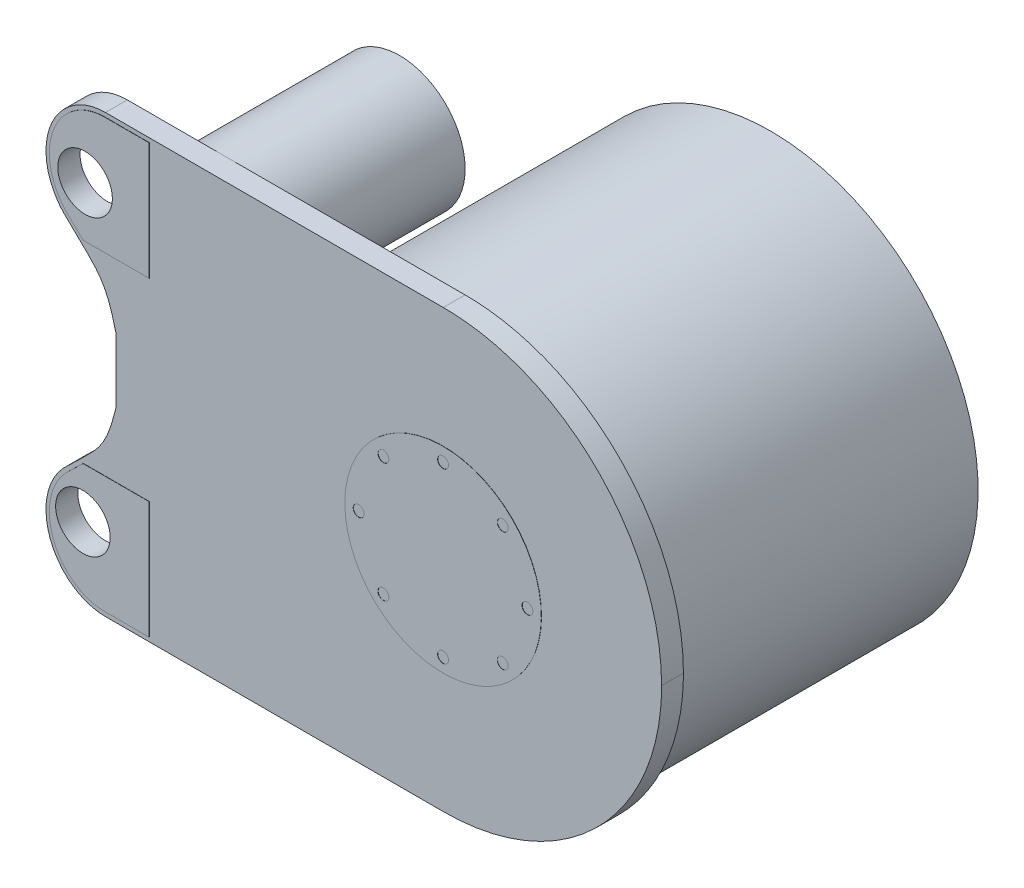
ISO-10303-21;
HEADER;
FILE_DESCRIPTION(('STEP AP214'),'2;1');
FILE_NAME('part.step','',(''),(''),'','','');
FILE_SCHEMA(('AUTOMOTIVE_DESIGN { 1 0 10303 214 1 1 1 1 }'));
ENDSEC;
DATA;
#1=APPLICATION_CONTEXT('core data for automotive mechanical design processes');
#2=APPLICATION_PROTOCOL_DEFINITION('international standard','automotive_design',2000,#1);
#3=PRODUCT_CONTEXT('',#1,'mechanical');
#4=PRODUCT('Part','Part','',(#3));
#5=PRODUCT_RELATED_PRODUCT_CATEGORY('part','',(#4));
#6=PRODUCT_DEFINITION_FORMATION('','',#4);
#7=PRODUCT_DEFINITION_CONTEXT('part definition',#1,'design');
#8=PRODUCT_DEFINITION('design','',#6,#7);
#9=PRODUCT_DEFINITION_SHAPE('','',#8);
#10=(LENGTH_UNIT() NAMED_UNIT(*) SI_UNIT(.MILLI.,.METRE.));
#11=(NAMED_UNIT(*) PLANE_ANGLE_UNIT() SI_UNIT($,.RADIAN.));
#12=(NAMED_UNIT(*) SI_UNIT($,.STERADIAN.) SOLID_ANGLE_UNIT());
#13=UNCERTAINTY_MEASURE_WITH_UNIT(LENGTH_MEASURE(1.E-05),#10,'distance_accuracy_value','');
#14=(GEOMETRIC_REPRESENTATION_CONTEXT(3) GLOBAL_UNCERTAINTY_ASSIGNED_CONTEXT((#13)) GLOBAL_UNIT_ASSIGNED_CONTEXT((#10,
#11,#12)) REPRESENTATION_CONTEXT('',''));
#15=CARTESIAN_POINT('',(0.,0.,0.));
#16=DIRECTION('',(0.,0.,1.));
#17=DIRECTION('',(1.,0.,0.));
#18=AXIS2_PLACEMENT_3D('',#15,#16,#17);
#19=CARTESIAN_POINT('',(-6.9,6.9997,-8.));
#20=DIRECTION('',(0.,0.,1.));
#21=DIRECTION('',(-1.,0.,0.));
#22=AXIS2_PLACEMENT_3D('',#19,#20,#21);
#23=ELLIPSE('',#22,2.25,2.25);
#24=DIRECTION('',(0.,0.,1.));
#25=VECTOR('',#24,1.);
#26=SURFACE_OF_LINEAR_EXTRUSION('',#23,#25);
#27=CARTESIAN_POINT('',(-9.15,6.9997,-8.));
#28=VERTEX_POINT('',#27);
#29=EDGE_CURVE('E682',#28,#28,#23,.T.);
#30=ORIENTED_EDGE('',*,*,#29,.F.);
#31=EDGE_LOOP('',(#30));
#32=FACE_BOUND('',#31,.T.);
#33=CARTESIAN_POINT('',(-6.9,6.9997,-6.5));
#34=DIRECTION('',(0.,0.,1.));
#35=DIRECTION('',(-1.,0.,0.));
#36=AXIS2_PLACEMENT_3D('',#33,#34,#35);
#37=ELLIPSE('',#36,2.25,2.25);
#38=CARTESIAN_POINT('',(-9.15,6.9997,-6.5));
#39=VERTEX_POINT('',#38);
#40=EDGE_CURVE('E1388',#39,#39,#37,.F.);
#41=ORIENTED_EDGE('',*,*,#40,.F.);
#42=EDGE_LOOP('',(#41));
#43=FACE_BOUND('',#42,.T.);
#44=ADVANCED_FACE('F48',(#32,#43),#26,.F.);
#45=CARTESIAN_POINT('',(4.1,-0.0004,-14.));
#46=DIRECTION('',(0.,0.,1.));
#47=DIRECTION('',(-1.,0.,0.));
#48=AXIS2_PLACEMENT_3D('',#45,#46,#47);
#49=ELLIPSE('',#48,8.5,8.5);
#50=DIRECTION('',(0.,0.,1.));
#51=VECTOR('',#50,1.);
#52=SURFACE_OF_LINEAR_EXTRUSION('',#49,#51);
#53=CARTESIAN_POINT('',(-4.4,-0.0004,-14.));
#54=VERTEX_POINT('',#53);
#55=EDGE_CURVE('E733',#54,#54,#49,.T.);
#56=ORIENTED_EDGE('',*,*,#55,.F.);
#57=EDGE_LOOP('',(#56));
#58=FACE_BOUND('',#57,.T.);
#59=CARTESIAN_POINT('',(4.1,-0.0004,-11.5));
#60=DIRECTION('',(0.,0.,1.));
#61=DIRECTION('',(-1.,0.,0.));
#62=AXIS2_PLACEMENT_3D('',#59,#60,#61);
#63=ELLIPSE('',#62,8.5,8.5);
#64=CARTESIAN_POINT('',(-4.4,-0.0004,-11.5));
#65=VERTEX_POINT('',#64);
#66=EDGE_CURVE('E1385',#65,#65,#63,.F.);
#67=ORIENTED_EDGE('',*,*,#66,.F.);
#68=EDGE_LOOP('',(#67));
#69=FACE_BOUND('',#68,.T.);
#70=ADVANCED_FACE('F714',(#58,#69),#52,.F.);
#71=CARTESIAN_POINT('',(11.17105,7.07077499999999,1.));
#72=DIRECTION('',(0.,0.,-1.));
#73=DIRECTION('',(-1.,0.,0.));
#74=AXIS2_PLACEMENT_3D('',#71,#72,#73);
#75=PLANE('',#74);
#76=CARTESIAN_POINT('',(-11.3935,9.8065,1.));
#77=CARTESIAN_POINT('',(-12.7975,9.8065,1.));
#78=CARTESIAN_POINT('',(-13.9358,8.601,1.));
#79=CARTESIAN_POINT('',(-13.9358,7.114,1.));
#80=B_SPLINE_CURVE_WITH_KNOTS('',3,(#76,#77,#78,#79),.UNSPECIFIED.,.F.,.F.,(4,4),(0.,0.1),.UNSPECIFIED.);
#81=CARTESIAN_POINT('',(-11.3935,9.8065,1.));
#82=VERTEX_POINT('',#81);
#83=CARTESIAN_POINT('',(-13.9358,7.114,1.));
#84=VERTEX_POINT('',#83);
#85=EDGE_CURVE('E1173',#82,#84,#80,.T.);
#86=ORIENTED_EDGE('',*,*,#85,.F.);
#87=DIRECTION('',(-1.,0.,0.));
#88=VECTOR('',#87,1.);
#89=CARTESIAN_POINT('',(-10.2039,9.8065,1.));
#90=LINE('',#89,#88);
#91=CARTESIAN_POINT('',(-9.3652,9.8065,1.));
#92=VERTEX_POINT('',#91);
#93=EDGE_CURVE('E1181',#92,#82,#90,.T.);
#94=ORIENTED_EDGE('',*,*,#93,.F.);
#95=DIRECTION('',(0.,1.,0.));
#96=VECTOR('',#95,1.);
#97=CARTESIAN_POINT('',(-9.3652,4.4299,1.));
#98=LINE('',#97,#96);
#99=CARTESIAN_POINT('',(-9.3652,4.4299,1.));
#100=VERTEX_POINT('',#99);
#101=EDGE_CURVE('E2586',#100,#92,#98,.T.);
#102=ORIENTED_EDGE('',*,*,#101,.F.);
#103=DIRECTION('',(1.,0.,0.));
#104=VECTOR('',#103,1.);
#105=CARTESIAN_POINT('',(-12.3882,4.4299,1.));
#106=LINE('',#105,#104);
#107=CARTESIAN_POINT('',(-12.3882,4.4299,1.));
#108=VERTEX_POINT('',#107);
#109=EDGE_CURVE('E2589',#108,#100,#106,.T.);
#110=ORIENTED_EDGE('',*,*,#109,.F.);
#111=CARTESIAN_POINT('',(-13.0995,5.1178,1.));
#112=CARTESIAN_POINT('',(-12.8243,4.8448,1.));
#113=CARTESIAN_POINT('',(-12.5903,4.624,1.));
#114=CARTESIAN_POINT('',(-12.3882,4.4299,1.));
#115=B_SPLINE_CURVE_WITH_KNOTS('',3,(#111,#112,#113,#114),.UNSPECIFIED.,.F.,.F.,(4,4),(0.4,0.5),.UNSPECIFIED.);
#116=CARTESIAN_POINT('',(-13.0995,5.1178,1.));
#117=VERTEX_POINT('',#116);
#118=EDGE_CURVE('E2592',#117,#108,#115,.T.);
#119=ORIENTED_EDGE('',*,*,#118,.F.);
#120=CARTESIAN_POINT('',(-13.2001,5.2199,1.));
#121=CARTESIAN_POINT('',(-13.1675,5.185,1.));
#122=CARTESIAN_POINT('',(-13.1339,5.1508,1.));
#123=CARTESIAN_POINT('',(-13.0995,5.1178,1.));
#124=B_SPLINE_CURVE_WITH_KNOTS('',3,(#120,#121,#122,#123),.UNSPECIFIED.,.F.,.F.,(4,4),(0.3,0.4),.UNSPECIFIED.);
#125=CARTESIAN_POINT('',(-13.2001,5.2199,1.));
#126=VERTEX_POINT('',#125);
#127=EDGE_CURVE('E2597',#126,#117,#124,.T.);
#128=ORIENTED_EDGE('',*,*,#127,.F.);
#129=CARTESIAN_POINT('',(-13.2112,5.2317,1.));
#130=CARTESIAN_POINT('',(-13.2077,5.2278,1.));
#131=CARTESIAN_POINT('',(-13.2038,5.2236,1.));
#132=CARTESIAN_POINT('',(-13.2001,5.2199,1.));
#133=B_SPLINE_CURVE_WITH_KNOTS('',3,(#129,#130,#131,#132),.UNSPECIFIED.,.F.,.F.,(4,4),(0.2,0.3),.UNSPECIFIED.);
#134=CARTESIAN_POINT('',(-13.2112,5.2317,1.));
#135=VERTEX_POINT('',#134);
#136=EDGE_CURVE('E2605',#135,#126,#133,.T.);
#137=ORIENTED_EDGE('',*,*,#136,.F.);
#138=CARTESIAN_POINT('',(-13.9358,7.114,1.));
#139=CARTESIAN_POINT('',(-13.9358,6.3813,1.));
#140=CARTESIAN_POINT('',(-13.6594,5.717,1.));
#141=CARTESIAN_POINT('',(-13.2112,5.2317,1.));
#142=B_SPLINE_CURVE_WITH_KNOTS('',3,(#138,#139,#140,#141),.UNSPECIFIED.,.F.,.F.,(4,4),(0.1,0.2),.UNSPECIFIED.);
#143=EDGE_CURVE('E2613',#84,#135,#142,.T.);
#144=ORIENTED_EDGE('',*,*,#143,.F.);
#145=EDGE_LOOP('',(#86,#94,#102,#110,#119,#128,#137,#144));
#146=FACE_BOUND('',#145,.T.);
#147=CARTESIAN_POINT('',(14.1,0.,1.));
#148=CARTESIAN_POINT('',(14.1,5.5226,1.));
#149=CARTESIAN_POINT('',(9.6228,9.9996,1.));
#150=CARTESIAN_POINT('',(4.1,9.9996,1.));
#151=B_SPLINE_CURVE_WITH_KNOTS('',3,(#147,#148,#149,#150),.UNSPECIFIED.,.F.,.F.,(4,4),(0.8,
0.85),.UNSPECIFIED.);
#152=CARTESIAN_POINT('',(14.1,0.,1.));
#153=VERTEX_POINT('',#152);
#154=CARTESIAN_POINT('',(4.1,9.9996,1.));
#155=VERTEX_POINT('',#154);
#156=EDGE_CURVE('E1325',#153,#155,#151,.T.);
#157=ORIENTED_EDGE('',*,*,#156,.T.);
#158=DIRECTION('',(-1.,0.,0.));
#159=VECTOR('',#158,1.);
#160=CARTESIAN_POINT('',(4.1,9.9996,1.));
#161=LINE('',#160,#159);
#162=CARTESIAN_POINT('',(-11.375,9.9996,1.));
#163=VERTEX_POINT('',#162);
#164=EDGE_CURVE('E2466',#155,#163,#161,.T.);
#165=ORIENTED_EDGE('',*,*,#164,.T.);
#166=CARTESIAN_POINT('',(-11.375,9.9996,1.));
#167=CARTESIAN_POINT('',(-12.8799,9.9996,1.));
#168=CARTESIAN_POINT('',(-14.1,8.7075,1.));
#169=CARTESIAN_POINT('',(-14.1,7.1137,1.));
#170=B_SPLINE_CURVE_WITH_KNOTS('',3,(#166,#167,#168,#169),.UNSPECIFIED.,.F.,.F.,(4,4),(0.,0.05),.UNSPECIFIED.);
#171=CARTESIAN_POINT('',(-14.1,7.1137,1.));
#172=VERTEX_POINT('',#171);
#173=EDGE_CURVE('E2462',#163,#172,#170,.T.);
#174=ORIENTED_EDGE('',*,*,#173,.T.);
#175=CARTESIAN_POINT('',(-14.1,7.1137,1.));
#176=CARTESIAN_POINT('',(-14.1,6.3284,1.));
#177=CARTESIAN_POINT('',(-13.8037,5.6164,1.));
#178=CARTESIAN_POINT('',(-13.3233,5.0962,1.));
#179=B_SPLINE_CURVE_WITH_KNOTS('',3,(#175,#176,#177,#178),.UNSPECIFIED.,.F.,.F.,(4,4),(0.05,
0.1),.UNSPECIFIED.);
#180=CARTESIAN_POINT('',(-13.3233,5.0962,1.));
#181=VERTEX_POINT('',#180);
#182=EDGE_CURVE('E2458',#172,#181,#179,.T.);
#183=ORIENTED_EDGE('',*,*,#182,.T.);
#184=CARTESIAN_POINT('',(-13.3233,5.0962,1.));
#185=CARTESIAN_POINT('',(-13.3196,5.092,1.));
#186=CARTESIAN_POINT('',(-13.3154,5.0875,1.));
#187=CARTESIAN_POINT('',(-13.3114,5.0835,1.));
#188=B_SPLINE_CURVE_WITH_KNOTS('',3,(#184,#185,#186,#187),.UNSPECIFIED.,.F.,.F.,(4,4),(0.1,
0.15),.UNSPECIFIED.);
#189=CARTESIAN_POINT('',(-13.3114,5.0835,1.));
#190=VERTEX_POINT('',#189);
#191=EDGE_CURVE('E2461',#181,#190,#188,.T.);
#192=ORIENTED_EDGE('',*,*,#191,.T.);
#193=CARTESIAN_POINT('',(-13.3114,5.0835,1.));
#194=CARTESIAN_POINT('',(-13.2765,5.0461,1.));
#195=CARTESIAN_POINT('',(-13.2405,5.0095,1.));
#196=CARTESIAN_POINT('',(-13.2036,4.9741,1.));
#197=B_SPLINE_CURVE_WITH_KNOTS('',3,(#193,#194,#195,#196),.UNSPECIFIED.,.F.,.F.,(4,4),(0.15,
0.2),.UNSPECIFIED.);
#198=CARTESIAN_POINT('',(-13.2036,4.9741,1.));
#199=VERTEX_POINT('',#198);
#200=EDGE_CURVE('E2464',#190,#199,#197,.T.);
#201=ORIENTED_EDGE('',*,*,#200,.T.);
#202=CARTESIAN_POINT('',(-13.2036,4.9741,1.));
#203=CARTESIAN_POINT('',(-11.7596,3.5417,1.));
#204=CARTESIAN_POINT('',(-11.3715,3.4497,1.));
#205=CARTESIAN_POINT('',(-10.9,1.5,1.));
#206=B_SPLINE_CURVE_WITH_KNOTS('',3,(#202,#203,#204,#205),.UNSPECIFIED.,.F.,.F.,(4,4),(0.2,
0.25),.UNSPECIFIED.);
#207=CARTESIAN_POINT('',(-10.9,1.5,1.));
#208=VERTEX_POINT('',#207);
#209=EDGE_CURVE('E2486',#199,#208,#206,.T.);
#210=ORIENTED_EDGE('',*,*,#209,.T.);
#211=DIRECTION('',(0.,-1.,0.));
#212=VECTOR('',#211,1.);
#213=CARTESIAN_POINT('',(-10.9,1.5,1.));
#214=LINE('',#213,#212);
#215=CARTESIAN_POINT('',(-10.9,1.4998,1.));
#216=VERTEX_POINT('',#215);
#217=EDGE_CURVE('E2494',#208,#216,#214,.T.);
#218=ORIENTED_EDGE('',*,*,#217,.T.);
#219=CARTESIAN_POINT('',(-10.9,1.4998,1.));
#220=CARTESIAN_POINT('',(-10.9,0.5,1.));
#221=CARTESIAN_POINT('',(-10.9,-0.5,1.));
#222=CARTESIAN_POINT('',(-10.9,-1.4998,1.));
#223=B_SPLINE_CURVE_WITH_KNOTS('',3,(#219,#220,#221,#222),.UNSPECIFIED.,.F.,.F.,(4,4),(0.3,
0.35),.UNSPECIFIED.);
#224=CARTESIAN_POINT('',(-10.9,-1.4998,1.));
#225=VERTEX_POINT('',#224);
#226=EDGE_CURVE('E2499',#216,#225,#223,.T.);
#227=ORIENTED_EDGE('',*,*,#226,.T.);
#228=DIRECTION('',(0.,-1.,0.));
#229=VECTOR('',#228,1.);
#230=CARTESIAN_POINT('',(-10.9,-1.4998,1.));
#231=LINE('',#230,#229);
#232=CARTESIAN_POINT('',(-10.9,-1.5,1.));
#233=VERTEX_POINT('',#232);
#234=EDGE_CURVE('E2503',#225,#233,#231,.T.);
#235=ORIENTED_EDGE('',*,*,#234,.T.);
#236=CARTESIAN_POINT('',(-10.9,-1.5,1.));
#237=CARTESIAN_POINT('',(-11.3712,-3.4492,1.));
#238=CARTESIAN_POINT('',(-11.761,-3.5431,1.));
#239=CARTESIAN_POINT('',(-13.2036,-4.9741,1.));
#240=B_SPLINE_CURVE_WITH_KNOTS('',3,(#236,#237,#238,#239),.UNSPECIFIED.,.F.,.F.,(4,4),(0.4,
0.45),.UNSPECIFIED.);
#241=CARTESIAN_POINT('',(-13.2036,-4.9741,1.));
#242=VERTEX_POINT('',#241);
#243=EDGE_CURVE('E2508',#233,#242,#240,.T.);
#244=ORIENTED_EDGE('',*,*,#243,.T.);
#245=CARTESIAN_POINT('',(-13.2036,-4.9741,1.));
#246=CARTESIAN_POINT('',(-13.2369,-5.006,1.));
#247=CARTESIAN_POINT('',(-13.2695,-5.0389,1.));
#248=CARTESIAN_POINT('',(-13.3011,-5.0725,1.));
#249=B_SPLINE_CURVE_WITH_KNOTS('',3,(#245,#246,#247,#248),.UNSPECIFIED.,.F.,.F.,(4,4),(0.45,
0.5),.UNSPECIFIED.);
#250=CARTESIAN_POINT('',(-13.3011,-5.0725,1.));
#251=VERTEX_POINT('',#250);
#252=EDGE_CURVE('E2513',#242,#251,#249,.T.);
#253=ORIENTED_EDGE('',*,*,#252,.T.);
#254=CARTESIAN_POINT('',(-13.3011,-5.0725,1.));
#255=CARTESIAN_POINT('',(-13.3105,-5.0824,1.));
#256=CARTESIAN_POINT('',(-13.3196,-5.0921,1.));
#257=CARTESIAN_POINT('',(-13.3287,-5.1021,1.));
#258=B_SPLINE_CURVE_WITH_KNOTS('',3,(#254,#255,#256,#257),.UNSPECIFIED.,.F.,.F.,(4,4),(0.5,
0.55),.UNSPECIFIED.);
#259=CARTESIAN_POINT('',(-13.3287,-5.1021,1.));
#260=VERTEX_POINT('',#259);
#261=EDGE_CURVE('E2522',#251,#260,#258,.T.);
#262=ORIENTED_EDGE('',*,*,#261,.T.);
#263=CARTESIAN_POINT('',(-13.3287,-5.1021,1.));
#264=CARTESIAN_POINT('',(-13.8059,-5.6217,1.));
#265=CARTESIAN_POINT('',(-14.1,-6.3313,1.));
#266=CARTESIAN_POINT('',(-14.1,-7.1137,1.));
#267=B_SPLINE_CURVE_WITH_KNOTS('',3,(#263,#264,#265,#266),.UNSPECIFIED.,.F.,.F.,(4,4),(0.55,
0.6),.UNSPECIFIED.);
#268=CARTESIAN_POINT('',(-14.1,-7.1137,1.));
#269=VERTEX_POINT('',#268);
#270=EDGE_CURVE('E2526',#260,#269,#267,.T.);
#271=ORIENTED_EDGE('',*,*,#270,.T.);
#272=CARTESIAN_POINT('',(-14.1,-7.1137,1.));
#273=CARTESIAN_POINT('',(-14.1,-8.7075,1.));
#274=CARTESIAN_POINT('',(-12.8799,-9.9996,1.));
#275=CARTESIAN_POINT('',(-11.375,-9.9996,1.));
#276=B_SPLINE_CURVE_WITH_KNOTS('',3,(#272,#273,#274,#275),.UNSPECIFIED.,.F.,.F.,(4,4),(0.6,
0.65),.UNSPECIFIED.);
#277=CARTESIAN_POINT('',(-11.375,-9.9996,1.));
#278=VERTEX_POINT('',#277);
#279=EDGE_CURVE('E2533',#269,#278,#276,.T.);
#280=ORIENTED_EDGE('',*,*,#279,.T.);
#281=DIRECTION('',(1.,0.,0.));
#282=VECTOR('',#281,1.);
#283=CARTESIAN_POINT('',(-11.375,-9.9996,1.));
#284=LINE('',#283,#282);
#285=CARTESIAN_POINT('',(4.1,-9.9996,1.));
#286=VERTEX_POINT('',#285);
#287=EDGE_CURVE('E1219',#278,#286,#284,.T.);
#288=ORIENTED_EDGE('',*,*,#287,.T.);
#289=CARTESIAN_POINT('',(4.1,-9.9996,1.));
#290=CARTESIAN_POINT('',(9.6228,-9.9996,1.));
#291=CARTESIAN_POINT('',(14.1,-5.5226,1.));
#292=CARTESIAN_POINT('',(14.1,0.,1.));
#293=B_SPLINE_CURVE_WITH_KNOTS('',3,(#289,#290,#291,#292),.UNSPECIFIED.,.F.,.F.,(4,4),(0.75,
0.8),.UNSPECIFIED.);
#294=EDGE_CURVE('E1212',#286,#153,#293,.T.);
#295=ORIENTED_EDGE('',*,*,#294,.T.);
#296=EDGE_LOOP('',(#157,#165,#174,#183,#192,#201,#210,#218,#227,#235,#244,#253,#262,#271,#280,
#288,#295));
#297=FACE_BOUND('',#296,.T.);
#298=CARTESIAN_POINT('',(-13.9358,-7.114,1.));
#299=CARTESIAN_POINT('',(-13.9358,-8.601,1.));
#300=CARTESIAN_POINT('',(-12.7975,-9.8065,1.));
#301=CARTESIAN_POINT('',(-11.3935,-9.8065,1.));
#302=B_SPLINE_CURVE_WITH_KNOTS('',3,(#298,#299,#300,#301),.UNSPECIFIED.,.F.,.F.,(4,4),(0.,0.1),.UNSPECIFIED.);
#303=CARTESIAN_POINT('',(-13.9358,-7.114,1.));
#304=VERTEX_POINT('',#303);
#305=CARTESIAN_POINT('',(-11.3935,-9.8065,1.));
#306=VERTEX_POINT('',#305);
#307=EDGE_CURVE('E1067',#304,#306,#302,.T.);
#308=ORIENTED_EDGE('',*,*,#307,.F.);
#309=CARTESIAN_POINT('',(-13.2112,-5.2317,1.));
#310=CARTESIAN_POINT('',(-13.6594,-5.717,1.));
#311=CARTESIAN_POINT('',(-13.9358,-6.3813,1.));
#312=CARTESIAN_POINT('',(-13.9358,-7.114,1.));
#313=B_SPLINE_CURVE_WITH_KNOTS('',3,(#309,#310,#311,#312),.UNSPECIFIED.,.F.,.F.,(4,4),(0.1,0.2),.UNSPECIFIED.);
#314=CARTESIAN_POINT('',(-13.2112,-5.2317,1.));
#315=VERTEX_POINT('',#314);
#316=EDGE_CURVE('E1139',#315,#304,#313,.T.);
#317=ORIENTED_EDGE('',*,*,#316,.F.);
#318=CARTESIAN_POINT('',(-13.2001,-5.2199,1.));
#319=CARTESIAN_POINT('',(-13.2038,-5.2236,1.));
#320=CARTESIAN_POINT('',(-13.2077,-5.2278,1.));
#321=CARTESIAN_POINT('',(-13.2112,-5.2317,1.));
#322=B_SPLINE_CURVE_WITH_KNOTS('',3,(#318,#319,#320,#321),.UNSPECIFIED.,.F.,.F.,(4,4),(0.2,0.3),.UNSPECIFIED.);
#323=CARTESIAN_POINT('',(-13.2001,-5.2199,1.));
#324=VERTEX_POINT('',#323);
#325=EDGE_CURVE('E1131',#324,#315,#322,.T.);
#326=ORIENTED_EDGE('',*,*,#325,.F.);
#327=CARTESIAN_POINT('',(-13.0995,-5.1178,1.));
#328=CARTESIAN_POINT('',(-13.1339,-5.1508,1.));
#329=CARTESIAN_POINT('',(-13.1675,-5.185,1.));
#330=CARTESIAN_POINT('',(-13.2001,-5.2199,1.));
#331=B_SPLINE_CURVE_WITH_KNOTS('',3,(#327,#328,#329,#330),.UNSPECIFIED.,.F.,.F.,(4,4),(0.3,0.4),.UNSPECIFIED.);
#332=CARTESIAN_POINT('',(-13.0995,-5.1178,1.));
#333=VERTEX_POINT('',#332);
#334=EDGE_CURVE('E1123',#333,#324,#331,.T.);
#335=ORIENTED_EDGE('',*,*,#334,.F.);
#336=CARTESIAN_POINT('',(-12.3882,-4.4299,1.));
#337=CARTESIAN_POINT('',(-12.5903,-4.624,1.));
#338=CARTESIAN_POINT('',(-12.8243,-4.8448,1.));
#339=CARTESIAN_POINT('',(-13.0995,-5.1178,1.));
#340=B_SPLINE_CURVE_WITH_KNOTS('',3,(#336,#337,#338,#339),.UNSPECIFIED.,.F.,.F.,(4,4),(0.4,0.5),.UNSPECIFIED.);
#341=CARTESIAN_POINT('',(-12.3882,-4.4299,1.));
#342=VERTEX_POINT('',#341);
#343=EDGE_CURVE('E1118',#342,#333,#340,.T.);
#344=ORIENTED_EDGE('',*,*,#343,.F.);
#345=DIRECTION('',(-1.,0.,0.));
#346=VECTOR('',#345,1.);
#347=CARTESIAN_POINT('',(-12.3882,-4.4299,1.));
#348=LINE('',#347,#346);
#349=CARTESIAN_POINT('',(-9.3652,-4.4299,1.));
#350=VERTEX_POINT('',#349);
#351=EDGE_CURVE('E1115',#350,#342,#348,.T.);
#352=ORIENTED_EDGE('',*,*,#351,.F.);
#353=DIRECTION('',(0.,1.,0.));
#354=VECTOR('',#353,1.);
#355=CARTESIAN_POINT('',(-9.3652,-4.4299,1.));
#356=LINE('',#355,#354);
#357=CARTESIAN_POINT('',(-9.3652,-9.8065,1.));
#358=VERTEX_POINT('',#357);
#359=EDGE_CURVE('E1112',#358,#350,#356,.T.);
#360=ORIENTED_EDGE('',*,*,#359,.F.);
#361=DIRECTION('',(1.,0.,0.));
#362=VECTOR('',#361,1.);
#363=CARTESIAN_POINT('',(-9.3652,-9.8065,1.));
#364=LINE('',#363,#362);
#365=EDGE_CURVE('E1106',#306,#358,#364,.T.);
#366=ORIENTED_EDGE('',*,*,#365,.F.);
#367=EDGE_LOOP('',(#308,#317,#326,#335,#344,#352,#360,#366));
#368=FACE_BOUND('',#367,.T.);
#369=CARTESIAN_POINT('',(4.1,-0.0004,1.));
#370=DIRECTION('',(0.,0.,1.));
#371=DIRECTION('',(-1.,0.,0.));
#372=AXIS2_PLACEMENT_3D('',#369,#370,#371);
#373=ELLIPSE('',#372,4.5,4.5);
#374=CARTESIAN_POINT('',(-0.400000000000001,-0.0004,1.));
#375=VERTEX_POINT('',#374);
#376=EDGE_CURVE('E1373',#375,#375,#373,.T.);
#377=ORIENTED_EDGE('',*,*,#376,.F.);
#378=EDGE_LOOP('',(#377));
#379=FACE_BOUND('',#378,.T.);
#380=ADVANCED_FACE('F730',(#146,#297,#368,#379),#75,.F.);
#381=DIRECTION('',(0.,0.,-1.));
#382=VECTOR('',#381,1.);
#383=SURFACE_OF_LINEAR_EXTRUSION('',#151,#382);
#384=CARTESIAN_POINT('',(14.1,0.,0.));
#385=CARTESIAN_POINT('',(14.1,5.5226,0.));
#386=CARTESIAN_POINT('',(9.6228,9.9996,0.));
#387=CARTESIAN_POINT('',(4.1,9.9996,0.));
#388=B_SPLINE_CURVE_WITH_KNOTS('',3,(#384,#385,#386,#387),.UNSPECIFIED.,.F.,.F.,(4,4),(0.8,
0.85),.UNSPECIFIED.);
#389=CARTESIAN_POINT('',(14.1,0.,0.));
#390=VERTEX_POINT('',#389);
#391=CARTESIAN_POINT('',(4.1,9.9996,0.));
#392=VERTEX_POINT('',#391);
#393=EDGE_CURVE('E1221',#390,#392,#388,.T.);
#394=ORIENTED_EDGE('',*,*,#393,.T.);
#395=DIRECTION('',(0.,0.,-1.));
#396=VECTOR('',#395,1.);
#397=CARTESIAN_POINT('',(4.1,9.9996,1.));
#398=LINE('',#397,#396);
#399=EDGE_CURVE('E1370',#155,#392,#398,.T.);
#400=ORIENTED_EDGE('',*,*,#399,.F.);
#401=ORIENTED_EDGE('',*,*,#156,.F.);
#402=DIRECTION('',(0.,0.,-1.));
#403=VECTOR('',#402,1.);
#404=CARTESIAN_POINT('',(14.1,0.,1.));
#405=LINE('',#404,#403);
#406=EDGE_CURVE('E1218',#153,#390,#405,.T.);
#407=ORIENTED_EDGE('',*,*,#406,.T.);
#408=EDGE_LOOP('',(#394,#400,#401,#407));
#409=FACE_BOUND('',#408,.T.);
#410=ADVANCED_FACE('F50',(#409),#383,.F.);
#411=CARTESIAN_POINT('',(-10.1,9.9996,1.));
#412=DIRECTION('',(0.,-1.,0.));
#413=DIRECTION('',(0.,0.,-1.));
#414=AXIS2_PLACEMENT_3D('',#411,#412,#413);
#415=PLANE('',#414);
#416=DIRECTION('',(-1.,0.,0.));
#417=VECTOR('',#416,1.);
#418=CARTESIAN_POINT('',(-10.1,9.9996,0.));
#419=LINE('',#418,#417);
#420=CARTESIAN_POINT('',(-6.9,9.9996,0.));
#421=VERTEX_POINT('',#420);
#422=EDGE_CURVE('E1231',#392,#421,#419,.T.);
#423=ORIENTED_EDGE('',*,*,#422,.T.);
#424=CARTESIAN_POINT('',(-11.375,9.9996,0.));
#425=VERTEX_POINT('',#424);
#426=EDGE_CURVE('E1229',#421,#425,#419,.T.);
#427=ORIENTED_EDGE('',*,*,#426,.T.);
#428=DIRECTION('',(0.,0.,-1.));
#429=VECTOR('',#428,1.);
#430=CARTESIAN_POINT('',(-11.375,9.9996,1.));
#431=LINE('',#430,#429);
#432=EDGE_CURVE('E1367',#163,#425,#431,.T.);
#433=ORIENTED_EDGE('',*,*,#432,.F.);
#434=ORIENTED_EDGE('',*,*,#164,.F.);
#435=ORIENTED_EDGE('',*,*,#399,.T.);
#436=EDGE_LOOP('',(#423,#427,#433,#434,#435));
#437=FACE_BOUND('',#436,.T.);
#438=ADVANCED_FACE('F2008',(#437),#415,.F.);
#439=DIRECTION('',(0.,0.,-1.));
#440=VECTOR('',#439,1.);
#441=SURFACE_OF_LINEAR_EXTRUSION('',#170,#440);
#442=CARTESIAN_POINT('',(-11.375,9.9996,0.));
#443=CARTESIAN_POINT('',(-12.8799,9.9996,0.));
#444=CARTESIAN_POINT('',(-14.1,8.7075,0.));
#445=CARTESIAN_POINT('',(-14.1,7.1137,0.));
#446=B_SPLINE_CURVE_WITH_KNOTS('',3,(#442,#443,#444,#445),.UNSPECIFIED.,.F.,.F.,(4,4),(0.,0.05),.UNSPECIFIED.);
#447=CARTESIAN_POINT('',(-14.1,7.1137,0.));
#448=VERTEX_POINT('',#447);
#449=EDGE_CURVE('E1237',#425,#448,#446,.T.);
#450=ORIENTED_EDGE('',*,*,#449,.T.);
#451=DIRECTION('',(0.,0.,-1.));
#452=VECTOR('',#451,1.);
#453=CARTESIAN_POINT('',(-14.1,7.1137,1.));
#454=LINE('',#453,#452);
#455=EDGE_CURVE('E1364',#172,#448,#454,.T.);
#456=ORIENTED_EDGE('',*,*,#455,.F.);
#457=ORIENTED_EDGE('',*,*,#173,.F.);
#458=ORIENTED_EDGE('',*,*,#432,.T.);
#459=EDGE_LOOP('',(#450,#456,#457,#458));
#460=FACE_BOUND('',#459,.T.);
#461=ADVANCED_FACE('F2000',(#460),#441,.F.);
#462=DIRECTION('',(0.,0.,-1.));
#463=VECTOR('',#462,1.);
#464=SURFACE_OF_LINEAR_EXTRUSION('',#179,#463);
#465=CARTESIAN_POINT('',(-14.1,7.1137,0.));
#466=CARTESIAN_POINT('',(-14.1,6.3284,0.));
#467=CARTESIAN_POINT('',(-13.8037,5.6164,0.));
#468=CARTESIAN_POINT('',(-13.3233,5.0962,0.));
#469=B_SPLINE_CURVE_WITH_KNOTS('',3,(#465,#466,#467,#468),.UNSPECIFIED.,.F.,.F.,(4,4),(0.05,
0.1),.UNSPECIFIED.);
#470=CARTESIAN_POINT('',(-13.3233,5.0962,0.));
#471=VERTEX_POINT('',#470);
#472=EDGE_CURVE('E1241',#448,#471,#469,.T.);
#473=ORIENTED_EDGE('',*,*,#472,.T.);
#474=DIRECTION('',(0.,0.,-1.));
#475=VECTOR('',#474,1.);
#476=CARTESIAN_POINT('',(-13.3233,5.0962,1.));
#477=LINE('',#476,#475);
#478=EDGE_CURVE('E1361',#181,#471,#477,.T.);
#479=ORIENTED_EDGE('',*,*,#478,.F.);
#480=ORIENTED_EDGE('',*,*,#182,.F.);
#481=ORIENTED_EDGE('',*,*,#455,.T.);
#482=EDGE_LOOP('',(#473,#479,#480,#481));
#483=FACE_BOUND('',#482,.T.);
#484=ADVANCED_FACE('F1992',(#483),#464,.F.);
#485=DIRECTION('',(0.,0.,-1.));
#486=VECTOR('',#485,1.);
#487=SURFACE_OF_LINEAR_EXTRUSION('',#188,#486);
#488=CARTESIAN_POINT('',(-13.3233,5.0962,0.));
#489=CARTESIAN_POINT('',(-13.3196,5.092,0.));
#490=CARTESIAN_POINT('',(-13.3154,5.0875,0.));
#491=CARTESIAN_POINT('',(-13.3114,5.0835,0.));
#492=B_SPLINE_CURVE_WITH_KNOTS('',3,(#488,#489,#490,#491),.UNSPECIFIED.,.F.,.F.,(4,4),(0.1,
0.15),.UNSPECIFIED.);
#493=CARTESIAN_POINT('',(-13.3114,5.0835,0.));
#494=VERTEX_POINT('',#493);
#495=EDGE_CURVE('E1248',#471,#494,#492,.T.);
#496=ORIENTED_EDGE('',*,*,#495,.T.);
#497=DIRECTION('',(0.,0.,-1.));
#498=VECTOR('',#497,1.);
#499=CARTESIAN_POINT('',(-13.3114,5.0835,1.));
#500=LINE('',#499,#498);
#501=EDGE_CURVE('E1358',#190,#494,#500,.T.);
#502=ORIENTED_EDGE('',*,*,#501,.F.);
#503=ORIENTED_EDGE('',*,*,#191,.F.);
#504=ORIENTED_EDGE('',*,*,#478,.T.);
#505=EDGE_LOOP('',(#496,#502,#503,#504));
#506=FACE_BOUND('',#505,.T.);
#507=ADVANCED_FACE('F1984',(#506),#487,.F.);
#508=DIRECTION('',(0.,0.,-1.));
#509=VECTOR('',#508,1.);
#510=SURFACE_OF_LINEAR_EXTRUSION('',#197,#509);
#511=CARTESIAN_POINT('',(-13.3114,5.0835,0.));
#512=CARTESIAN_POINT('',(-13.2765,5.0461,0.));
#513=CARTESIAN_POINT('',(-13.2405,5.0095,0.));
#514=CARTESIAN_POINT('',(-13.2036,4.9741,0.));
#515=B_SPLINE_CURVE_WITH_KNOTS('',3,(#511,#512,#513,#514),.UNSPECIFIED.,.F.,.F.,(4,4),(0.15,
0.2),.UNSPECIFIED.);
#516=CARTESIAN_POINT('',(-13.2036,4.9741,0.));
#517=VERTEX_POINT('',#516);
#518=EDGE_CURVE('E1255',#494,#517,#515,.T.);
#519=ORIENTED_EDGE('',*,*,#518,.T.);
#520=DIRECTION('',(0.,0.,-1.));
#521=VECTOR('',#520,1.);
#522=CARTESIAN_POINT('',(-13.2036,4.9741,1.));
#523=LINE('',#522,#521);
#524=EDGE_CURVE('E1355',#199,#517,#523,.T.);
#525=ORIENTED_EDGE('',*,*,#524,.F.);
#526=ORIENTED_EDGE('',*,*,#200,.F.);
#527=ORIENTED_EDGE('',*,*,#501,.T.);
#528=EDGE_LOOP('',(#519,#525,#526,#527));
#529=FACE_BOUND('',#528,.T.);
#530=ADVANCED_FACE('F1976',(#529),#510,.F.);
#531=DIRECTION('',(0.,0.,-1.));
#532=VECTOR('',#531,1.);
#533=SURFACE_OF_LINEAR_EXTRUSION('',#206,#532);
#534=CARTESIAN_POINT('',(-13.2036,4.9741,0.));
#535=CARTESIAN_POINT('',(-11.7596,3.5417,0.));
#536=CARTESIAN_POINT('',(-11.3715,3.4497,0.));
#537=CARTESIAN_POINT('',(-10.9,1.5,0.));
#538=B_SPLINE_CURVE_WITH_KNOTS('',3,(#534,#535,#536,#537),.UNSPECIFIED.,.F.,.F.,(4,4),(0.2,
0.25),.UNSPECIFIED.);
#539=CARTESIAN_POINT('',(-10.9,1.5,0.));
#540=VERTEX_POINT('',#539);
#541=EDGE_CURVE('E1262',#517,#540,#538,.T.);
#542=ORIENTED_EDGE('',*,*,#541,.T.);
#543=DIRECTION('',(0.,0.,-1.));
#544=VECTOR('',#543,1.);
#545=CARTESIAN_POINT('',(-10.9,1.5,1.));
#546=LINE('',#545,#544);
#547=EDGE_CURVE('E1352',#208,#540,#546,.T.);
#548=ORIENTED_EDGE('',*,*,#547,.F.);
#549=ORIENTED_EDGE('',*,*,#209,.F.);
#550=ORIENTED_EDGE('',*,*,#524,.T.);
#551=EDGE_LOOP('',(#542,#548,#549,#550));
#552=FACE_BOUND('',#551,.T.);
#553=ADVANCED_FACE('F1968',(#552),#533,.F.);
#554=CARTESIAN_POINT('',(-10.9,-1.4998,1.));
#555=DIRECTION('',(1.,0.,0.));
#556=DIRECTION('',(0.,0.,-1.));
#557=AXIS2_PLACEMENT_3D('',#554,#555,#556);
#558=PLANE('',#557);
#559=DIRECTION('',(0.,-1.,0.));
#560=VECTOR('',#559,1.);
#561=CARTESIAN_POINT('',(-10.9,-1.4998,0.));
#562=LINE('',#561,#560);
#563=CARTESIAN_POINT('',(-10.9,-1.4998,0.));
#564=VERTEX_POINT('',#563);
#565=CARTESIAN_POINT('',(-10.9,-1.5,0.));
#566=VERTEX_POINT('',#565);
#567=EDGE_CURVE('E1278',#564,#566,#562,.T.);
#568=ORIENTED_EDGE('',*,*,#567,.T.);
#569=DIRECTION('',(0.,0.,-1.));
#570=VECTOR('',#569,1.);
#571=CARTESIAN_POINT('',(-10.9,-1.5,1.));
#572=LINE('',#571,#570);
#573=EDGE_CURVE('E1349',#233,#566,#572,.T.);
#574=ORIENTED_EDGE('',*,*,#573,.F.);
#575=ORIENTED_EDGE('',*,*,#234,.F.);
#576=ORIENTED_EDGE('',*,*,#226,.F.);
#577=ORIENTED_EDGE('',*,*,#217,.F.);
#578=ORIENTED_EDGE('',*,*,#547,.T.);
#579=DIRECTION('',(0.,-1.,0.));
#580=VECTOR('',#579,1.);
#581=CARTESIAN_POINT('',(-10.9,1.5,0.));
#582=LINE('',#581,#580);
#583=CARTESIAN_POINT('',(-10.9,1.4998,0.));
#584=VERTEX_POINT('',#583);
#585=EDGE_CURVE('E1269',#540,#584,#582,.T.);
#586=ORIENTED_EDGE('',*,*,#585,.T.);
#587=CARTESIAN_POINT('',(-10.9,1.4998,0.));
#588=CARTESIAN_POINT('',(-10.9,0.5,0.));
#589=CARTESIAN_POINT('',(-10.9,-0.5,0.));
#590=CARTESIAN_POINT('',(-10.9,-1.4998,0.));
#591=B_SPLINE_CURVE_WITH_KNOTS('',3,(#587,#588,#589,#590),.UNSPECIFIED.,.F.,.F.,(4,4),(0.3,
0.35),.UNSPECIFIED.);
#592=EDGE_CURVE('E1274',#584,#564,#591,.T.);
#593=ORIENTED_EDGE('',*,*,#592,.T.);
#594=EDGE_LOOP('',(#568,#574,#575,#576,#577,#578,#586,#593));
#595=FACE_BOUND('',#594,.T.);
#596=ADVANCED_FACE('F1960',(#595),#558,.F.);
#597=DIRECTION('',(0.,0.,-1.));
#598=VECTOR('',#597,1.);
#599=SURFACE_OF_LINEAR_EXTRUSION('',#240,#598);
#600=CARTESIAN_POINT('',(-10.9,-1.5,0.));
#601=CARTESIAN_POINT('',(-11.3712,-3.4492,0.));
#602=CARTESIAN_POINT('',(-11.761,-3.5431,0.));
#603=CARTESIAN_POINT('',(-13.2036,-4.9741,0.));
#604=B_SPLINE_CURVE_WITH_KNOTS('',3,(#600,#601,#602,#603),.UNSPECIFIED.,.F.,.F.,(4,4),(0.4,
0.45),.UNSPECIFIED.);
#605=CARTESIAN_POINT('',(-13.2036,-4.9741,0.));
#606=VERTEX_POINT('',#605);
#607=EDGE_CURVE('E1283',#566,#606,#604,.T.);
#608=ORIENTED_EDGE('',*,*,#607,.T.);
#609=DIRECTION('',(0.,0.,-1.));
#610=VECTOR('',#609,1.);
#611=CARTESIAN_POINT('',(-13.2036,-4.9741,1.));
#612=LINE('',#611,#610);
#613=EDGE_CURVE('E1346',#242,#606,#612,.T.);
#614=ORIENTED_EDGE('',*,*,#613,.F.);
#615=ORIENTED_EDGE('',*,*,#243,.F.);
#616=ORIENTED_EDGE('',*,*,#573,.T.);
#617=EDGE_LOOP('',(#608,#614,#615,#616));
#618=FACE_BOUND('',#617,.T.);
#619=ADVANCED_FACE('F1952',(#618),#599,.F.);
#620=DIRECTION('',(0.,0.,-1.));
#621=VECTOR('',#620,1.);
#622=SURFACE_OF_LINEAR_EXTRUSION('',#249,#621);
#623=CARTESIAN_POINT('',(-13.2036,-4.9741,0.));
#624=CARTESIAN_POINT('',(-13.2369,-5.006,0.));
#625=CARTESIAN_POINT('',(-13.2695,-5.0389,0.));
#626=CARTESIAN_POINT('',(-13.3011,-5.0725,0.));
#627=B_SPLINE_CURVE_WITH_KNOTS('',3,(#623,#624,#625,#626),.UNSPECIFIED.,.F.,.F.,(4,4),(0.45,
0.5),.UNSPECIFIED.);
#628=CARTESIAN_POINT('',(-13.3011,-5.0725,0.));
#629=VERTEX_POINT('',#628);
#630=EDGE_CURVE('E1287',#606,#629,#627,.T.);
#631=ORIENTED_EDGE('',*,*,#630,.T.);
#632=DIRECTION('',(0.,0.,-1.));
#633=VECTOR('',#632,1.);
#634=CARTESIAN_POINT('',(-13.3011,-5.0725,1.));
#635=LINE('',#634,#633);
#636=EDGE_CURVE('E1343',#251,#629,#635,.T.);
#637=ORIENTED_EDGE('',*,*,#636,.F.);
#638=ORIENTED_EDGE('',*,*,#252,.F.);
#639=ORIENTED_EDGE('',*,*,#613,.T.);
#640=EDGE_LOOP('',(#631,#637,#638,#639));
#641=FACE_BOUND('',#640,.T.);
#642=ADVANCED_FACE('F1944',(#641),#622,.F.);
#643=DIRECTION('',(0.,0.,-1.));
#644=VECTOR('',#643,1.);
#645=SURFACE_OF_LINEAR_EXTRUSION('',#258,#644);
#646=CARTESIAN_POINT('',(-13.3011,-5.0725,0.));
#647=CARTESIAN_POINT('',(-13.3105,-5.0824,0.));
#648=CARTESIAN_POINT('',(-13.3196,-5.0921,0.));
#649=CARTESIAN_POINT('',(-13.3287,-5.1021,0.));
#650=B_SPLINE_CURVE_WITH_KNOTS('',3,(#646,#647,#648,#649),.UNSPECIFIED.,.F.,.F.,(4,4),(0.5,
0.55),.UNSPECIFIED.);
#651=CARTESIAN_POINT('',(-13.3287,-5.1021,0.));
#652=VERTEX_POINT('',#651);
#653=EDGE_CURVE('E1294',#629,#652,#650,.T.);
#654=ORIENTED_EDGE('',*,*,#653,.T.);
#655=DIRECTION('',(0.,0.,-1.));
#656=VECTOR('',#655,1.);
#657=CARTESIAN_POINT('',(-13.3287,-5.1021,1.));
#658=LINE('',#657,#656);
#659=EDGE_CURVE('E1340',#260,#652,#658,.T.);
#660=ORIENTED_EDGE('',*,*,#659,.F.);
#661=ORIENTED_EDGE('',*,*,#261,.F.);
#662=ORIENTED_EDGE('',*,*,#636,.T.);
#663=EDGE_LOOP('',(#654,#660,#661,#662));
#664=FACE_BOUND('',#663,.T.);
#665=ADVANCED_FACE('F1936',(#664),#645,.F.);
#666=DIRECTION('',(0.,0.,-1.));
#667=VECTOR('',#666,1.);
#668=SURFACE_OF_LINEAR_EXTRUSION('',#267,#667);
#669=CARTESIAN_POINT('',(-13.3287,-5.1021,0.));
#670=CARTESIAN_POINT('',(-13.8059,-5.6217,0.));
#671=CARTESIAN_POINT('',(-14.1,-6.3313,0.));
#672=CARTESIAN_POINT('',(-14.1,-7.1137,0.));
#673=B_SPLINE_CURVE_WITH_KNOTS('',3,(#669,#670,#671,#672),.UNSPECIFIED.,.F.,.F.,(4,4),(0.55,
0.6),.UNSPECIFIED.);
#674=CARTESIAN_POINT('',(-14.1,-7.1137,0.));
#675=VERTEX_POINT('',#674);
#676=EDGE_CURVE('E1301',#652,#675,#673,.T.);
#677=ORIENTED_EDGE('',*,*,#676,.T.);
#678=DIRECTION('',(0.,0.,-1.));
#679=VECTOR('',#678,1.);
#680=CARTESIAN_POINT('',(-14.1,-7.1137,1.));
#681=LINE('',#680,#679);
#682=EDGE_CURVE('E1337',#269,#675,#681,.T.);
#683=ORIENTED_EDGE('',*,*,#682,.F.);
#684=ORIENTED_EDGE('',*,*,#270,.F.);
#685=ORIENTED_EDGE('',*,*,#659,.T.);
#686=EDGE_LOOP('',(#677,#683,#684,#685));
#687=FACE_BOUND('',#686,.T.);
#688=ADVANCED_FACE('F1929',(#687),#668,.F.);
#689=DIRECTION('',(0.,0.,-1.));
#690=VECTOR('',#689,1.);
#691=SURFACE_OF_LINEAR_EXTRUSION('',#276,#690);
#692=CARTESIAN_POINT('',(-14.1,-7.1137,0.));
#693=CARTESIAN_POINT('',(-14.1,-8.7075,0.));
#694=CARTESIAN_POINT('',(-12.8799,-9.9996,0.));
#695=CARTESIAN_POINT('',(-11.375,-9.9996,0.));
#696=B_SPLINE_CURVE_WITH_KNOTS('',3,(#692,#693,#694,#695),.UNSPECIFIED.,.F.,.F.,(4,4),(0.6,
0.65),.UNSPECIFIED.);
#697=CARTESIAN_POINT('',(-11.375,-9.9996,0.));
#698=VERTEX_POINT('',#697);
#699=EDGE_CURVE('E1308',#675,#698,#696,.T.);
#700=ORIENTED_EDGE('',*,*,#699,.T.);
#701=DIRECTION('',(0.,0.,-1.));
#702=VECTOR('',#701,1.);
#703=CARTESIAN_POINT('',(-11.375,-9.9996,1.));
#704=LINE('',#703,#702);
#705=EDGE_CURVE('E1334',#278,#698,#704,.T.);
#706=ORIENTED_EDGE('',*,*,#705,.F.);
#707=ORIENTED_EDGE('',*,*,#279,.F.);
#708=ORIENTED_EDGE('',*,*,#682,.T.);
#709=EDGE_LOOP('',(#700,#706,#707,#708));
#710=FACE_BOUND('',#709,.T.);
#711=ADVANCED_FACE('F1922',(#710),#691,.F.);
#712=CARTESIAN_POINT('',(-10.1,-9.9996,1.));
#713=DIRECTION('',(0.,1.,0.));
#714=DIRECTION('',(0.,0.,1.));
#715=AXIS2_PLACEMENT_3D('',#712,#713,#714);
#716=PLANE('',#715);
#717=DIRECTION('',(1.,0.,0.));
#718=VECTOR('',#717,1.);
#719=CARTESIAN_POINT('',(-10.1,-9.9996,0.));
#720=LINE('',#719,#718);
#721=CARTESIAN_POINT('',(4.1,-9.9996,0.));
#722=VERTEX_POINT('',#721);
#723=EDGE_CURVE('E1316',#698,#722,#720,.T.);
#724=ORIENTED_EDGE('',*,*,#723,.T.);
#725=DIRECTION('',(0.,0.,-1.));
#726=VECTOR('',#725,1.);
#727=CARTESIAN_POINT('',(4.1,-9.9996,1.));
#728=LINE('',#727,#726);
#729=EDGE_CURVE('E1331',#286,#722,#728,.T.);
#730=ORIENTED_EDGE('',*,*,#729,.F.);
#731=ORIENTED_EDGE('',*,*,#287,.F.);
#732=ORIENTED_EDGE('',*,*,#705,.T.);
#733=EDGE_LOOP('',(#724,#730,#731,#732));
#734=FACE_BOUND('',#733,.T.);
#735=ADVANCED_FACE('F1209',(#734),#716,.F.);
#736=DIRECTION('',(0.,0.,-1.));
#737=VECTOR('',#736,1.);
#738=SURFACE_OF_LINEAR_EXTRUSION('',#293,#737);
#739=CARTESIAN_POINT('',(4.1,-9.9996,0.));
#740=CARTESIAN_POINT('',(9.6228,-9.9996,0.));
#741=CARTESIAN_POINT('',(14.1,-5.5226,0.));
#742=CARTESIAN_POINT('',(14.1,0.,0.));
#743=B_SPLINE_CURVE_WITH_KNOTS('',3,(#739,#740,#741,#742),.UNSPECIFIED.,.F.,.F.,(4,4),(0.75,
0.8),.UNSPECIFIED.);
#744=EDGE_CURVE('E1321',#722,#390,#743,.T.);
#745=ORIENTED_EDGE('',*,*,#744,.T.);
#746=ORIENTED_EDGE('',*,*,#406,.F.);
#747=ORIENTED_EDGE('',*,*,#294,.F.);
#748=ORIENTED_EDGE('',*,*,#729,.T.);
#749=EDGE_LOOP('',(#745,#746,#747,#748));
#750=FACE_BOUND('',#749,.T.);
#751=ADVANCED_FACE('F1205',(#750),#738,.F.);
#752=CARTESIAN_POINT('',(11.17105,7.07077499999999,0.));
#753=DIRECTION('',(0.,0.,-1.));
#754=DIRECTION('',(-1.,0.,0.));
#755=AXIS2_PLACEMENT_3D('',#752,#753,#754);
#756=PLANE('',#755);
#757=CARTESIAN_POINT('',(-13.9358,-7.114,0.));
#758=CARTESIAN_POINT('',(-13.9358,-8.601,0.));
#759=CARTESIAN_POINT('',(-12.7975,-9.8065,0.));
#760=CARTESIAN_POINT('',(-11.3935,-9.8065,0.));
#761=B_SPLINE_CURVE_WITH_KNOTS('',3,(#757,#758,#759,#760),.UNSPECIFIED.,.F.,.F.,(4,4),(0.,0.1),.UNSPECIFIED.);
#762=CARTESIAN_POINT('',(-13.9358,-7.114,0.));
#763=VERTEX_POINT('',#762);
#764=CARTESIAN_POINT('',(-11.3935,-9.8065,0.));
#765=VERTEX_POINT('',#764);
#766=EDGE_CURVE('E1397',#763,#765,#761,.T.);
#767=ORIENTED_EDGE('',*,*,#766,.T.);
#768=DIRECTION('',(1.,0.,0.));
#769=VECTOR('',#768,1.);
#770=CARTESIAN_POINT('',(-9.3652,-9.8065,0.));
#771=LINE('',#770,#769);
#772=CARTESIAN_POINT('',(-9.3652,-9.8065,0.));
#773=VERTEX_POINT('',#772);
#774=EDGE_CURVE('E550',#765,#773,#771,.T.);
#775=ORIENTED_EDGE('',*,*,#774,.T.);
#776=DIRECTION('',(0.,1.,0.));
#777=VECTOR('',#776,1.);
#778=CARTESIAN_POINT('',(-9.3652,-4.4299,0.));
#779=LINE('',#778,#777);
#780=CARTESIAN_POINT('',(-9.3652,-4.4299,0.));
#781=VERTEX_POINT('',#780);
#782=EDGE_CURVE('E1437',#773,#781,#779,.T.);
#783=ORIENTED_EDGE('',*,*,#782,.T.);
#784=DIRECTION('',(-1.,0.,0.));
#785=VECTOR('',#784,1.);
#786=CARTESIAN_POINT('',(-12.3882,-4.4299,0.));
#787=LINE('',#786,#785);
#788=CARTESIAN_POINT('',(-12.3882,-4.4299,0.));
#789=VERTEX_POINT('',#788);
#790=EDGE_CURVE('E1439',#781,#789,#787,.T.);
#791=ORIENTED_EDGE('',*,*,#790,.T.);
#792=CARTESIAN_POINT('',(-12.3882,-4.4299,0.));
#793=CARTESIAN_POINT('',(-12.5903,-4.624,0.));
#794=CARTESIAN_POINT('',(-12.8243,-4.8448,0.));
#795=CARTESIAN_POINT('',(-13.0995,-5.1178,0.));
#796=B_SPLINE_CURVE_WITH_KNOTS('',3,(#792,#793,#794,#795),.UNSPECIFIED.,.F.,.F.,(4,4),(0.4,0.5),.UNSPECIFIED.);
#797=CARTESIAN_POINT('',(-13.0995,-5.1178,0.));
#798=VERTEX_POINT('',#797);
#799=EDGE_CURVE('E1441',#789,#798,#796,.T.);
#800=ORIENTED_EDGE('',*,*,#799,.T.);
#801=CARTESIAN_POINT('',(-13.0995,-5.1178,0.));
#802=CARTESIAN_POINT('',(-13.1339,-5.1508,0.));
#803=CARTESIAN_POINT('',(-13.1675,-5.185,0.));
#804=CARTESIAN_POINT('',(-13.2001,-5.2199,0.));
#805=B_SPLINE_CURVE_WITH_KNOTS('',3,(#801,#802,#803,#804),.UNSPECIFIED.,.F.,.F.,(4,4),(0.3,0.4),.UNSPECIFIED.);
#806=CARTESIAN_POINT('',(-13.2001,-5.2199,0.));
#807=VERTEX_POINT('',#806);
#808=EDGE_CURVE('E1445',#798,#807,#805,.T.);
#809=ORIENTED_EDGE('',*,*,#808,.T.);
#810=CARTESIAN_POINT('',(-13.2001,-5.2199,0.));
#811=CARTESIAN_POINT('',(-13.2038,-5.2236,0.));
#812=CARTESIAN_POINT('',(-13.2077,-5.2278,0.));
#813=CARTESIAN_POINT('',(-13.2112,-5.2317,0.));
#814=B_SPLINE_CURVE_WITH_KNOTS('',3,(#810,#811,#812,#813),.UNSPECIFIED.,.F.,.F.,(4,4),(0.2,0.3),.UNSPECIFIED.);
#815=CARTESIAN_POINT('',(-13.2112,-5.2317,0.));
#816=VERTEX_POINT('',#815);
#817=EDGE_CURVE('E71',#807,#816,#814,.T.);
#818=ORIENTED_EDGE('',*,*,#817,.T.);
#819=CARTESIAN_POINT('',(-13.2112,-5.2317,0.));
#820=CARTESIAN_POINT('',(-13.6594,-5.717,0.));
#821=CARTESIAN_POINT('',(-13.9358,-6.3813,0.));
#822=CARTESIAN_POINT('',(-13.9358,-7.114,0.));
#823=B_SPLINE_CURVE_WITH_KNOTS('',3,(#819,#820,#821,#822),.UNSPECIFIED.,.F.,.F.,(4,4),(0.1,0.2),.UNSPECIFIED.);
#824=EDGE_CURVE('E66',#816,#763,#823,.T.);
#825=ORIENTED_EDGE('',*,*,#824,.T.);
#826=EDGE_LOOP('',(#767,#775,#783,#791,#800,#809,#818,#825));
#827=FACE_BOUND('',#826,.T.);
#828=DIRECTION('',(0.,1.,0.));
#829=VECTOR('',#828,1.);
#830=CARTESIAN_POINT('',(-9.3652,4.4299,0.));
#831=LINE('',#830,#829);
#832=CARTESIAN_POINT('',(-9.3652,8.70925962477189,0.));
#833=VERTEX_POINT('',#832);
#834=CARTESIAN_POINT('',(-9.3652,9.8065,0.));
#835=VERTEX_POINT('',#834);
#836=EDGE_CURVE('E673',#833,#835,#831,.T.);
#837=ORIENTED_EDGE('',*,*,#836,.T.);
#838=DIRECTION('',(-1.,0.,0.));
#839=VECTOR('',#838,1.);
#840=CARTESIAN_POINT('',(-10.2039,9.8065,0.));
#841=LINE('',#840,#839);
#842=CARTESIAN_POINT('',(-11.3935,9.8065,0.));
#843=VERTEX_POINT('',#842);
#844=EDGE_CURVE('E676',#835,#843,#841,.T.);
#845=ORIENTED_EDGE('',*,*,#844,.T.);
#846=CARTESIAN_POINT('',(-11.3935,9.8065,0.));
#847=CARTESIAN_POINT('',(-12.7975,9.8065,0.));
#848=CARTESIAN_POINT('',(-13.9358,8.601,0.));
#849=CARTESIAN_POINT('',(-13.9358,7.114,0.));
#850=B_SPLINE_CURVE_WITH_KNOTS('',3,(#846,#847,#848,#849),.UNSPECIFIED.,.F.,.F.,(4,4),(0.,0.1),.UNSPECIFIED.);
#851=CARTESIAN_POINT('',(-13.9358,7.114,0.));
#852=VERTEX_POINT('',#851);
#853=EDGE_CURVE('E636',#843,#852,#850,.T.);
#854=ORIENTED_EDGE('',*,*,#853,.T.);
#855=CARTESIAN_POINT('',(-13.9358,7.114,0.));
#856=CARTESIAN_POINT('',(-13.9358,6.3813,0.));
#857=CARTESIAN_POINT('',(-13.6594,5.717,0.));
#858=CARTESIAN_POINT('',(-13.2112,5.2317,0.));
#859=B_SPLINE_CURVE_WITH_KNOTS('',3,(#855,#856,#857,#858),.UNSPECIFIED.,.F.,.F.,(4,4),(0.1,0.2),.UNSPECIFIED.);
#860=CARTESIAN_POINT('',(-13.2112,5.2317,0.));
#861=VERTEX_POINT('',#860);
#862=EDGE_CURVE('E640',#852,#861,#859,.T.);
#863=ORIENTED_EDGE('',*,*,#862,.T.);
#864=CARTESIAN_POINT('',(-13.2112,5.2317,0.));
#865=CARTESIAN_POINT('',(-13.2077,5.2278,0.));
#866=CARTESIAN_POINT('',(-13.2038,5.2236,0.));
#867=CARTESIAN_POINT('',(-13.2001,5.2199,0.));
#868=B_SPLINE_CURVE_WITH_KNOTS('',3,(#864,#865,#866,#867),.UNSPECIFIED.,.F.,.F.,(4,4),(0.2,0.3),.UNSPECIFIED.);
#869=CARTESIAN_POINT('',(-13.2001,5.2199,0.));
#870=VERTEX_POINT('',#869);
#871=EDGE_CURVE('E647',#861,#870,#868,.T.);
#872=ORIENTED_EDGE('',*,*,#871,.T.);
#873=CARTESIAN_POINT('',(-13.2001,5.2199,0.));
#874=CARTESIAN_POINT('',(-13.1675,5.185,0.));
#875=CARTESIAN_POINT('',(-13.1339,5.1508,0.));
#876=CARTESIAN_POINT('',(-13.0995,5.1178,0.));
#877=B_SPLINE_CURVE_WITH_KNOTS('',3,(#873,#874,#875,#876),.UNSPECIFIED.,.F.,.F.,(4,4),(0.3,0.4),.UNSPECIFIED.);
#878=CARTESIAN_POINT('',(-13.0995,5.1178,0.));
#879=VERTEX_POINT('',#878);
#880=EDGE_CURVE('E654',#870,#879,#877,.T.);
#881=ORIENTED_EDGE('',*,*,#880,.T.);
#882=CARTESIAN_POINT('',(-13.0995,5.1178,0.));
#883=CARTESIAN_POINT('',(-12.8243,4.8448,0.));
#884=CARTESIAN_POINT('',(-12.5903,4.624,0.));
#885=CARTESIAN_POINT('',(-12.3882,4.4299,0.));
#886=B_SPLINE_CURVE_WITH_KNOTS('',3,(#882,#883,#884,#885),.UNSPECIFIED.,.F.,.F.,(4,4),(0.4,0.5),.UNSPECIFIED.);
#887=CARTESIAN_POINT('',(-12.3882,4.4299,0.));
#888=VERTEX_POINT('',#887);
#889=EDGE_CURVE('E661',#879,#888,#886,.T.);
#890=ORIENTED_EDGE('',*,*,#889,.T.);
#891=DIRECTION('',(1.,0.,0.));
#892=VECTOR('',#891,1.);
#893=CARTESIAN_POINT('',(-12.3882,4.4299,0.));
#894=LINE('',#893,#892);
#895=CARTESIAN_POINT('',(-9.3652,4.4299,0.));
#896=VERTEX_POINT('',#895);
#897=EDGE_CURVE('E668',#888,#896,#894,.T.);
#898=ORIENTED_EDGE('',*,*,#897,.T.);
#899=CARTESIAN_POINT('',(-9.3652,5.29014037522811,0.));
#900=VERTEX_POINT('',#899);
#901=EDGE_CURVE('E674',#896,#900,#831,.T.);
#902=ORIENTED_EDGE('',*,*,#901,.T.);
#903=CARTESIAN_POINT('',(-6.9,6.9997,0.));
#904=DIRECTION('',(0.,0.,1.));
#905=DIRECTION('',(1.,0.,0.));
#906=AXIS2_PLACEMENT_3D('',#903,#904,#905);
#907=ELLIPSE('',#906,3.,2.9999);
#908=EDGE_CURVE('E706',#900,#421,#907,.T.);
#909=ORIENTED_EDGE('',*,*,#908,.T.);
#910=ORIENTED_EDGE('',*,*,#422,.F.);
#911=ORIENTED_EDGE('',*,*,#393,.F.);
#912=ORIENTED_EDGE('',*,*,#744,.F.);
#913=ORIENTED_EDGE('',*,*,#723,.F.);
#914=ORIENTED_EDGE('',*,*,#699,.F.);
#915=ORIENTED_EDGE('',*,*,#676,.F.);
#916=ORIENTED_EDGE('',*,*,#653,.F.);
#917=ORIENTED_EDGE('',*,*,#630,.F.);
#918=ORIENTED_EDGE('',*,*,#607,.F.);
#919=ORIENTED_EDGE('',*,*,#567,.F.);
#920=ORIENTED_EDGE('',*,*,#592,.F.);
#921=ORIENTED_EDGE('',*,*,#585,.F.);
#922=ORIENTED_EDGE('',*,*,#541,.F.);
#923=ORIENTED_EDGE('',*,*,#518,.F.);
#924=ORIENTED_EDGE('',*,*,#495,.F.);
#925=ORIENTED_EDGE('',*,*,#472,.F.);
#926=ORIENTED_EDGE('',*,*,#449,.F.);
#927=ORIENTED_EDGE('',*,*,#426,.F.);
#928=EDGE_CURVE('E738',#421,#833,#907,.T.);
#929=ORIENTED_EDGE('',*,*,#928,.T.);
#930=EDGE_LOOP('',(#837,#845,#854,#863,#872,#881,#890,#898,#902,#909,#910,#911,#912,#913,#914,
#915,#916,#917,#918,#919,#920,#921,#922,#923,#924,#925,#926,#927,#929));
#931=FACE_BOUND('',#930,.T.);
#932=CARTESIAN_POINT('',(4.1,-0.0004,0.));
#933=DIRECTION('',(0.,0.,1.));
#934=DIRECTION('',(-1.,0.,0.));
#935=AXIS2_PLACEMENT_3D('',#932,#933,#934);
#936=ELLIPSE('',#935,9.5,9.5);
#937=CARTESIAN_POINT('',(-5.4,-0.0004,0.));
#938=VERTEX_POINT('',#937);
#939=EDGE_CURVE('E1376',#938,#938,#936,.F.);
#940=ORIENTED_EDGE('',*,*,#939,.F.);
#941=EDGE_LOOP('',(#940));
#942=FACE_BOUND('',#941,.T.);
#943=ADVANCED_FACE('F1195',(#827,#931,#942),#756,.T.);
#944=CARTESIAN_POINT('',(-11.3935,9.8065,1.01));
#945=CARTESIAN_POINT('',(-12.7975,9.8065,1.01));
#946=CARTESIAN_POINT('',(-13.9358,8.601,1.01));
#947=CARTESIAN_POINT('',(-13.9358,7.114,1.01));
#948=B_SPLINE_CURVE_WITH_KNOTS('',3,(#944,#945,#946,#947),.UNSPECIFIED.,.F.,.F.,(4,4),(0.,0.1),.UNSPECIFIED.);
#949=DIRECTION('',(0.,0.,-1.));
#950=VECTOR('',#949,1.);
#951=SURFACE_OF_LINEAR_EXTRUSION('',#948,#950);
#952=ORIENTED_EDGE('',*,*,#85,.T.);
#953=DIRECTION('',(0.,0.,-1.));
#954=VECTOR('',#953,1.);
#955=CARTESIAN_POINT('',(-13.9358,7.114,1.01));
#956=LINE('',#955,#954);
#957=CARTESIAN_POINT('',(-13.9358,7.114,1.01));
#958=VERTEX_POINT('',#957);
#959=EDGE_CURVE('E1230',#958,#84,#956,.T.);
#960=ORIENTED_EDGE('',*,*,#959,.F.);
#961=CARTESIAN_POINT('',(-11.3935,9.8065,1.01));
#962=VERTEX_POINT('',#961);
#963=EDGE_CURVE('E1174',#962,#958,#948,.T.);
#964=ORIENTED_EDGE('',*,*,#963,.F.);
#965=DIRECTION('',(0.,0.,-1.));
#966=VECTOR('',#965,1.);
#967=CARTESIAN_POINT('',(-11.3935,9.8065,1.01));
#968=LINE('',#967,#966);
#969=EDGE_CURVE('E2580',#962,#82,#968,.T.);
#970=ORIENTED_EDGE('',*,*,#969,.T.);
#971=EDGE_LOOP('',(#952,#960,#964,#970));
#972=FACE_BOUND('',#971,.T.);
#973=ADVANCED_FACE('F1190',(#972),#951,.F.);
#974=CARTESIAN_POINT('',(-13.9358,7.114,1.01));
#975=CARTESIAN_POINT('',(-13.9358,6.3813,1.01));
#976=CARTESIAN_POINT('',(-13.6594,5.717,1.01));
#977=CARTESIAN_POINT('',(-13.2112,5.2317,1.01));
#978=B_SPLINE_CURVE_WITH_KNOTS('',3,(#974,#975,#976,#977),.UNSPECIFIED.,.F.,.F.,(4,4),(0.1,0.2),.UNSPECIFIED.);
#979=DIRECTION('',(0.,0.,-1.));
#980=VECTOR('',#979,1.);
#981=SURFACE_OF_LINEAR_EXTRUSION('',#978,#980);
#982=ORIENTED_EDGE('',*,*,#143,.T.);
#983=DIRECTION('',(0.,0.,-1.));
#984=VECTOR('',#983,1.);
#985=CARTESIAN_POINT('',(-13.2112,5.2317,1.01));
#986=LINE('',#985,#984);
#987=CARTESIAN_POINT('',(-13.2112,5.2317,1.01));
#988=VERTEX_POINT('',#987);
#989=EDGE_CURVE('E2562',#988,#135,#986,.T.);
#990=ORIENTED_EDGE('',*,*,#989,.F.);
#991=EDGE_CURVE('E1180',#958,#988,#978,.T.);
#992=ORIENTED_EDGE('',*,*,#991,.F.);
#993=ORIENTED_EDGE('',*,*,#959,.T.);
#994=EDGE_LOOP('',(#982,#990,#992,#993));
#995=FACE_BOUND('',#994,.T.);
#996=ADVANCED_FACE('F1194',(#995),#981,.F.);
#997=CARTESIAN_POINT('',(-13.2112,5.2317,1.01));
#998=CARTESIAN_POINT('',(-13.2077,5.2278,1.01));
#999=CARTESIAN_POINT('',(-13.2038,5.2236,1.01));
#1000=CARTESIAN_POINT('',(-13.2001,5.2199,1.01));
#1001=B_SPLINE_CURVE_WITH_KNOTS('',3,(#997,#998,#999,#1000),.UNSPECIFIED.,.F.,.F.,(4,4),(0.2,
0.3),.UNSPECIFIED.);
#1002=DIRECTION('',(0.,0.,-1.));
#1003=VECTOR('',#1002,1.);
#1004=SURFACE_OF_LINEAR_EXTRUSION('',#1001,#1003);
#1005=ORIENTED_EDGE('',*,*,#136,.T.);
#1006=DIRECTION('',(0.,0.,-1.));
#1007=VECTOR('',#1006,1.);
#1008=CARTESIAN_POINT('',(-13.2001,5.2199,1.01));
#1009=LINE('',#1008,#1007);
#1010=CARTESIAN_POINT('',(-13.2001,5.2199,1.01));
#1011=VERTEX_POINT('',#1010);
#1012=EDGE_CURVE('E2565',#1011,#126,#1009,.T.);
#1013=ORIENTED_EDGE('',*,*,#1012,.F.);
#1014=EDGE_CURVE('E2648',#988,#1011,#1001,.T.);
#1015=ORIENTED_EDGE('',*,*,#1014,.F.);
#1016=ORIENTED_EDGE('',*,*,#989,.T.);
#1017=EDGE_LOOP('',(#1005,#1013,#1015,#1016));
#1018=FACE_BOUND('',#1017,.T.);
#1019=ADVANCED_FACE('F1889',(#1018),#1004,.F.);
#1020=CARTESIAN_POINT('',(-13.2001,5.2199,1.01));
#1021=CARTESIAN_POINT('',(-13.1675,5.185,1.01));
#1022=CARTESIAN_POINT('',(-13.1339,5.1508,1.01));
#1023=CARTESIAN_POINT('',(-13.0995,5.1178,1.01));
#1024=B_SPLINE_CURVE_WITH_KNOTS('',3,(#1020,#1021,#1022,#1023),.UNSPECIFIED.,.F.,.F.,(4,4),(0.3,
0.4),.UNSPECIFIED.);
#1025=DIRECTION('',(0.,0.,-1.));
#1026=VECTOR('',#1025,1.);
#1027=SURFACE_OF_LINEAR_EXTRUSION('',#1024,#1026);
#1028=ORIENTED_EDGE('',*,*,#127,.T.);
#1029=DIRECTION('',(0.,0.,-1.));
#1030=VECTOR('',#1029,1.);
#1031=CARTESIAN_POINT('',(-13.0995,5.1178,1.01));
#1032=LINE('',#1031,#1030);
#1033=CARTESIAN_POINT('',(-13.0995,5.1178,1.01));
#1034=VERTEX_POINT('',#1033);
#1035=EDGE_CURVE('E2568',#1034,#117,#1032,.T.);
#1036=ORIENTED_EDGE('',*,*,#1035,.F.);
#1037=EDGE_CURVE('E2641',#1011,#1034,#1024,.T.);
#1038=ORIENTED_EDGE('',*,*,#1037,.F.);
#1039=ORIENTED_EDGE('',*,*,#1012,.T.);
#1040=EDGE_LOOP('',(#1028,#1036,#1038,#1039));
#1041=FACE_BOUND('',#1040,.T.);
#1042=ADVANCED_FACE('F1881',(#1041),#1027,.F.);
#1043=CARTESIAN_POINT('',(-13.0995,5.1178,1.01));
#1044=CARTESIAN_POINT('',(-12.8243,4.8448,1.01));
#1045=CARTESIAN_POINT('',(-12.5903,4.624,1.01));
#1046=CARTESIAN_POINT('',(-12.3882,4.4299,1.01));
#1047=B_SPLINE_CURVE_WITH_KNOTS('',3,(#1043,#1044,#1045,#1046),.UNSPECIFIED.,.F.,.F.,(4,4),(0.4,
0.5),.UNSPECIFIED.);
#1048=DIRECTION('',(0.,0.,-1.));
#1049=VECTOR('',#1048,1.);
#1050=SURFACE_OF_LINEAR_EXTRUSION('',#1047,#1049);
#1051=ORIENTED_EDGE('',*,*,#118,.T.);
#1052=DIRECTION('',(0.,0.,-1.));
#1053=VECTOR('',#1052,1.);
#1054=CARTESIAN_POINT('',(-12.3882,4.4299,1.01));
#1055=LINE('',#1054,#1053);
#1056=CARTESIAN_POINT('',(-12.3882,4.4299,1.01));
#1057=VERTEX_POINT('',#1056);
#1058=EDGE_CURVE('E2571',#1057,#108,#1055,.T.);
#1059=ORIENTED_EDGE('',*,*,#1058,.F.);
#1060=EDGE_CURVE('E2636',#1034,#1057,#1047,.T.);
#1061=ORIENTED_EDGE('',*,*,#1060,.F.);
#1062=ORIENTED_EDGE('',*,*,#1035,.T.);
#1063=EDGE_LOOP('',(#1051,#1059,#1061,#1062));
#1064=FACE_BOUND('',#1063,.T.);
#1065=ADVANCED_FACE('F1873',(#1064),#1050,.F.);
#1066=CARTESIAN_POINT('',(-12.3882,4.4299,1.01));
#1067=DIRECTION('',(0.,1.,0.));
#1068=DIRECTION('',(0.,0.,1.));
#1069=AXIS2_PLACEMENT_3D('',#1066,#1067,#1068);
#1070=PLANE('',#1069);
#1071=ORIENTED_EDGE('',*,*,#109,.T.);
#1072=DIRECTION('',(0.,0.,-1.));
#1073=VECTOR('',#1072,1.);
#1074=CARTESIAN_POINT('',(-9.3652,4.4299,1.01));
#1075=LINE('',#1074,#1073);
#1076=CARTESIAN_POINT('',(-9.3652,4.4299,1.01));
#1077=VERTEX_POINT('',#1076);
#1078=EDGE_CURVE('E2574',#1077,#100,#1075,.T.);
#1079=ORIENTED_EDGE('',*,*,#1078,.F.);
#1080=DIRECTION('',(1.,0.,0.));
#1081=VECTOR('',#1080,1.);
#1082=CARTESIAN_POINT('',(-12.3882,4.4299,1.01));
#1083=LINE('',#1082,#1081);
#1084=EDGE_CURVE('E2634',#1057,#1077,#1083,.T.);
#1085=ORIENTED_EDGE('',*,*,#1084,.F.);
#1086=ORIENTED_EDGE('',*,*,#1058,.T.);
#1087=EDGE_LOOP('',(#1071,#1079,#1085,#1086));
#1088=FACE_BOUND('',#1087,.T.);
#1089=ADVANCED_FACE('F1865',(#1088),#1070,.F.);
#1090=CARTESIAN_POINT('',(-9.3652,4.4299,1.01));
#1091=DIRECTION('',(-1.,0.,0.));
#1092=DIRECTION('',(0.,0.,1.));
#1093=AXIS2_PLACEMENT_3D('',#1090,#1091,#1092);
#1094=PLANE('',#1093);
#1095=ORIENTED_EDGE('',*,*,#101,.T.);
#1096=DIRECTION('',(0.,0.,-1.));
#1097=VECTOR('',#1096,1.);
#1098=CARTESIAN_POINT('',(-9.3652,9.8065,1.01));
#1099=LINE('',#1098,#1097);
#1100=CARTESIAN_POINT('',(-9.3652,9.8065,1.01));
#1101=VERTEX_POINT('',#1100);
#1102=EDGE_CURVE('E2577',#1101,#92,#1099,.T.);
#1103=ORIENTED_EDGE('',*,*,#1102,.F.);
#1104=DIRECTION('',(0.,1.,0.));
#1105=VECTOR('',#1104,1.);
#1106=CARTESIAN_POINT('',(-9.3652,4.4299,1.01));
#1107=LINE('',#1106,#1105);
#1108=EDGE_CURVE('E2632',#1077,#1101,#1107,.T.);
#1109=ORIENTED_EDGE('',*,*,#1108,.F.);
#1110=ORIENTED_EDGE('',*,*,#1078,.T.);
#1111=EDGE_LOOP('',(#1095,#1103,#1109,#1110));
#1112=FACE_BOUND('',#1111,.T.);
#1113=ADVANCED_FACE('F1857',(#1112),#1094,.F.);
#1114=CARTESIAN_POINT('',(-10.2039,9.8065,1.01));
#1115=DIRECTION('',(0.,-1.,0.));
#1116=DIRECTION('',(0.,0.,-1.));
#1117=AXIS2_PLACEMENT_3D('',#1114,#1115,#1116);
#1118=PLANE('',#1117);
#1119=ORIENTED_EDGE('',*,*,#93,.T.);
#1120=ORIENTED_EDGE('',*,*,#969,.F.);
#1121=DIRECTION('',(-1.,0.,0.));
#1122=VECTOR('',#1121,1.);
#1123=CARTESIAN_POINT('',(-9.3652,9.8065,1.01));
#1124=LINE('',#1123,#1122);
#1125=EDGE_CURVE('E2583',#1101,#962,#1124,.T.);
#1126=ORIENTED_EDGE('',*,*,#1125,.F.);
#1127=ORIENTED_EDGE('',*,*,#1102,.T.);
#1128=EDGE_LOOP('',(#1119,#1120,#1126,#1127));
#1129=FACE_BOUND('',#1128,.T.);
#1130=ADVANCED_FACE('F1850',(#1129),#1118,.F.);
#1131=CARTESIAN_POINT('',(-13.19115,9.017875,1.01));
#1132=DIRECTION('',(0.,0.,-1.));
#1133=DIRECTION('',(-1.,0.,0.));
#1134=AXIS2_PLACEMENT_3D('',#1131,#1132,#1133);
#1135=PLANE('',#1134);
#1136=CARTESIAN_POINT('',(-12.3,6.7497,1.01));
#1137=DIRECTION('',(0.,0.,1.));
#1138=DIRECTION('',(0.,1.,0.));
#1139=AXIS2_PLACEMENT_3D('',#1136,#1137,#1138);
#1140=ELLIPSE('',#1139,1.25,1.25);
#1141=CARTESIAN_POINT('',(-12.3,7.9997,1.01));
#1142=VERTEX_POINT('',#1141);
#1143=EDGE_CURVE('E1377',#1142,#1142,#1140,.T.);
#1144=ORIENTED_EDGE('',*,*,#1143,.F.);
#1145=EDGE_LOOP('',(#1144));
#1146=FACE_BOUND('',#1145,.T.);
#1147=ORIENTED_EDGE('',*,*,#963,.T.);
#1148=ORIENTED_EDGE('',*,*,#991,.T.);
#1149=ORIENTED_EDGE('',*,*,#1014,.T.);
#1150=ORIENTED_EDGE('',*,*,#1037,.T.);
#1151=ORIENTED_EDGE('',*,*,#1060,.T.);
#1152=ORIENTED_EDGE('',*,*,#1084,.T.);
#1153=ORIENTED_EDGE('',*,*,#1108,.T.);
#1154=ORIENTED_EDGE('',*,*,#1125,.T.);
#1155=EDGE_LOOP('',(#1147,#1148,#1149,#1150,#1151,#1152,#1153,#1154));
#1156=FACE_BOUND('',#1155,.T.);
#1157=ADVANCED_FACE('F1842',(#1146,#1156),#1135,.F.);
#1158=CARTESIAN_POINT('',(-13.9358,-7.114,1.01));
#1159=CARTESIAN_POINT('',(-13.9358,-8.601,1.01));
#1160=CARTESIAN_POINT('',(-12.7975,-9.8065,1.01));
#1161=CARTESIAN_POINT('',(-11.3935,-9.8065,1.01));
#1162=B_SPLINE_CURVE_WITH_KNOTS('',3,(#1158,#1159,#1160,#1161),.UNSPECIFIED.,.F.,.F.,(4,4),(0.,
0.1),.UNSPECIFIED.);
#1163=DIRECTION('',(0.,0.,-1.));
#1164=VECTOR('',#1163,1.);
#1165=SURFACE_OF_LINEAR_EXTRUSION('',#1162,#1164);
#1166=ORIENTED_EDGE('',*,*,#307,.T.);
#1167=DIRECTION('',(0.,0.,-1.));
#1168=VECTOR('',#1167,1.);
#1169=CARTESIAN_POINT('',(-11.3935,-9.8065,1.01));
#1170=LINE('',#1169,#1168);
#1171=CARTESIAN_POINT('',(-11.3935,-9.8065,1.01));
#1172=VERTEX_POINT('',#1171);
#1173=EDGE_CURVE('E1170',#1172,#306,#1170,.T.);
#1174=ORIENTED_EDGE('',*,*,#1173,.F.);
#1175=CARTESIAN_POINT('',(-13.9358,-7.114,1.01));
#1176=VERTEX_POINT('',#1175);
#1177=EDGE_CURVE('E1068',#1176,#1172,#1162,.T.);
#1178=ORIENTED_EDGE('',*,*,#1177,.F.);
#1179=DIRECTION('',(0.,0.,-1.));
#1180=VECTOR('',#1179,1.);
#1181=CARTESIAN_POINT('',(-13.9358,-7.114,1.01));
#1182=LINE('',#1181,#1180);
#1183=EDGE_CURVE('E1093',#1176,#304,#1182,.T.);
#1184=ORIENTED_EDGE('',*,*,#1183,.T.);
#1185=EDGE_LOOP('',(#1166,#1174,#1178,#1184));
#1186=FACE_BOUND('',#1185,.T.);
#1187=ADVANCED_FACE('F1834',(#1186),#1165,.F.);
#1188=CARTESIAN_POINT('',(-9.3652,-9.8065,1.01));
#1189=DIRECTION('',(0.,1.,0.));
#1190=DIRECTION('',(0.,0.,1.));
#1191=AXIS2_PLACEMENT_3D('',#1188,#1189,#1190);
#1192=PLANE('',#1191);
#1193=ORIENTED_EDGE('',*,*,#365,.T.);
#1194=DIRECTION('',(0.,0.,-1.));
#1195=VECTOR('',#1194,1.);
#1196=CARTESIAN_POINT('',(-9.3652,-9.8065,1.01));
#1197=LINE('',#1196,#1195);
#1198=CARTESIAN_POINT('',(-9.3652,-9.8065,1.01));
#1199=VERTEX_POINT('',#1198);
#1200=EDGE_CURVE('E1167',#1199,#358,#1197,.T.);
#1201=ORIENTED_EDGE('',*,*,#1200,.F.);
#1202=DIRECTION('',(1.,0.,0.));
#1203=VECTOR('',#1202,1.);
#1204=CARTESIAN_POINT('',(-10.2039,-9.8065,1.01));
#1205=LINE('',#1204,#1203);
#1206=EDGE_CURVE('E2699',#1172,#1199,#1205,.T.);
#1207=ORIENTED_EDGE('',*,*,#1206,.F.);
#1208=ORIENTED_EDGE('',*,*,#1173,.T.);
#1209=EDGE_LOOP('',(#1193,#1201,#1207,#1208));
#1210=FACE_BOUND('',#1209,.T.);
#1211=ADVANCED_FACE('F1826',(#1210),#1192,.F.);
#1212=CARTESIAN_POINT('',(-9.3652,-4.4299,1.01));
#1213=DIRECTION('',(-1.,0.,0.));
#1214=DIRECTION('',(0.,0.,1.));
#1215=AXIS2_PLACEMENT_3D('',#1212,#1213,#1214);
#1216=PLANE('',#1215);
#1217=ORIENTED_EDGE('',*,*,#359,.T.);
#1218=DIRECTION('',(0.,0.,-1.));
#1219=VECTOR('',#1218,1.);
#1220=CARTESIAN_POINT('',(-9.3652,-4.4299,1.01));
#1221=LINE('',#1220,#1219);
#1222=CARTESIAN_POINT('',(-9.3652,-4.4299,1.01));
#1223=VERTEX_POINT('',#1222);
#1224=EDGE_CURVE('E1164',#1223,#350,#1221,.T.);
#1225=ORIENTED_EDGE('',*,*,#1224,.F.);
#1226=DIRECTION('',(0.,1.,0.));
#1227=VECTOR('',#1226,1.);
#1228=CARTESIAN_POINT('',(-9.3652,-4.4299,1.01));
#1229=LINE('',#1228,#1227);
#1230=EDGE_CURVE('E2700',#1199,#1223,#1229,.T.);
#1231=ORIENTED_EDGE('',*,*,#1230,.F.);
#1232=ORIENTED_EDGE('',*,*,#1200,.T.);
#1233=EDGE_LOOP('',(#1217,#1225,#1231,#1232));
#1234=FACE_BOUND('',#1233,.T.);
#1235=ADVANCED_FACE('F1818',(#1234),#1216,.F.);
#1236=CARTESIAN_POINT('',(-12.3882,-4.4299,1.01));
#1237=DIRECTION('',(0.,-1.,0.));
#1238=DIRECTION('',(0.,0.,-1.));
#1239=AXIS2_PLACEMENT_3D('',#1236,#1237,#1238);
#1240=PLANE('',#1239);
#1241=ORIENTED_EDGE('',*,*,#351,.T.);
#1242=DIRECTION('',(0.,0.,-1.));
#1243=VECTOR('',#1242,1.);
#1244=CARTESIAN_POINT('',(-12.3882,-4.4299,1.01));
#1245=LINE('',#1244,#1243);
#1246=CARTESIAN_POINT('',(-12.3882,-4.4299,1.01));
#1247=VERTEX_POINT('',#1246);
#1248=EDGE_CURVE('E1161',#1247,#342,#1245,.T.);
#1249=ORIENTED_EDGE('',*,*,#1248,.F.);
#1250=DIRECTION('',(-1.,0.,0.));
#1251=VECTOR('',#1250,1.);
#1252=CARTESIAN_POINT('',(-12.3882,-4.4299,1.01));
#1253=LINE('',#1252,#1251);
#1254=EDGE_CURVE('E2678',#1223,#1247,#1253,.T.);
#1255=ORIENTED_EDGE('',*,*,#1254,.F.);
#1256=ORIENTED_EDGE('',*,*,#1224,.T.);
#1257=EDGE_LOOP('',(#1241,#1249,#1255,#1256));
#1258=FACE_BOUND('',#1257,.T.);
#1259=ADVANCED_FACE('F1810',(#1258),#1240,.F.);
#1260=CARTESIAN_POINT('',(-12.3882,-4.4299,1.01));
#1261=CARTESIAN_POINT('',(-12.5903,-4.624,1.01));
#1262=CARTESIAN_POINT('',(-12.8243,-4.8448,1.01));
#1263=CARTESIAN_POINT('',(-13.0995,-5.1178,1.01));
#1264=B_SPLINE_CURVE_WITH_KNOTS('',3,(#1260,#1261,#1262,#1263),.UNSPECIFIED.,.F.,.F.,(4,4),(0.4,
0.5),.UNSPECIFIED.);
#1265=DIRECTION('',(0.,0.,-1.));
#1266=VECTOR('',#1265,1.);
#1267=SURFACE_OF_LINEAR_EXTRUSION('',#1264,#1266);
#1268=ORIENTED_EDGE('',*,*,#343,.T.);
#1269=DIRECTION('',(0.,0.,-1.));
#1270=VECTOR('',#1269,1.);
#1271=CARTESIAN_POINT('',(-13.0995,-5.1178,1.01));
#1272=LINE('',#1271,#1270);
#1273=CARTESIAN_POINT('',(-13.0995,-5.1178,1.01));
#1274=VERTEX_POINT('',#1273);
#1275=EDGE_CURVE('E1158',#1274,#333,#1272,.T.);
#1276=ORIENTED_EDGE('',*,*,#1275,.F.);
#1277=EDGE_CURVE('E2672',#1247,#1274,#1264,.T.);
#1278=ORIENTED_EDGE('',*,*,#1277,.F.);
#1279=ORIENTED_EDGE('',*,*,#1248,.T.);
#1280=EDGE_LOOP('',(#1268,#1276,#1278,#1279));
#1281=FACE_BOUND('',#1280,.T.);
#1282=ADVANCED_FACE('F1803',(#1281),#1267,.F.);
#1283=CARTESIAN_POINT('',(-13.0995,-5.1178,1.01));
#1284=CARTESIAN_POINT('',(-13.1339,-5.1508,1.01));
#1285=CARTESIAN_POINT('',(-13.1675,-5.185,1.01));
#1286=CARTESIAN_POINT('',(-13.2001,-5.2199,1.01));
#1287=B_SPLINE_CURVE_WITH_KNOTS('',3,(#1283,#1284,#1285,#1286),.UNSPECIFIED.,.F.,.F.,(4,4),(0.3,
0.4),.UNSPECIFIED.);
#1288=DIRECTION('',(0.,0.,-1.));
#1289=VECTOR('',#1288,1.);
#1290=SURFACE_OF_LINEAR_EXTRUSION('',#1287,#1289);
#1291=ORIENTED_EDGE('',*,*,#334,.T.);
#1292=DIRECTION('',(0.,0.,-1.));
#1293=VECTOR('',#1292,1.);
#1294=CARTESIAN_POINT('',(-13.2001,-5.2199,1.01));
#1295=LINE('',#1294,#1293);
#1296=CARTESIAN_POINT('',(-13.2001,-5.2199,1.01));
#1297=VERTEX_POINT('',#1296);
#1298=EDGE_CURVE('E1155',#1297,#324,#1295,.T.);
#1299=ORIENTED_EDGE('',*,*,#1298,.F.);
#1300=EDGE_CURVE('E2677',#1274,#1297,#1287,.T.);
#1301=ORIENTED_EDGE('',*,*,#1300,.F.);
#1302=ORIENTED_EDGE('',*,*,#1275,.T.);
#1303=EDGE_LOOP('',(#1291,#1299,#1301,#1302));
#1304=FACE_BOUND('',#1303,.T.);
#1305=ADVANCED_FACE('F1796',(#1304),#1290,.F.);
#1306=CARTESIAN_POINT('',(-13.2001,-5.2199,1.01));
#1307=CARTESIAN_POINT('',(-13.2038,-5.2236,1.01));
#1308=CARTESIAN_POINT('',(-13.2077,-5.2278,1.01));
#1309=CARTESIAN_POINT('',(-13.2112,-5.2317,1.01));
#1310=B_SPLINE_CURVE_WITH_KNOTS('',3,(#1306,#1307,#1308,#1309),.UNSPECIFIED.,.F.,.F.,(4,4),(0.2,
0.3),.UNSPECIFIED.);
#1311=DIRECTION('',(0.,0.,-1.));
#1312=VECTOR('',#1311,1.);
#1313=SURFACE_OF_LINEAR_EXTRUSION('',#1310,#1312);
#1314=ORIENTED_EDGE('',*,*,#325,.T.);
#1315=DIRECTION('',(0.,0.,-1.));
#1316=VECTOR('',#1315,1.);
#1317=CARTESIAN_POINT('',(-13.2112,-5.2317,1.01));
#1318=LINE('',#1317,#1316);
#1319=CARTESIAN_POINT('',(-13.2112,-5.2317,1.01));
#1320=VERTEX_POINT('',#1319);
#1321=EDGE_CURVE('E1152',#1320,#315,#1318,.T.);
#1322=ORIENTED_EDGE('',*,*,#1321,.F.);
#1323=EDGE_CURVE('E1094',#1297,#1320,#1310,.T.);
#1324=ORIENTED_EDGE('',*,*,#1323,.F.);
#1325=ORIENTED_EDGE('',*,*,#1298,.T.);
#1326=EDGE_LOOP('',(#1314,#1322,#1324,#1325));
#1327=FACE_BOUND('',#1326,.T.);
#1328=ADVANCED_FACE('F1084',(#1327),#1313,.F.);
#1329=CARTESIAN_POINT('',(-13.2112,-5.2317,1.01));
#1330=CARTESIAN_POINT('',(-13.6594,-5.717,1.01));
#1331=CARTESIAN_POINT('',(-13.9358,-6.3813,1.01));
#1332=CARTESIAN_POINT('',(-13.9358,-7.114,1.01));
#1333=B_SPLINE_CURVE_WITH_KNOTS('',3,(#1329,#1330,#1331,#1332),.UNSPECIFIED.,.F.,.F.,(4,4),(0.1,
0.2),.UNSPECIFIED.);
#1334=DIRECTION('',(0.,0.,-1.));
#1335=VECTOR('',#1334,1.);
#1336=SURFACE_OF_LINEAR_EXTRUSION('',#1333,#1335);
#1337=ORIENTED_EDGE('',*,*,#316,.T.);
#1338=ORIENTED_EDGE('',*,*,#1183,.F.);
#1339=EDGE_CURVE('E1088',#1320,#1176,#1333,.T.);
#1340=ORIENTED_EDGE('',*,*,#1339,.F.);
#1341=ORIENTED_EDGE('',*,*,#1321,.T.);
#1342=EDGE_LOOP('',(#1337,#1338,#1340,#1341));
#1343=FACE_BOUND('',#1342,.T.);
#1344=ADVANCED_FACE('F1079',(#1343),#1336,.F.);
#1345=CARTESIAN_POINT('',(-13.19115,-9.017875,1.01));
#1346=DIRECTION('',(0.,0.,1.));
#1347=DIRECTION('',(1.,0.,0.));
#1348=AXIS2_PLACEMENT_3D('',#1345,#1346,#1347);
#1349=PLANE('',#1348);
#1350=CARTESIAN_POINT('',(-12.4,-6.7497,1.01));
#1351=DIRECTION('',(0.,0.,1.));
#1352=DIRECTION('',(1.,0.,0.));
#1353=AXIS2_PLACEMENT_3D('',#1350,#1351,#1352);
#1354=ELLIPSE('',#1353,1.25,1.2499);
#1355=CARTESIAN_POINT('',(-11.15,-6.7497,1.01));
#1356=VERTEX_POINT('',#1355);
#1357=EDGE_CURVE('E742',#1356,#1356,#1354,.F.);
#1358=ORIENTED_EDGE('',*,*,#1357,.T.);
#1359=EDGE_LOOP('',(#1358));
#1360=FACE_BOUND('',#1359,.T.);
#1361=ORIENTED_EDGE('',*,*,#1177,.T.);
#1362=ORIENTED_EDGE('',*,*,#1206,.T.);
#1363=ORIENTED_EDGE('',*,*,#1230,.T.);
#1364=ORIENTED_EDGE('',*,*,#1254,.T.);
#1365=ORIENTED_EDGE('',*,*,#1277,.T.);
#1366=ORIENTED_EDGE('',*,*,#1300,.T.);
#1367=ORIENTED_EDGE('',*,*,#1323,.T.);
#1368=ORIENTED_EDGE('',*,*,#1339,.T.);
#1369=EDGE_LOOP('',(#1361,#1362,#1363,#1364,#1365,#1366,#1367,#1368));
#1370=FACE_BOUND('',#1369,.T.);
#1371=ADVANCED_FACE('F1076',(#1360,#1370),#1349,.T.);
#1372=CARTESIAN_POINT('',(4.1,-0.0004,1.01));
#1373=DIRECTION('',(0.,0.,1.));
#1374=DIRECTION('',(1.,0.,0.));
#1375=AXIS2_PLACEMENT_3D('',#1372,#1373,#1374);
#1376=PLANE('',#1375);
#1377=CARTESIAN_POINT('',(4.1,-0.0004,1.01));
#1378=DIRECTION('',(0.,0.,1.));
#1379=DIRECTION('',(-1.,0.,0.));
#1380=AXIS2_PLACEMENT_3D('',#1377,#1378,#1379);
#1381=ELLIPSE('',#1380,4.5,4.5);
#1382=CARTESIAN_POINT('',(-0.400000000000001,-0.0004,1.01));
#1383=VERTEX_POINT('',#1382);
#1384=EDGE_CURVE('E1058',#1383,#1383,#1381,.T.);
#1385=ORIENTED_EDGE('',*,*,#1384,.T.);
#1386=EDGE_LOOP('',(#1385));
#1387=FACE_BOUND('',#1386,.T.);
#1388=CARTESIAN_POINT('',(4.1,3.8664,1.01));
#1389=DIRECTION('',(0.,0.,1.));
#1390=DIRECTION('',(-1.,0.,0.));
#1391=AXIS2_PLACEMENT_3D('',#1388,#1389,#1390);
#1392=ELLIPSE('',#1391,0.25,0.25);
#1393=CARTESIAN_POINT('',(3.85,3.8664,1.01));
#1394=VERTEX_POINT('',#1393);
#1395=EDGE_CURVE('E1053',#1394,#1394,#1392,.T.);
#1396=ORIENTED_EDGE('',*,*,#1395,.F.);
#1397=EDGE_LOOP('',(#1396));
#1398=FACE_BOUND('',#1397,.T.);
#1399=CARTESIAN_POINT('',(6.6575,2.9106,1.01));
#1400=CARTESIAN_POINT('',(6.5598,2.813,1.01));
#1401=CARTESIAN_POINT('',(6.5598,2.6547,1.01));
#1402=CARTESIAN_POINT('',(6.6575,2.5571,1.01));
#1403=B_SPLINE_CURVE_WITH_KNOTS('',3,(#1399,#1400,#1401,#1402),.UNSPECIFIED.,.F.,.F.,(4,4),(0.4,
0.6),.UNSPECIFIED.);
#1404=CARTESIAN_POINT('',(6.6575,2.9106,1.01));
#1405=VERTEX_POINT('',#1404);
#1406=CARTESIAN_POINT('',(6.6575,2.5571,1.01));
#1407=VERTEX_POINT('',#1406);
#1408=EDGE_CURVE('E1028',#1405,#1407,#1403,.T.);
#1409=ORIENTED_EDGE('',*,*,#1408,.F.);
#1410=CARTESIAN_POINT('',(7.011,2.9106,1.01));
#1411=CARTESIAN_POINT('',(6.9134,3.0082,1.01));
#1412=CARTESIAN_POINT('',(6.7551,3.0082,1.01));
#1413=CARTESIAN_POINT('',(6.6575,2.9106,1.01));
#1414=B_SPLINE_CURVE_WITH_KNOTS('',3,(#1410,#1411,#1412,#1413),.UNSPECIFIED.,.F.,.F.,(4,4),(0.6,
1.),.UNSPECIFIED.);
#1415=CARTESIAN_POINT('',(7.011,2.9106,1.01));
#1416=VERTEX_POINT('',#1415);
#1417=EDGE_CURVE('E1023',#1416,#1405,#1414,.T.);
#1418=ORIENTED_EDGE('',*,*,#1417,.F.);
#1419=CARTESIAN_POINT('',(7.011,2.5571,1.01));
#1420=CARTESIAN_POINT('',(7.1086,2.6547,1.01));
#1421=CARTESIAN_POINT('',(7.1086,2.813,1.01));
#1422=CARTESIAN_POINT('',(7.011,2.9106,1.01));
#1423=B_SPLINE_CURVE_WITH_KNOTS('',3,(#1419,#1420,#1421,#1422),.UNSPECIFIED.,.F.,.F.,(4,4),(0.,
0.2),.UNSPECIFIED.);
#1424=CARTESIAN_POINT('',(7.011,2.5571,1.01));
#1425=VERTEX_POINT('',#1424);
#1426=EDGE_CURVE('E2978',#1425,#1416,#1423,.T.);
#1427=ORIENTED_EDGE('',*,*,#1426,.F.);
#1428=CARTESIAN_POINT('',(6.6575,2.5571,1.01));
#1429=CARTESIAN_POINT('',(6.7551,2.4594,1.01));
#1430=CARTESIAN_POINT('',(6.9134,2.4594,1.01));
#1431=CARTESIAN_POINT('',(7.011,2.5571,1.01));
#1432=B_SPLINE_CURVE_WITH_KNOTS('',3,(#1428,#1429,#1430,#1431),.UNSPECIFIED.,.F.,.F.,(4,4),(0.2,
0.4),.UNSPECIFIED.);
#1433=EDGE_CURVE('E2984',#1407,#1425,#1432,.T.);
#1434=ORIENTED_EDGE('',*,*,#1433,.F.);
#1435=EDGE_LOOP('',(#1409,#1418,#1427,#1434));
#1436=FACE_BOUND('',#1435,.T.);
#1437=CARTESIAN_POINT('',(7.9668,0.2496,1.01));
#1438=CARTESIAN_POINT('',(7.8287,0.2496,1.01));
#1439=CARTESIAN_POINT('',(7.7168,0.1377,1.01));
#1440=CARTESIAN_POINT('',(7.7168,-0.0004,1.01));
#1441=B_SPLINE_CURVE_WITH_KNOTS('',3,(#1437,#1438,#1439,#1440),.UNSPECIFIED.,.F.,.F.,(4,4),(0.4,
0.6),.UNSPECIFIED.);
#1442=CARTESIAN_POINT('',(7.9668,0.2496,1.01));
#1443=VERTEX_POINT('',#1442);
#1444=CARTESIAN_POINT('',(7.7168,-0.0004,1.01));
#1445=VERTEX_POINT('',#1444);
#1446=EDGE_CURVE('E2769',#1443,#1445,#1441,.T.);
#1447=ORIENTED_EDGE('',*,*,#1446,.F.);
#1448=CARTESIAN_POINT('',(8.2168,-0.0004,1.01));
#1449=CARTESIAN_POINT('',(8.2168,0.1377,1.01));
#1450=CARTESIAN_POINT('',(8.1049,0.2496,1.01));
#1451=CARTESIAN_POINT('',(7.9668,0.2496,1.01));
#1452=B_SPLINE_CURVE_WITH_KNOTS('',3,(#1448,#1449,#1450,#1451),.UNSPECIFIED.,.F.,.F.,(4,4),(0.6,
1.),.UNSPECIFIED.);
#1453=CARTESIAN_POINT('',(8.2168,-0.0004,1.01));
#1454=VERTEX_POINT('',#1453);
#1455=EDGE_CURVE('E1010',#1454,#1443,#1452,.T.);
#1456=ORIENTED_EDGE('',*,*,#1455,.F.);
#1457=CARTESIAN_POINT('',(7.9668,-0.2504,1.01));
#1458=CARTESIAN_POINT('',(8.1049,-0.2504,1.01));
#1459=CARTESIAN_POINT('',(8.2168,-0.1385,1.01));
#1460=CARTESIAN_POINT('',(8.2168,-0.0004,1.01));
#1461=B_SPLINE_CURVE_WITH_KNOTS('',3,(#1457,#1458,#1459,#1460),.UNSPECIFIED.,.F.,.F.,(4,4),(0.,
0.2),.UNSPECIFIED.);
#1462=CARTESIAN_POINT('',(7.9668,-0.2504,1.01));
#1463=VERTEX_POINT('',#1462);
#1464=EDGE_CURVE('E966',#1463,#1454,#1461,.T.);
#1465=ORIENTED_EDGE('',*,*,#1464,.F.);
#1466=CARTESIAN_POINT('',(7.7168,-0.0004,1.01));
#1467=CARTESIAN_POINT('',(7.7168,-0.1385,1.01));
#1468=CARTESIAN_POINT('',(7.8287,-0.2504,1.01));
#1469=CARTESIAN_POINT('',(7.9668,-0.2504,1.01));
#1470=B_SPLINE_CURVE_WITH_KNOTS('',3,(#1466,#1467,#1468,#1469),.UNSPECIFIED.,.F.,.F.,(4,4),(0.2,
0.4),.UNSPECIFIED.);
#1471=EDGE_CURVE('E972',#1445,#1463,#1470,.T.);
#1472=ORIENTED_EDGE('',*,*,#1471,.F.);
#1473=EDGE_LOOP('',(#1447,#1456,#1465,#1472));
#1474=FACE_BOUND('',#1473,.T.);
#1475=CARTESIAN_POINT('',(7.011,-2.5579,1.01));
#1476=CARTESIAN_POINT('',(6.9134,-2.4602,1.01));
#1477=CARTESIAN_POINT('',(6.7551,-2.4602,1.01));
#1478=CARTESIAN_POINT('',(6.6575,-2.5579,1.01));
#1479=B_SPLINE_CURVE_WITH_KNOTS('',3,(#1475,#1476,#1477,#1478),.UNSPECIFIED.,.F.,.F.,(4,4),(0.4,
0.6),.UNSPECIFIED.);
#1480=CARTESIAN_POINT('',(7.011,-2.5579,1.01));
#1481=VERTEX_POINT('',#1480);
#1482=CARTESIAN_POINT('',(6.6575,-2.5579,1.01));
#1483=VERTEX_POINT('',#1482);
#1484=EDGE_CURVE('E941',#1481,#1483,#1479,.T.);
#1485=ORIENTED_EDGE('',*,*,#1484,.F.);
#1486=CARTESIAN_POINT('',(7.011,-2.9114,1.01));
#1487=CARTESIAN_POINT('',(7.1086,-2.8138,1.01));
#1488=CARTESIAN_POINT('',(7.1086,-2.6555,1.01));
#1489=CARTESIAN_POINT('',(7.011,-2.5579,1.01));
#1490=B_SPLINE_CURVE_WITH_KNOTS('',3,(#1486,#1487,#1488,#1489),.UNSPECIFIED.,.F.,.F.,(4,4),(0.6,
1.),.UNSPECIFIED.);
#1491=CARTESIAN_POINT('',(7.011,-2.9114,1.01));
#1492=VERTEX_POINT('',#1491);
#1493=EDGE_CURVE('E936',#1492,#1481,#1490,.T.);
#1494=ORIENTED_EDGE('',*,*,#1493,.F.);
#1495=CARTESIAN_POINT('',(6.6575,-2.9114,1.01));
#1496=CARTESIAN_POINT('',(6.7551,-3.009,1.01));
#1497=CARTESIAN_POINT('',(6.9134,-3.009,1.01));
#1498=CARTESIAN_POINT('',(7.011,-2.9114,1.01));
#1499=B_SPLINE_CURVE_WITH_KNOTS('',3,(#1495,#1496,#1497,#1498),.UNSPECIFIED.,.F.,.F.,(4,4),(0.,
0.2),.UNSPECIFIED.);
#1500=CARTESIAN_POINT('',(6.6575,-2.9114,1.01));
#1501=VERTEX_POINT('',#1500);
#1502=EDGE_CURVE('E2918',#1501,#1492,#1499,.T.);
#1503=ORIENTED_EDGE('',*,*,#1502,.F.);
#1504=CARTESIAN_POINT('',(6.6575,-2.5579,1.01));
#1505=CARTESIAN_POINT('',(6.5598,-2.6555,1.01));
#1506=CARTESIAN_POINT('',(6.5598,-2.8138,1.01));
#1507=CARTESIAN_POINT('',(6.6575,-2.9114,1.01));
#1508=B_SPLINE_CURVE_WITH_KNOTS('',3,(#1504,#1505,#1506,#1507),.UNSPECIFIED.,.F.,.F.,(4,4),(0.2,
0.4),.UNSPECIFIED.);
#1509=EDGE_CURVE('E2924',#1483,#1501,#1508,.T.);
#1510=ORIENTED_EDGE('',*,*,#1509,.F.);
#1511=EDGE_LOOP('',(#1485,#1494,#1503,#1510));
#1512=FACE_BOUND('',#1511,.T.);
#1513=CARTESIAN_POINT('',(4.35,-3.8672,1.01));
#1514=CARTESIAN_POINT('',(4.35,-3.7291,1.01));
#1515=CARTESIAN_POINT('',(4.2381,-3.6172,1.01));
#1516=CARTESIAN_POINT('',(4.1,-3.6172,1.01));
#1517=B_SPLINE_CURVE_WITH_KNOTS('',3,(#1513,#1514,#1515,#1516),.UNSPECIFIED.,.F.,.F.,(4,4),(0.4,
0.6),.UNSPECIFIED.);
#1518=CARTESIAN_POINT('',(4.35,-3.8672,1.01));
#1519=VERTEX_POINT('',#1518);
#1520=CARTESIAN_POINT('',(4.1,-3.6172,1.01));
#1521=VERTEX_POINT('',#1520);
#1522=EDGE_CURVE('E2778',#1519,#1521,#1517,.T.);
#1523=ORIENTED_EDGE('',*,*,#1522,.F.);
#1524=CARTESIAN_POINT('',(4.1,-4.1172,1.01));
#1525=CARTESIAN_POINT('',(4.2381,-4.1172,1.01));
#1526=CARTESIAN_POINT('',(4.35,-4.0053,1.01));
#1527=CARTESIAN_POINT('',(4.35,-3.8672,1.01));
#1528=B_SPLINE_CURVE_WITH_KNOTS('',3,(#1524,#1525,#1526,#1527),.UNSPECIFIED.,.F.,.F.,(4,4),(0.6,
1.),.UNSPECIFIED.);
#1529=CARTESIAN_POINT('',(4.1,-4.1172,1.01));
#1530=VERTEX_POINT('',#1529);
#1531=EDGE_CURVE('E923',#1530,#1519,#1528,.T.);
#1532=ORIENTED_EDGE('',*,*,#1531,.F.);
#1533=CARTESIAN_POINT('',(3.85,-3.8672,1.01));
#1534=CARTESIAN_POINT('',(3.85,-4.0053,1.01));
#1535=CARTESIAN_POINT('',(3.9619,-4.1172,1.01));
#1536=CARTESIAN_POINT('',(4.1,-4.1172,1.01));
#1537=B_SPLINE_CURVE_WITH_KNOTS('',3,(#1533,#1534,#1535,#1536),.UNSPECIFIED.,.F.,.F.,(4,4),(0.,
0.2),.UNSPECIFIED.);
#1538=CARTESIAN_POINT('',(3.85,-3.8672,1.01));
#1539=VERTEX_POINT('',#1538);
#1540=EDGE_CURVE('E879',#1539,#1530,#1537,.T.);
#1541=ORIENTED_EDGE('',*,*,#1540,.F.);
#1542=CARTESIAN_POINT('',(4.1,-3.6172,1.01));
#1543=CARTESIAN_POINT('',(3.9619,-3.6172,1.01));
#1544=CARTESIAN_POINT('',(3.85,-3.7291,1.01));
#1545=CARTESIAN_POINT('',(3.85,-3.8672,1.01));
#1546=B_SPLINE_CURVE_WITH_KNOTS('',3,(#1542,#1543,#1544,#1545),.UNSPECIFIED.,.F.,.F.,(4,4),(0.2,
0.4),.UNSPECIFIED.);
#1547=EDGE_CURVE('E885',#1521,#1539,#1546,.T.);
#1548=ORIENTED_EDGE('',*,*,#1547,.F.);
#1549=EDGE_LOOP('',(#1523,#1532,#1541,#1548));
#1550=FACE_BOUND('',#1549,.T.);
#1551=CARTESIAN_POINT('',(1.5425,-2.9114,1.01));
#1552=CARTESIAN_POINT('',(1.6402,-2.8138,1.01));
#1553=CARTESIAN_POINT('',(1.6402,-2.6555,1.01));
#1554=CARTESIAN_POINT('',(1.5425,-2.5579,1.01));
#1555=B_SPLINE_CURVE_WITH_KNOTS('',3,(#1551,#1552,#1553,#1554),.UNSPECIFIED.,.F.,.F.,(4,4),(0.4,
0.6),.UNSPECIFIED.);
#1556=CARTESIAN_POINT('',(1.5425,-2.9114,1.01));
#1557=VERTEX_POINT('',#1556);
#1558=CARTESIAN_POINT('',(1.5425,-2.5579,1.01));
#1559=VERTEX_POINT('',#1558);
#1560=EDGE_CURVE('E854',#1557,#1559,#1555,.T.);
#1561=ORIENTED_EDGE('',*,*,#1560,.F.);
#1562=CARTESIAN_POINT('',(1.189,-2.9114,1.01));
#1563=CARTESIAN_POINT('',(1.2866,-3.009,1.01));
#1564=CARTESIAN_POINT('',(1.4449,-3.009,1.01));
#1565=CARTESIAN_POINT('',(1.5425,-2.9114,1.01));
#1566=B_SPLINE_CURVE_WITH_KNOTS('',3,(#1562,#1563,#1564,#1565),.UNSPECIFIED.,.F.,.F.,(4,4),(0.6,
1.),.UNSPECIFIED.);
#1567=CARTESIAN_POINT('',(1.189,-2.9114,1.01));
#1568=VERTEX_POINT('',#1567);
#1569=EDGE_CURVE('E849',#1568,#1557,#1566,.T.);
#1570=ORIENTED_EDGE('',*,*,#1569,.F.);
#1571=CARTESIAN_POINT('',(1.189,-2.5579,1.01));
#1572=CARTESIAN_POINT('',(1.0914,-2.6555,1.01));
#1573=CARTESIAN_POINT('',(1.0914,-2.8138,1.01));
#1574=CARTESIAN_POINT('',(1.189,-2.9114,1.01));
#1575=B_SPLINE_CURVE_WITH_KNOTS('',3,(#1571,#1572,#1573,#1574),.UNSPECIFIED.,.F.,.F.,(4,4),(0.,
0.2),.UNSPECIFIED.);
#1576=CARTESIAN_POINT('',(1.189,-2.5579,1.01));
#1577=VERTEX_POINT('',#1576);
#1578=EDGE_CURVE('E2858',#1577,#1568,#1575,.T.);
#1579=ORIENTED_EDGE('',*,*,#1578,.F.);
#1580=CARTESIAN_POINT('',(1.5425,-2.5579,1.01));
#1581=CARTESIAN_POINT('',(1.4449,-2.4602,1.01));
#1582=CARTESIAN_POINT('',(1.2866,-2.4602,1.01));
#1583=CARTESIAN_POINT('',(1.189,-2.5579,1.01));
#1584=B_SPLINE_CURVE_WITH_KNOTS('',3,(#1580,#1581,#1582,#1583),.UNSPECIFIED.,.F.,.F.,(4,4),(0.2,
0.4),.UNSPECIFIED.);
#1585=EDGE_CURVE('E2864',#1559,#1577,#1584,.T.);
#1586=ORIENTED_EDGE('',*,*,#1585,.F.);
#1587=EDGE_LOOP('',(#1561,#1570,#1579,#1586));
#1588=FACE_BOUND('',#1587,.T.);
#1589=CARTESIAN_POINT('',(0.2332,-0.2504,1.01));
#1590=CARTESIAN_POINT('',(0.3713,-0.2504,1.01));
#1591=CARTESIAN_POINT('',(0.4832,-0.1385,1.01));
#1592=CARTESIAN_POINT('',(0.4832,-0.0004,1.01));
#1593=B_SPLINE_CURVE_WITH_KNOTS('',3,(#1589,#1590,#1591,#1592),.UNSPECIFIED.,.F.,.F.,(4,4),(0.4,
0.6),.UNSPECIFIED.);
#1594=CARTESIAN_POINT('',(0.2332,-0.2504,1.01));
#1595=VERTEX_POINT('',#1594);
#1596=CARTESIAN_POINT('',(0.4832,-0.0004,1.01));
#1597=VERTEX_POINT('',#1596);
#1598=EDGE_CURVE('E2787',#1595,#1597,#1593,.T.);
#1599=ORIENTED_EDGE('',*,*,#1598,.F.);
#1600=CARTESIAN_POINT('',(-0.0168,-0.0004,1.01));
#1601=CARTESIAN_POINT('',(-0.0168,-0.1385,1.01));
#1602=CARTESIAN_POINT('',(0.0951,-0.2504,1.01));
#1603=CARTESIAN_POINT('',(0.2332,-0.2504,1.01));
#1604=B_SPLINE_CURVE_WITH_KNOTS('',3,(#1600,#1601,#1602,#1603),.UNSPECIFIED.,.F.,.F.,(4,4),(0.6,
1.),.UNSPECIFIED.);
#1605=CARTESIAN_POINT('',(-0.0168,-0.0004,1.01));
#1606=VERTEX_POINT('',#1605);
#1607=EDGE_CURVE('E836',#1606,#1595,#1604,.T.);
#1608=ORIENTED_EDGE('',*,*,#1607,.F.);
#1609=CARTESIAN_POINT('',(0.2332,0.2496,1.01));
#1610=CARTESIAN_POINT('',(0.0951,0.2496,1.01));
#1611=CARTESIAN_POINT('',(-0.0168,0.1377,1.01));
#1612=CARTESIAN_POINT('',(-0.0168,-0.0004,1.01));
#1613=B_SPLINE_CURVE_WITH_KNOTS('',3,(#1609,#1610,#1611,#1612),.UNSPECIFIED.,.F.,.F.,(4,4),(0.,
0.2),.UNSPECIFIED.);
#1614=CARTESIAN_POINT('',(0.2332,0.2496,1.01));
#1615=VERTEX_POINT('',#1614);
#1616=EDGE_CURVE('E792',#1615,#1606,#1613,.T.);
#1617=ORIENTED_EDGE('',*,*,#1616,.F.);
#1618=CARTESIAN_POINT('',(0.4832,-0.0004,1.01));
#1619=CARTESIAN_POINT('',(0.4832,0.1377,1.01));
#1620=CARTESIAN_POINT('',(0.3713,0.2496,1.01));
#1621=CARTESIAN_POINT('',(0.2332,0.2496,1.01));
#1622=B_SPLINE_CURVE_WITH_KNOTS('',3,(#1618,#1619,#1620,#1621),.UNSPECIFIED.,.F.,.F.,(4,4),(0.2,
0.4),.UNSPECIFIED.);
#1623=EDGE_CURVE('E798',#1597,#1615,#1622,.T.);
#1624=ORIENTED_EDGE('',*,*,#1623,.F.);
#1625=EDGE_LOOP('',(#1599,#1608,#1617,#1624));
#1626=FACE_BOUND('',#1625,.T.);
#1627=CARTESIAN_POINT('',(1.189,2.5571,1.01));
#1628=CARTESIAN_POINT('',(1.2866,2.4594,1.01));
#1629=CARTESIAN_POINT('',(1.4449,2.4594,1.01));
#1630=CARTESIAN_POINT('',(1.5425,2.5571,1.01));
#1631=B_SPLINE_CURVE_WITH_KNOTS('',3,(#1627,#1628,#1629,#1630),.UNSPECIFIED.,.F.,.F.,(4,4),(0.4,
0.6),.UNSPECIFIED.);
#1632=CARTESIAN_POINT('',(1.189,2.5571,1.01));
#1633=VERTEX_POINT('',#1632);
#1634=CARTESIAN_POINT('',(1.5425,2.5571,1.01));
#1635=VERTEX_POINT('',#1634);
#1636=EDGE_CURVE('E768',#1633,#1635,#1631,.T.);
#1637=ORIENTED_EDGE('',*,*,#1636,.F.);
#1638=CARTESIAN_POINT('',(1.189,2.9106,1.01));
#1639=CARTESIAN_POINT('',(1.0914,2.813,1.01));
#1640=CARTESIAN_POINT('',(1.0914,2.6547,1.01));
#1641=CARTESIAN_POINT('',(1.189,2.5571,1.01));
#1642=B_SPLINE_CURVE_WITH_KNOTS('',3,(#1638,#1639,#1640,#1641),.UNSPECIFIED.,.F.,.F.,(4,4),(0.6,
1.),.UNSPECIFIED.);
#1643=CARTESIAN_POINT('',(1.189,2.9106,1.01));
#1644=VERTEX_POINT('',#1643);
#1645=EDGE_CURVE('E763',#1644,#1633,#1642,.T.);
#1646=ORIENTED_EDGE('',*,*,#1645,.F.);
#1647=CARTESIAN_POINT('',(1.5425,2.9106,1.01));
#1648=CARTESIAN_POINT('',(1.4449,3.0082,1.01));
#1649=CARTESIAN_POINT('',(1.2866,3.0082,1.01));
#1650=CARTESIAN_POINT('',(1.189,2.9106,1.01));
#1651=B_SPLINE_CURVE_WITH_KNOTS('',3,(#1647,#1648,#1649,#1650),.UNSPECIFIED.,.F.,.F.,(4,4),(0.,
0.2),.UNSPECIFIED.);
#1652=CARTESIAN_POINT('',(1.5425,2.9106,1.01));
#1653=VERTEX_POINT('',#1652);
#1654=EDGE_CURVE('E2796',#1653,#1644,#1651,.T.);
#1655=ORIENTED_EDGE('',*,*,#1654,.F.);
#1656=CARTESIAN_POINT('',(1.5425,2.5571,1.01));
#1657=CARTESIAN_POINT('',(1.6402,2.6547,1.01));
#1658=CARTESIAN_POINT('',(1.6402,2.813,1.01));
#1659=CARTESIAN_POINT('',(1.5425,2.9106,1.01));
#1660=B_SPLINE_CURVE_WITH_KNOTS('',3,(#1656,#1657,#1658,#1659),.UNSPECIFIED.,.F.,.F.,(4,4),(0.2,
0.4),.UNSPECIFIED.);
#1661=EDGE_CURVE('E2793',#1635,#1653,#1660,.T.);
#1662=ORIENTED_EDGE('',*,*,#1661,.F.);
#1663=EDGE_LOOP('',(#1637,#1646,#1655,#1662));
#1664=FACE_BOUND('',#1663,.T.);
#1665=ADVANCED_FACE('F1051',(#1387,#1398,#1436,#1474,#1512,#1550,#1588,#1626,#1664),#1376,.T.);
#1666=DIRECTION('',(0.,0.,-1.));
#1667=VECTOR('',#1666,1.);
#1668=SURFACE_OF_LINEAR_EXTRUSION('',#1381,#1667);
#1669=ORIENTED_EDGE('',*,*,#1384,.F.);
#1670=EDGE_LOOP('',(#1669));
#1671=FACE_BOUND('',#1670,.T.);
#1672=ORIENTED_EDGE('',*,*,#376,.T.);
#1673=EDGE_LOOP('',(#1672));
#1674=FACE_BOUND('',#1673,.T.);
#1675=ADVANCED_FACE('F1049',(#1671,#1674),#1668,.F.);
#1676=DIRECTION('',(0.,0.,-1.));
#1677=VECTOR('',#1676,1.);
#1678=SURFACE_OF_LINEAR_EXTRUSION('',#1392,#1677);
#1679=ORIENTED_EDGE('',*,*,#1395,.T.);
#1680=EDGE_LOOP('',(#1679));
#1681=FACE_BOUND('',#1680,.T.);
#1682=CARTESIAN_POINT('',(4.1,3.8664,1.));
#1683=DIRECTION('',(0.,0.,1.));
#1684=DIRECTION('',(-1.,0.,0.));
#1685=AXIS2_PLACEMENT_3D('',#1682,#1683,#1684);
#1686=ELLIPSE('',#1685,0.25,0.25);
#1687=CARTESIAN_POINT('',(3.85,3.8664,1.));
#1688=VERTEX_POINT('',#1687);
#1689=EDGE_CURVE('E1059',#1688,#1688,#1686,.T.);
#1690=ORIENTED_EDGE('',*,*,#1689,.F.);
#1691=EDGE_LOOP('',(#1690));
#1692=FACE_BOUND('',#1691,.T.);
#1693=ADVANCED_FACE('F1043',(#1681,#1692),#1678,.T.);
#1694=DIRECTION('',(0.,0.,-1.));
#1695=VECTOR('',#1694,1.);
#1696=SURFACE_OF_LINEAR_EXTRUSION('',#1414,#1695);
#1697=CARTESIAN_POINT('',(7.011,2.9106,1.));
#1698=CARTESIAN_POINT('',(6.9134,3.0082,1.));
#1699=CARTESIAN_POINT('',(6.7551,3.0082,1.));
#1700=CARTESIAN_POINT('',(6.6575,2.9106,1.));
#1701=B_SPLINE_CURVE_WITH_KNOTS('',3,(#1697,#1698,#1699,#1700),.UNSPECIFIED.,.F.,.F.,(4,4),(0.6,
1.),.UNSPECIFIED.);
#1702=CARTESIAN_POINT('',(7.011,2.9106,1.));
#1703=VERTEX_POINT('',#1702);
#1704=CARTESIAN_POINT('',(6.6575,2.9106,1.));
#1705=VERTEX_POINT('',#1704);
#1706=EDGE_CURVE('E1022',#1703,#1705,#1701,.T.);
#1707=ORIENTED_EDGE('',*,*,#1706,.F.);
#1708=DIRECTION('',(0.,0.,-1.));
#1709=VECTOR('',#1708,1.);
#1710=CARTESIAN_POINT('',(7.011,2.9106,1.01));
#1711=LINE('',#1710,#1709);
#1712=EDGE_CURVE('E2983',#1416,#1703,#1711,.T.);
#1713=ORIENTED_EDGE('',*,*,#1712,.F.);
#1714=ORIENTED_EDGE('',*,*,#1417,.T.);
#1715=DIRECTION('',(0.,0.,-1.));
#1716=VECTOR('',#1715,1.);
#1717=CARTESIAN_POINT('',(6.6575,2.9106,1.01));
#1718=LINE('',#1717,#1716);
#1719=EDGE_CURVE('E1060',#1405,#1705,#1718,.T.);
#1720=ORIENTED_EDGE('',*,*,#1719,.T.);
#1721=EDGE_LOOP('',(#1707,#1713,#1714,#1720));
#1722=FACE_BOUND('',#1721,.T.);
#1723=ADVANCED_FACE('F1038',(#1722),#1696,.T.);
#1724=DIRECTION('',(0.,0.,-1.));
#1725=VECTOR('',#1724,1.);
#1726=SURFACE_OF_LINEAR_EXTRUSION('',#1403,#1725);
#1727=CARTESIAN_POINT('',(6.6575,2.9106,1.));
#1728=CARTESIAN_POINT('',(6.5598,2.813,1.));
#1729=CARTESIAN_POINT('',(6.5598,2.6547,1.));
#1730=CARTESIAN_POINT('',(6.6575,2.5571,1.));
#1731=B_SPLINE_CURVE_WITH_KNOTS('',3,(#1727,#1728,#1729,#1730),.UNSPECIFIED.,.F.,.F.,(4,4),(0.4,
0.6),.UNSPECIFIED.);
#1732=CARTESIAN_POINT('',(6.6575,2.5571,1.));
#1733=VERTEX_POINT('',#1732);
#1734=EDGE_CURVE('E2995',#1705,#1733,#1731,.T.);
#1735=ORIENTED_EDGE('',*,*,#1734,.F.);
#1736=ORIENTED_EDGE('',*,*,#1719,.F.);
#1737=ORIENTED_EDGE('',*,*,#1408,.T.);
#1738=DIRECTION('',(0.,0.,-1.));
#1739=VECTOR('',#1738,1.);
#1740=CARTESIAN_POINT('',(6.6575,2.5571,1.01));
#1741=LINE('',#1740,#1739);
#1742=EDGE_CURVE('E3023',#1407,#1733,#1741,.T.);
#1743=ORIENTED_EDGE('',*,*,#1742,.T.);
#1744=EDGE_LOOP('',(#1735,#1736,#1737,#1743));
#1745=FACE_BOUND('',#1744,.T.);
#1746=ADVANCED_FACE('F1042',(#1745),#1726,.T.);
#1747=DIRECTION('',(0.,0.,-1.));
#1748=VECTOR('',#1747,1.);
#1749=SURFACE_OF_LINEAR_EXTRUSION('',#1432,#1748);
#1750=CARTESIAN_POINT('',(6.6575,2.5571,1.));
#1751=CARTESIAN_POINT('',(6.7551,2.4594,1.));
#1752=CARTESIAN_POINT('',(6.9134,2.4594,1.));
#1753=CARTESIAN_POINT('',(7.011,2.5571,1.));
#1754=B_SPLINE_CURVE_WITH_KNOTS('',3,(#1750,#1751,#1752,#1753),.UNSPECIFIED.,.F.,.F.,(4,4),(0.2,
0.4),.UNSPECIFIED.);
#1755=CARTESIAN_POINT('',(7.011,2.5571,1.));
#1756=VERTEX_POINT('',#1755);
#1757=EDGE_CURVE('E3003',#1733,#1756,#1754,.T.);
#1758=ORIENTED_EDGE('',*,*,#1757,.F.);
#1759=ORIENTED_EDGE('',*,*,#1742,.F.);
#1760=ORIENTED_EDGE('',*,*,#1433,.T.);
#1761=DIRECTION('',(0.,0.,-1.));
#1762=VECTOR('',#1761,1.);
#1763=CARTESIAN_POINT('',(7.011,2.5571,1.01));
#1764=LINE('',#1763,#1762);
#1765=EDGE_CURVE('E3022',#1425,#1756,#1764,.T.);
#1766=ORIENTED_EDGE('',*,*,#1765,.T.);
#1767=EDGE_LOOP('',(#1758,#1759,#1760,#1766));
#1768=FACE_BOUND('',#1767,.T.);
#1769=ADVANCED_FACE('F1751',(#1768),#1749,.T.);
#1770=DIRECTION('',(0.,0.,-1.));
#1771=VECTOR('',#1770,1.);
#1772=SURFACE_OF_LINEAR_EXTRUSION('',#1423,#1771);
#1773=CARTESIAN_POINT('',(7.011,2.5571,1.));
#1774=CARTESIAN_POINT('',(7.1086,2.6547,1.));
#1775=CARTESIAN_POINT('',(7.1086,2.813,1.));
#1776=CARTESIAN_POINT('',(7.011,2.9106,1.));
#1777=B_SPLINE_CURVE_WITH_KNOTS('',3,(#1773,#1774,#1775,#1776),.UNSPECIFIED.,.F.,.F.,(4,4),(0.,
0.2),.UNSPECIFIED.);
#1778=EDGE_CURVE('E1029',#1756,#1703,#1777,.T.);
#1779=ORIENTED_EDGE('',*,*,#1778,.F.);
#1780=ORIENTED_EDGE('',*,*,#1765,.F.);
#1781=ORIENTED_EDGE('',*,*,#1426,.T.);
#1782=ORIENTED_EDGE('',*,*,#1712,.T.);
#1783=EDGE_LOOP('',(#1779,#1780,#1781,#1782));
#1784=FACE_BOUND('',#1783,.T.);
#1785=ADVANCED_FACE('F1743',(#1784),#1772,.T.);
#1786=DIRECTION('',(0.,0.,-1.));
#1787=VECTOR('',#1786,1.);
#1788=SURFACE_OF_LINEAR_EXTRUSION('',#1452,#1787);
#1789=CARTESIAN_POINT('',(8.2168,-0.0004,1.));
#1790=CARTESIAN_POINT('',(8.2168,0.1377,1.));
#1791=CARTESIAN_POINT('',(8.1049,0.2496,1.));
#1792=CARTESIAN_POINT('',(7.9668,0.2496,1.));
#1793=B_SPLINE_CURVE_WITH_KNOTS('',3,(#1789,#1790,#1791,#1792),.UNSPECIFIED.,.F.,.F.,(4,4),(0.6,
1.),.UNSPECIFIED.);
#1794=CARTESIAN_POINT('',(8.2168,-0.0004,1.));
#1795=VERTEX_POINT('',#1794);
#1796=CARTESIAN_POINT('',(7.9668,0.2496,1.));
#1797=VERTEX_POINT('',#1796);
#1798=EDGE_CURVE('E977',#1795,#1797,#1793,.T.);
#1799=ORIENTED_EDGE('',*,*,#1798,.F.);
#1800=DIRECTION('',(0.,0.,-1.));
#1801=VECTOR('',#1800,1.);
#1802=CARTESIAN_POINT('',(8.2168,-0.0004,1.01));
#1803=LINE('',#1802,#1801);
#1804=EDGE_CURVE('E971',#1454,#1795,#1803,.T.);
#1805=ORIENTED_EDGE('',*,*,#1804,.F.);
#1806=ORIENTED_EDGE('',*,*,#1455,.T.);
#1807=DIRECTION('',(0.,0.,-1.));
#1808=VECTOR('',#1807,1.);
#1809=CARTESIAN_POINT('',(7.9668,0.2496,1.01));
#1810=LINE('',#1809,#1808);
#1811=EDGE_CURVE('E1019',#1443,#1797,#1810,.T.);
#1812=ORIENTED_EDGE('',*,*,#1811,.T.);
#1813=EDGE_LOOP('',(#1799,#1805,#1806,#1812));
#1814=FACE_BOUND('',#1813,.T.);
#1815=ADVANCED_FACE('F1736',(#1814),#1788,.T.);
#1816=DIRECTION('',(0.,0.,-1.));
#1817=VECTOR('',#1816,1.);
#1818=SURFACE_OF_LINEAR_EXTRUSION('',#1441,#1817);
#1819=CARTESIAN_POINT('',(7.9668,0.2496,1.));
#1820=CARTESIAN_POINT('',(7.8287,0.2496,1.));
#1821=CARTESIAN_POINT('',(7.7168,0.1377,1.));
#1822=CARTESIAN_POINT('',(7.7168,-0.0004,1.));
#1823=B_SPLINE_CURVE_WITH_KNOTS('',3,(#1819,#1820,#1821,#1822),.UNSPECIFIED.,.F.,.F.,(4,4),(0.4,
0.6),.UNSPECIFIED.);
#1824=CARTESIAN_POINT('',(7.7168,-0.0004,1.));
#1825=VERTEX_POINT('',#1824);
#1826=EDGE_CURVE('E985',#1797,#1825,#1823,.T.);
#1827=ORIENTED_EDGE('',*,*,#1826,.F.);
#1828=ORIENTED_EDGE('',*,*,#1811,.F.);
#1829=ORIENTED_EDGE('',*,*,#1446,.T.);
#1830=DIRECTION('',(0.,0.,-1.));
#1831=VECTOR('',#1830,1.);
#1832=CARTESIAN_POINT('',(7.7168,-0.0004,1.01));
#1833=LINE('',#1832,#1831);
#1834=EDGE_CURVE('E1017',#1445,#1825,#1833,.T.);
#1835=ORIENTED_EDGE('',*,*,#1834,.T.);
#1836=EDGE_LOOP('',(#1827,#1828,#1829,#1835));
#1837=FACE_BOUND('',#1836,.T.);
#1838=ADVANCED_FACE('F1729',(#1837),#1818,.T.);
#1839=DIRECTION('',(0.,0.,-1.));
#1840=VECTOR('',#1839,1.);
#1841=SURFACE_OF_LINEAR_EXTRUSION('',#1470,#1840);
#1842=CARTESIAN_POINT('',(7.7168,-0.0004,1.));
#1843=CARTESIAN_POINT('',(7.7168,-0.1385,1.));
#1844=CARTESIAN_POINT('',(7.8287,-0.2504,1.));
#1845=CARTESIAN_POINT('',(7.9668,-0.2504,1.));
#1846=B_SPLINE_CURVE_WITH_KNOTS('',3,(#1842,#1843,#1844,#1845),.UNSPECIFIED.,.F.,.F.,(4,4),(0.2,
0.4),.UNSPECIFIED.);
#1847=CARTESIAN_POINT('',(7.9668,-0.2504,1.));
#1848=VERTEX_POINT('',#1847);
#1849=EDGE_CURVE('E994',#1825,#1848,#1846,.T.);
#1850=ORIENTED_EDGE('',*,*,#1849,.F.);
#1851=ORIENTED_EDGE('',*,*,#1834,.F.);
#1852=ORIENTED_EDGE('',*,*,#1471,.T.);
#1853=DIRECTION('',(0.,0.,-1.));
#1854=VECTOR('',#1853,1.);
#1855=CARTESIAN_POINT('',(7.9668,-0.2504,1.01));
#1856=LINE('',#1855,#1854);
#1857=EDGE_CURVE('E1015',#1463,#1848,#1856,.T.);
#1858=ORIENTED_EDGE('',*,*,#1857,.T.);
#1859=EDGE_LOOP('',(#1850,#1851,#1852,#1858));
#1860=FACE_BOUND('',#1859,.T.);
#1861=ADVANCED_FACE('F962',(#1860),#1841,.T.);
#1862=DIRECTION('',(0.,0.,-1.));
#1863=VECTOR('',#1862,1.);
#1864=SURFACE_OF_LINEAR_EXTRUSION('',#1461,#1863);
#1865=CARTESIAN_POINT('',(7.9668,-0.2504,1.));
#1866=CARTESIAN_POINT('',(8.1049,-0.2504,1.));
#1867=CARTESIAN_POINT('',(8.2168,-0.1385,1.));
#1868=CARTESIAN_POINT('',(8.2168,-0.0004,1.));
#1869=B_SPLINE_CURVE_WITH_KNOTS('',3,(#1865,#1866,#1867,#1868),.UNSPECIFIED.,.F.,.F.,(4,4),(0.,
0.2),.UNSPECIFIED.);
#1870=EDGE_CURVE('E1002',#1848,#1795,#1869,.T.);
#1871=ORIENTED_EDGE('',*,*,#1870,.F.);
#1872=ORIENTED_EDGE('',*,*,#1857,.F.);
#1873=ORIENTED_EDGE('',*,*,#1464,.T.);
#1874=ORIENTED_EDGE('',*,*,#1804,.T.);
#1875=EDGE_LOOP('',(#1871,#1872,#1873,#1874));
#1876=FACE_BOUND('',#1875,.T.);
#1877=ADVANCED_FACE('F956',(#1876),#1864,.T.);
#1878=DIRECTION('',(0.,0.,-1.));
#1879=VECTOR('',#1878,1.);
#1880=SURFACE_OF_LINEAR_EXTRUSION('',#1490,#1879);
#1881=CARTESIAN_POINT('',(7.011,-2.9114,1.));
#1882=CARTESIAN_POINT('',(7.1086,-2.8138,1.));
#1883=CARTESIAN_POINT('',(7.1086,-2.6555,1.));
#1884=CARTESIAN_POINT('',(7.011,-2.5579,1.));
#1885=B_SPLINE_CURVE_WITH_KNOTS('',3,(#1881,#1882,#1883,#1884),.UNSPECIFIED.,.F.,.F.,(4,4),(0.6,
1.),.UNSPECIFIED.);
#1886=CARTESIAN_POINT('',(7.011,-2.9114,1.));
#1887=VERTEX_POINT('',#1886);
#1888=CARTESIAN_POINT('',(7.011,-2.5579,1.));
#1889=VERTEX_POINT('',#1888);
#1890=EDGE_CURVE('E935',#1887,#1889,#1885,.T.);
#1891=ORIENTED_EDGE('',*,*,#1890,.F.);
#1892=DIRECTION('',(0.,0.,-1.));
#1893=VECTOR('',#1892,1.);
#1894=CARTESIAN_POINT('',(7.011,-2.9114,1.01));
#1895=LINE('',#1894,#1893);
#1896=EDGE_CURVE('E2923',#1492,#1887,#1895,.T.);
#1897=ORIENTED_EDGE('',*,*,#1896,.F.);
#1898=ORIENTED_EDGE('',*,*,#1493,.T.);
#1899=DIRECTION('',(0.,0.,-1.));
#1900=VECTOR('',#1899,1.);
#1901=CARTESIAN_POINT('',(7.011,-2.5579,1.01));
#1902=LINE('',#1901,#1900);
#1903=EDGE_CURVE('E986',#1481,#1889,#1902,.T.);
#1904=ORIENTED_EDGE('',*,*,#1903,.T.);
#1905=EDGE_LOOP('',(#1891,#1897,#1898,#1904));
#1906=FACE_BOUND('',#1905,.T.);
#1907=ADVANCED_FACE('F951',(#1906),#1880,.T.);
#1908=DIRECTION('',(0.,0.,-1.));
#1909=VECTOR('',#1908,1.);
#1910=SURFACE_OF_LINEAR_EXTRUSION('',#1479,#1909);
#1911=CARTESIAN_POINT('',(7.011,-2.5579,1.));
#1912=CARTESIAN_POINT('',(6.9134,-2.4602,1.));
#1913=CARTESIAN_POINT('',(6.7551,-2.4602,1.));
#1914=CARTESIAN_POINT('',(6.6575,-2.5579,1.));
#1915=B_SPLINE_CURVE_WITH_KNOTS('',3,(#1911,#1912,#1913,#1914),.UNSPECIFIED.,.F.,.F.,(4,4),(0.4,
0.6),.UNSPECIFIED.);
#1916=CARTESIAN_POINT('',(6.6575,-2.5579,1.));
#1917=VERTEX_POINT('',#1916);
#1918=EDGE_CURVE('E2935',#1889,#1917,#1915,.T.);
#1919=ORIENTED_EDGE('',*,*,#1918,.F.);
#1920=ORIENTED_EDGE('',*,*,#1903,.F.);
#1921=ORIENTED_EDGE('',*,*,#1484,.T.);
#1922=DIRECTION('',(0.,0.,-1.));
#1923=VECTOR('',#1922,1.);
#1924=CARTESIAN_POINT('',(6.6575,-2.5579,1.01));
#1925=LINE('',#1924,#1923);
#1926=EDGE_CURVE('E2964',#1483,#1917,#1925,.T.);
#1927=ORIENTED_EDGE('',*,*,#1926,.T.);
#1928=EDGE_LOOP('',(#1919,#1920,#1921,#1927));
#1929=FACE_BOUND('',#1928,.T.);
#1930=ADVANCED_FACE('F955',(#1929),#1910,.T.);
#1931=DIRECTION('',(0.,0.,-1.));
#1932=VECTOR('',#1931,1.);
#1933=SURFACE_OF_LINEAR_EXTRUSION('',#1508,#1932);
#1934=CARTESIAN_POINT('',(6.6575,-2.5579,1.));
#1935=CARTESIAN_POINT('',(6.5598,-2.6555,1.));
#1936=CARTESIAN_POINT('',(6.5598,-2.8138,1.));
#1937=CARTESIAN_POINT('',(6.6575,-2.9114,1.));
#1938=B_SPLINE_CURVE_WITH_KNOTS('',3,(#1934,#1935,#1936,#1937),.UNSPECIFIED.,.F.,.F.,(4,4),(0.2,
0.4),.UNSPECIFIED.);
#1939=CARTESIAN_POINT('',(6.6575,-2.9114,1.));
#1940=VERTEX_POINT('',#1939);
#1941=EDGE_CURVE('E2943',#1917,#1940,#1938,.T.);
#1942=ORIENTED_EDGE('',*,*,#1941,.F.);
#1943=ORIENTED_EDGE('',*,*,#1926,.F.);
#1944=ORIENTED_EDGE('',*,*,#1509,.T.);
#1945=DIRECTION('',(0.,0.,-1.));
#1946=VECTOR('',#1945,1.);
#1947=CARTESIAN_POINT('',(6.6575,-2.9114,1.01));
#1948=LINE('',#1947,#1946);
#1949=EDGE_CURVE('E2962',#1501,#1940,#1948,.T.);
#1950=ORIENTED_EDGE('',*,*,#1949,.T.);
#1951=EDGE_LOOP('',(#1942,#1943,#1944,#1950));
#1952=FACE_BOUND('',#1951,.T.);
#1953=ADVANCED_FACE('F1701',(#1952),#1933,.T.);
#1954=DIRECTION('',(0.,0.,-1.));
#1955=VECTOR('',#1954,1.);
#1956=SURFACE_OF_LINEAR_EXTRUSION('',#1499,#1955);
#1957=CARTESIAN_POINT('',(6.6575,-2.9114,1.));
#1958=CARTESIAN_POINT('',(6.7551,-3.009,1.));
#1959=CARTESIAN_POINT('',(6.9134,-3.009,1.));
#1960=CARTESIAN_POINT('',(7.011,-2.9114,1.));
#1961=B_SPLINE_CURVE_WITH_KNOTS('',3,(#1957,#1958,#1959,#1960),.UNSPECIFIED.,.F.,.F.,(4,4),(0.,
0.2),.UNSPECIFIED.);
#1962=EDGE_CURVE('E942',#1940,#1887,#1961,.T.);
#1963=ORIENTED_EDGE('',*,*,#1962,.F.);
#1964=ORIENTED_EDGE('',*,*,#1949,.F.);
#1965=ORIENTED_EDGE('',*,*,#1502,.T.);
#1966=ORIENTED_EDGE('',*,*,#1896,.T.);
#1967=EDGE_LOOP('',(#1963,#1964,#1965,#1966));
#1968=FACE_BOUND('',#1967,.T.);
#1969=ADVANCED_FACE('F1693',(#1968),#1956,.T.);
#1970=DIRECTION('',(0.,0.,-1.));
#1971=VECTOR('',#1970,1.);
#1972=SURFACE_OF_LINEAR_EXTRUSION('',#1528,#1971);
#1973=CARTESIAN_POINT('',(4.1,-4.1172,1.));
#1974=CARTESIAN_POINT('',(4.2381,-4.1172,1.));
#1975=CARTESIAN_POINT('',(4.35,-4.0053,1.));
#1976=CARTESIAN_POINT('',(4.35,-3.8672,1.));
#1977=B_SPLINE_CURVE_WITH_KNOTS('',3,(#1973,#1974,#1975,#1976),.UNSPECIFIED.,.F.,.F.,(4,4),(0.6,
1.),.UNSPECIFIED.);
#1978=CARTESIAN_POINT('',(4.1,-4.1172,1.));
#1979=VERTEX_POINT('',#1978);
#1980=CARTESIAN_POINT('',(4.35,-3.8672,1.));
#1981=VERTEX_POINT('',#1980);
#1982=EDGE_CURVE('E890',#1979,#1981,#1977,.T.);
#1983=ORIENTED_EDGE('',*,*,#1982,.F.);
#1984=DIRECTION('',(0.,0.,-1.));
#1985=VECTOR('',#1984,1.);
#1986=CARTESIAN_POINT('',(4.1,-4.1172,1.01));
#1987=LINE('',#1986,#1985);
#1988=EDGE_CURVE('E884',#1530,#1979,#1987,.T.);
#1989=ORIENTED_EDGE('',*,*,#1988,.F.);
#1990=ORIENTED_EDGE('',*,*,#1531,.T.);
#1991=DIRECTION('',(0.,0.,-1.));
#1992=VECTOR('',#1991,1.);
#1993=CARTESIAN_POINT('',(4.35,-3.8672,1.01));
#1994=LINE('',#1993,#1992);
#1995=EDGE_CURVE('E932',#1519,#1981,#1994,.T.);
#1996=ORIENTED_EDGE('',*,*,#1995,.T.);
#1997=EDGE_LOOP('',(#1983,#1989,#1990,#1996));
#1998=FACE_BOUND('',#1997,.T.);
#1999=ADVANCED_FACE('F1686',(#1998),#1972,.T.);
#2000=DIRECTION('',(0.,0.,-1.));
#2001=VECTOR('',#2000,1.);
#2002=SURFACE_OF_LINEAR_EXTRUSION('',#1517,#2001);
#2003=CARTESIAN_POINT('',(4.35,-3.8672,1.));
#2004=CARTESIAN_POINT('',(4.35,-3.7291,1.));
#2005=CARTESIAN_POINT('',(4.2381,-3.6172,1.));
#2006=CARTESIAN_POINT('',(4.1,-3.6172,1.));
#2007=B_SPLINE_CURVE_WITH_KNOTS('',3,(#2003,#2004,#2005,#2006),.UNSPECIFIED.,.F.,.F.,(4,4),(0.4,
0.6),.UNSPECIFIED.);
#2008=CARTESIAN_POINT('',(4.1,-3.6172,1.));
#2009=VERTEX_POINT('',#2008);
#2010=EDGE_CURVE('E898',#1981,#2009,#2007,.T.);
#2011=ORIENTED_EDGE('',*,*,#2010,.F.);
#2012=ORIENTED_EDGE('',*,*,#1995,.F.);
#2013=ORIENTED_EDGE('',*,*,#1522,.T.);
#2014=DIRECTION('',(0.,0.,-1.));
#2015=VECTOR('',#2014,1.);
#2016=CARTESIAN_POINT('',(4.1,-3.6172,1.01));
#2017=LINE('',#2016,#2015);
#2018=EDGE_CURVE('E930',#1521,#2009,#2017,.T.);
#2019=ORIENTED_EDGE('',*,*,#2018,.T.);
#2020=EDGE_LOOP('',(#2011,#2012,#2013,#2019));
#2021=FACE_BOUND('',#2020,.T.);
#2022=ADVANCED_FACE('F1679',(#2021),#2002,.T.);
#2023=DIRECTION('',(0.,0.,-1.));
#2024=VECTOR('',#2023,1.);
#2025=SURFACE_OF_LINEAR_EXTRUSION('',#1546,#2024);
#2026=CARTESIAN_POINT('',(4.1,-3.6172,1.));
#2027=CARTESIAN_POINT('',(3.9619,-3.6172,1.));
#2028=CARTESIAN_POINT('',(3.85,-3.7291,1.));
#2029=CARTESIAN_POINT('',(3.85,-3.8672,1.));
#2030=B_SPLINE_CURVE_WITH_KNOTS('',3,(#2026,#2027,#2028,#2029),.UNSPECIFIED.,.F.,.F.,(4,4),(0.2,
0.4),.UNSPECIFIED.);
#2031=CARTESIAN_POINT('',(3.85,-3.8672,1.));
#2032=VERTEX_POINT('',#2031);
#2033=EDGE_CURVE('E907',#2009,#2032,#2030,.T.);
#2034=ORIENTED_EDGE('',*,*,#2033,.F.);
#2035=ORIENTED_EDGE('',*,*,#2018,.F.);
#2036=ORIENTED_EDGE('',*,*,#1547,.T.);
#2037=DIRECTION('',(0.,0.,-1.));
#2038=VECTOR('',#2037,1.);
#2039=CARTESIAN_POINT('',(3.85,-3.8672,1.01));
#2040=LINE('',#2039,#2038);
#2041=EDGE_CURVE('E928',#1539,#2032,#2040,.T.);
#2042=ORIENTED_EDGE('',*,*,#2041,.T.);
#2043=EDGE_LOOP('',(#2034,#2035,#2036,#2042));
#2044=FACE_BOUND('',#2043,.T.);
#2045=ADVANCED_FACE('F875',(#2044),#2025,.T.);
#2046=DIRECTION('',(0.,0.,-1.));
#2047=VECTOR('',#2046,1.);
#2048=SURFACE_OF_LINEAR_EXTRUSION('',#1537,#2047);
#2049=CARTESIAN_POINT('',(3.85,-3.8672,1.));
#2050=CARTESIAN_POINT('',(3.85,-4.0053,1.));
#2051=CARTESIAN_POINT('',(3.9619,-4.1172,1.));
#2052=CARTESIAN_POINT('',(4.1,-4.1172,1.));
#2053=B_SPLINE_CURVE_WITH_KNOTS('',3,(#2049,#2050,#2051,#2052),.UNSPECIFIED.,.F.,.F.,(4,4),(0.,
0.2),.UNSPECIFIED.);
#2054=EDGE_CURVE('E915',#2032,#1979,#2053,.T.);
#2055=ORIENTED_EDGE('',*,*,#2054,.F.);
#2056=ORIENTED_EDGE('',*,*,#2041,.F.);
#2057=ORIENTED_EDGE('',*,*,#1540,.T.);
#2058=ORIENTED_EDGE('',*,*,#1988,.T.);
#2059=EDGE_LOOP('',(#2055,#2056,#2057,#2058));
#2060=FACE_BOUND('',#2059,.T.);
#2061=ADVANCED_FACE('F869',(#2060),#2048,.T.);
#2062=DIRECTION('',(0.,0.,-1.));
#2063=VECTOR('',#2062,1.);
#2064=SURFACE_OF_LINEAR_EXTRUSION('',#1566,#2063);
#2065=CARTESIAN_POINT('',(1.189,-2.9114,1.));
#2066=CARTESIAN_POINT('',(1.2866,-3.009,1.));
#2067=CARTESIAN_POINT('',(1.4449,-3.009,1.));
#2068=CARTESIAN_POINT('',(1.5425,-2.9114,1.));
#2069=B_SPLINE_CURVE_WITH_KNOTS('',3,(#2065,#2066,#2067,#2068),.UNSPECIFIED.,.F.,.F.,(4,4),(0.6,
1.),.UNSPECIFIED.);
#2070=CARTESIAN_POINT('',(1.189,-2.9114,1.));
#2071=VERTEX_POINT('',#2070);
#2072=CARTESIAN_POINT('',(1.5425,-2.9114,1.));
#2073=VERTEX_POINT('',#2072);
#2074=EDGE_CURVE('E848',#2071,#2073,#2069,.T.);
#2075=ORIENTED_EDGE('',*,*,#2074,.F.);
#2076=DIRECTION('',(0.,0.,-1.));
#2077=VECTOR('',#2076,1.);
#2078=CARTESIAN_POINT('',(1.189,-2.9114,1.01));
#2079=LINE('',#2078,#2077);
#2080=EDGE_CURVE('E2863',#1568,#2071,#2079,.T.);
#2081=ORIENTED_EDGE('',*,*,#2080,.F.);
#2082=ORIENTED_EDGE('',*,*,#1569,.T.);
#2083=DIRECTION('',(0.,0.,-1.));
#2084=VECTOR('',#2083,1.);
#2085=CARTESIAN_POINT('',(1.5425,-2.9114,1.01));
#2086=LINE('',#2085,#2084);
#2087=EDGE_CURVE('E899',#1557,#2073,#2086,.T.);
#2088=ORIENTED_EDGE('',*,*,#2087,.T.);
#2089=EDGE_LOOP('',(#2075,#2081,#2082,#2088));
#2090=FACE_BOUND('',#2089,.T.);
#2091=ADVANCED_FACE('F864',(#2090),#2064,.T.);
#2092=DIRECTION('',(0.,0.,-1.));
#2093=VECTOR('',#2092,1.);
#2094=SURFACE_OF_LINEAR_EXTRUSION('',#1555,#2093);
#2095=CARTESIAN_POINT('',(1.5425,-2.9114,1.));
#2096=CARTESIAN_POINT('',(1.6402,-2.8138,1.));
#2097=CARTESIAN_POINT('',(1.6402,-2.6555,1.));
#2098=CARTESIAN_POINT('',(1.5425,-2.5579,1.));
#2099=B_SPLINE_CURVE_WITH_KNOTS('',3,(#2095,#2096,#2097,#2098),.UNSPECIFIED.,.F.,.F.,(4,4),(0.4,
0.6),.UNSPECIFIED.);
#2100=CARTESIAN_POINT('',(1.5425,-2.5579,1.));
#2101=VERTEX_POINT('',#2100);
#2102=EDGE_CURVE('E2875',#2073,#2101,#2099,.T.);
#2103=ORIENTED_EDGE('',*,*,#2102,.F.);
#2104=ORIENTED_EDGE('',*,*,#2087,.F.);
#2105=ORIENTED_EDGE('',*,*,#1560,.T.);
#2106=DIRECTION('',(0.,0.,-1.));
#2107=VECTOR('',#2106,1.);
#2108=CARTESIAN_POINT('',(1.5425,-2.5579,1.01));
#2109=LINE('',#2108,#2107);
#2110=EDGE_CURVE('E2904',#1559,#2101,#2109,.T.);
#2111=ORIENTED_EDGE('',*,*,#2110,.T.);
#2112=EDGE_LOOP('',(#2103,#2104,#2105,#2111));
#2113=FACE_BOUND('',#2112,.T.);
#2114=ADVANCED_FACE('F868',(#2113),#2094,.T.);
#2115=DIRECTION('',(0.,0.,-1.));
#2116=VECTOR('',#2115,1.);
#2117=SURFACE_OF_LINEAR_EXTRUSION('',#1584,#2116);
#2118=CARTESIAN_POINT('',(1.5425,-2.5579,1.));
#2119=CARTESIAN_POINT('',(1.4449,-2.4602,1.));
#2120=CARTESIAN_POINT('',(1.2866,-2.4602,1.));
#2121=CARTESIAN_POINT('',(1.189,-2.5579,1.));
#2122=B_SPLINE_CURVE_WITH_KNOTS('',3,(#2118,#2119,#2120,#2121),.UNSPECIFIED.,.F.,.F.,(4,4),(0.2,
0.4),.UNSPECIFIED.);
#2123=CARTESIAN_POINT('',(1.189,-2.5579,1.));
#2124=VERTEX_POINT('',#2123);
#2125=EDGE_CURVE('E2883',#2101,#2124,#2122,.T.);
#2126=ORIENTED_EDGE('',*,*,#2125,.F.);
#2127=ORIENTED_EDGE('',*,*,#2110,.F.);
#2128=ORIENTED_EDGE('',*,*,#1585,.T.);
#2129=DIRECTION('',(0.,0.,-1.));
#2130=VECTOR('',#2129,1.);
#2131=CARTESIAN_POINT('',(1.189,-2.5579,1.01));
#2132=LINE('',#2131,#2130);
#2133=EDGE_CURVE('E2902',#1577,#2124,#2132,.T.);
#2134=ORIENTED_EDGE('',*,*,#2133,.T.);
#2135=EDGE_LOOP('',(#2126,#2127,#2128,#2134));
#2136=FACE_BOUND('',#2135,.T.);
#2137=ADVANCED_FACE('F1651',(#2136),#2117,.T.);
#2138=DIRECTION('',(0.,0.,-1.));
#2139=VECTOR('',#2138,1.);
#2140=SURFACE_OF_LINEAR_EXTRUSION('',#1575,#2139);
#2141=CARTESIAN_POINT('',(1.189,-2.5579,1.));
#2142=CARTESIAN_POINT('',(1.0914,-2.6555,1.));
#2143=CARTESIAN_POINT('',(1.0914,-2.8138,1.));
#2144=CARTESIAN_POINT('',(1.189,-2.9114,1.));
#2145=B_SPLINE_CURVE_WITH_KNOTS('',3,(#2141,#2142,#2143,#2144),.UNSPECIFIED.,.F.,.F.,(4,4),(0.,
0.2),.UNSPECIFIED.);
#2146=EDGE_CURVE('E855',#2124,#2071,#2145,.T.);
#2147=ORIENTED_EDGE('',*,*,#2146,.F.);
#2148=ORIENTED_EDGE('',*,*,#2133,.F.);
#2149=ORIENTED_EDGE('',*,*,#1578,.T.);
#2150=ORIENTED_EDGE('',*,*,#2080,.T.);
#2151=EDGE_LOOP('',(#2147,#2148,#2149,#2150));
#2152=FACE_BOUND('',#2151,.T.);
#2153=ADVANCED_FACE('F1643',(#2152),#2140,.T.);
#2154=DIRECTION('',(0.,0.,-1.));
#2155=VECTOR('',#2154,1.);
#2156=SURFACE_OF_LINEAR_EXTRUSION('',#1604,#2155);
#2157=CARTESIAN_POINT('',(-0.0168,-0.0004,1.));
#2158=CARTESIAN_POINT('',(-0.0168,-0.1385,1.));
#2159=CARTESIAN_POINT('',(0.0951,-0.2504,1.));
#2160=CARTESIAN_POINT('',(0.2332,-0.2504,1.));
#2161=B_SPLINE_CURVE_WITH_KNOTS('',3,(#2157,#2158,#2159,#2160),.UNSPECIFIED.,.F.,.F.,(4,4),(0.6,
1.),.UNSPECIFIED.);
#2162=CARTESIAN_POINT('',(-0.0168,-0.0004,1.));
#2163=VERTEX_POINT('',#2162);
#2164=CARTESIAN_POINT('',(0.2332,-0.2504,1.));
#2165=VERTEX_POINT('',#2164);
#2166=EDGE_CURVE('E803',#2163,#2165,#2161,.T.);
#2167=ORIENTED_EDGE('',*,*,#2166,.F.);
#2168=DIRECTION('',(0.,0.,-1.));
#2169=VECTOR('',#2168,1.);
#2170=CARTESIAN_POINT('',(-0.0168,-0.0004,1.01));
#2171=LINE('',#2170,#2169);
#2172=EDGE_CURVE('E797',#1606,#2163,#2171,.T.);
#2173=ORIENTED_EDGE('',*,*,#2172,.F.);
#2174=ORIENTED_EDGE('',*,*,#1607,.T.);
#2175=DIRECTION('',(0.,0.,-1.));
#2176=VECTOR('',#2175,1.);
#2177=CARTESIAN_POINT('',(0.2332,-0.2504,1.01));
#2178=LINE('',#2177,#2176);
#2179=EDGE_CURVE('E845',#1595,#2165,#2178,.T.);
#2180=ORIENTED_EDGE('',*,*,#2179,.T.);
#2181=EDGE_LOOP('',(#2167,#2173,#2174,#2180));
#2182=FACE_BOUND('',#2181,.T.);
#2183=ADVANCED_FACE('F1636',(#2182),#2156,.T.);
#2184=DIRECTION('',(0.,0.,-1.));
#2185=VECTOR('',#2184,1.);
#2186=SURFACE_OF_LINEAR_EXTRUSION('',#1593,#2185);
#2187=CARTESIAN_POINT('',(0.2332,-0.2504,1.));
#2188=CARTESIAN_POINT('',(0.3713,-0.2504,1.));
#2189=CARTESIAN_POINT('',(0.4832,-0.1385,1.));
#2190=CARTESIAN_POINT('',(0.4832,-0.0004,1.));
#2191=B_SPLINE_CURVE_WITH_KNOTS('',3,(#2187,#2188,#2189,#2190),.UNSPECIFIED.,.F.,.F.,(4,4),(0.4,
0.6),.UNSPECIFIED.);
#2192=CARTESIAN_POINT('',(0.4832,-0.0004,1.));
#2193=VERTEX_POINT('',#2192);
#2194=EDGE_CURVE('E811',#2165,#2193,#2191,.T.);
#2195=ORIENTED_EDGE('',*,*,#2194,.F.);
#2196=ORIENTED_EDGE('',*,*,#2179,.F.);
#2197=ORIENTED_EDGE('',*,*,#1598,.T.);
#2198=DIRECTION('',(0.,0.,-1.));
#2199=VECTOR('',#2198,1.);
#2200=CARTESIAN_POINT('',(0.4832,-0.0004,1.01));
#2201=LINE('',#2200,#2199);
#2202=EDGE_CURVE('E843',#1597,#2193,#2201,.T.);
#2203=ORIENTED_EDGE('',*,*,#2202,.T.);
#2204=EDGE_LOOP('',(#2195,#2196,#2197,#2203));
#2205=FACE_BOUND('',#2204,.T.);
#2206=ADVANCED_FACE('F1629',(#2205),#2186,.T.);
#2207=DIRECTION('',(0.,0.,-1.));
#2208=VECTOR('',#2207,1.);
#2209=SURFACE_OF_LINEAR_EXTRUSION('',#1622,#2208);
#2210=CARTESIAN_POINT('',(0.4832,-0.0004,1.));
#2211=CARTESIAN_POINT('',(0.4832,0.1377,1.));
#2212=CARTESIAN_POINT('',(0.3713,0.2496,1.));
#2213=CARTESIAN_POINT('',(0.2332,0.2496,1.));
#2214=B_SPLINE_CURVE_WITH_KNOTS('',3,(#2210,#2211,#2212,#2213),.UNSPECIFIED.,.F.,.F.,(4,4),(0.2,
0.4),.UNSPECIFIED.);
#2215=CARTESIAN_POINT('',(0.2332,0.2496,1.));
#2216=VERTEX_POINT('',#2215);
#2217=EDGE_CURVE('E820',#2193,#2216,#2214,.T.);
#2218=ORIENTED_EDGE('',*,*,#2217,.F.);
#2219=ORIENTED_EDGE('',*,*,#2202,.F.);
#2220=ORIENTED_EDGE('',*,*,#1623,.T.);
#2221=DIRECTION('',(0.,0.,-1.));
#2222=VECTOR('',#2221,1.);
#2223=CARTESIAN_POINT('',(0.2332,0.2496,1.01));
#2224=LINE('',#2223,#2222);
#2225=EDGE_CURVE('E841',#1615,#2216,#2224,.T.);
#2226=ORIENTED_EDGE('',*,*,#2225,.T.);
#2227=EDGE_LOOP('',(#2218,#2219,#2220,#2226));
#2228=FACE_BOUND('',#2227,.T.);
#2229=ADVANCED_FACE('F788',(#2228),#2209,.T.);
#2230=DIRECTION('',(0.,0.,-1.));
#2231=VECTOR('',#2230,1.);
#2232=SURFACE_OF_LINEAR_EXTRUSION('',#1613,#2231);
#2233=CARTESIAN_POINT('',(0.2332,0.2496,1.));
#2234=CARTESIAN_POINT('',(0.0951,0.2496,1.));
#2235=CARTESIAN_POINT('',(-0.0168,0.1377,1.));
#2236=CARTESIAN_POINT('',(-0.0168,-0.0004,1.));
#2237=B_SPLINE_CURVE_WITH_KNOTS('',3,(#2233,#2234,#2235,#2236),.UNSPECIFIED.,.F.,.F.,(4,4),(0.,
0.2),.UNSPECIFIED.);
#2238=EDGE_CURVE('E828',#2216,#2163,#2237,.T.);
#2239=ORIENTED_EDGE('',*,*,#2238,.F.);
#2240=ORIENTED_EDGE('',*,*,#2225,.F.);
#2241=ORIENTED_EDGE('',*,*,#1616,.T.);
#2242=ORIENTED_EDGE('',*,*,#2172,.T.);
#2243=EDGE_LOOP('',(#2239,#2240,#2241,#2242));
#2244=FACE_BOUND('',#2243,.T.);
#2245=ADVANCED_FACE('F783',(#2244),#2232,.T.);
#2246=DIRECTION('',(0.,0.,-1.));
#2247=VECTOR('',#2246,1.);
#2248=SURFACE_OF_LINEAR_EXTRUSION('',#1642,#2247);
#2249=CARTESIAN_POINT('',(1.189,2.9106,1.));
#2250=CARTESIAN_POINT('',(1.0914,2.813,1.));
#2251=CARTESIAN_POINT('',(1.0914,2.6547,1.));
#2252=CARTESIAN_POINT('',(1.189,2.5571,1.));
#2253=B_SPLINE_CURVE_WITH_KNOTS('',3,(#2249,#2250,#2251,#2252),.UNSPECIFIED.,.F.,.F.,(4,4),(0.6,
1.),.UNSPECIFIED.);
#2254=CARTESIAN_POINT('',(1.189,2.9106,1.));
#2255=VERTEX_POINT('',#2254);
#2256=CARTESIAN_POINT('',(1.189,2.5571,1.));
#2257=VERTEX_POINT('',#2256);
#2258=EDGE_CURVE('E1380',#2255,#2257,#2253,.T.);
#2259=ORIENTED_EDGE('',*,*,#2258,.F.);
#2260=DIRECTION('',(0.,0.,-1.));
#2261=VECTOR('',#2260,1.);
#2262=CARTESIAN_POINT('',(1.189,2.9106,1.01));
#2263=LINE('',#2262,#2261);
#2264=EDGE_CURVE('E2797',#1644,#2255,#2263,.T.);
#2265=ORIENTED_EDGE('',*,*,#2264,.F.);
#2266=ORIENTED_EDGE('',*,*,#1645,.T.);
#2267=DIRECTION('',(0.,0.,-1.));
#2268=VECTOR('',#2267,1.);
#2269=CARTESIAN_POINT('',(1.189,2.5571,1.01));
#2270=LINE('',#2269,#2268);
#2271=EDGE_CURVE('E812',#1633,#2257,#2270,.T.);
#2272=ORIENTED_EDGE('',*,*,#2271,.T.);
#2273=EDGE_LOOP('',(#2259,#2265,#2266,#2272));
#2274=FACE_BOUND('',#2273,.T.);
#2275=ADVANCED_FACE('F778',(#2274),#2248,.T.);
#2276=DIRECTION('',(0.,0.,-1.));
#2277=VECTOR('',#2276,1.);
#2278=SURFACE_OF_LINEAR_EXTRUSION('',#1631,#2277);
#2279=CARTESIAN_POINT('',(1.189,2.5571,1.));
#2280=CARTESIAN_POINT('',(1.2866,2.4594,1.));
#2281=CARTESIAN_POINT('',(1.4449,2.4594,1.));
#2282=CARTESIAN_POINT('',(1.5425,2.5571,1.));
#2283=B_SPLINE_CURVE_WITH_KNOTS('',3,(#2279,#2280,#2281,#2282),.UNSPECIFIED.,.F.,.F.,(4,4),(0.4,
0.6),.UNSPECIFIED.);
#2284=CARTESIAN_POINT('',(1.5425,2.5571,1.));
#2285=VERTEX_POINT('',#2284);
#2286=EDGE_CURVE('E2815',#2257,#2285,#2283,.T.);
#2287=ORIENTED_EDGE('',*,*,#2286,.F.);
#2288=ORIENTED_EDGE('',*,*,#2271,.F.);
#2289=ORIENTED_EDGE('',*,*,#1636,.T.);
#2290=DIRECTION('',(0.,0.,-1.));
#2291=VECTOR('',#2290,1.);
#2292=CARTESIAN_POINT('',(1.5425,2.5571,1.01));
#2293=LINE('',#2292,#2291);
#2294=EDGE_CURVE('E2844',#1635,#2285,#2293,.T.);
#2295=ORIENTED_EDGE('',*,*,#2294,.T.);
#2296=EDGE_LOOP('',(#2287,#2288,#2289,#2295));
#2297=FACE_BOUND('',#2296,.T.);
#2298=ADVANCED_FACE('F782',(#2297),#2278,.T.);
#2299=DIRECTION('',(0.,0.,-1.));
#2300=VECTOR('',#2299,1.);
#2301=SURFACE_OF_LINEAR_EXTRUSION('',#1660,#2300);
#2302=CARTESIAN_POINT('',(1.5425,2.5571,1.));
#2303=CARTESIAN_POINT('',(1.6402,2.6547,1.));
#2304=CARTESIAN_POINT('',(1.6402,2.813,1.));
#2305=CARTESIAN_POINT('',(1.5425,2.9106,1.));
#2306=B_SPLINE_CURVE_WITH_KNOTS('',3,(#2302,#2303,#2304,#2305),.UNSPECIFIED.,.F.,.F.,(4,4),(0.2,
0.4),.UNSPECIFIED.);
#2307=CARTESIAN_POINT('',(1.5425,2.9106,1.));
#2308=VERTEX_POINT('',#2307);
#2309=EDGE_CURVE('E2823',#2285,#2308,#2306,.T.);
#2310=ORIENTED_EDGE('',*,*,#2309,.F.);
#2311=ORIENTED_EDGE('',*,*,#2294,.F.);
#2312=ORIENTED_EDGE('',*,*,#1661,.T.);
#2313=DIRECTION('',(0.,0.,-1.));
#2314=VECTOR('',#2313,1.);
#2315=CARTESIAN_POINT('',(1.5425,2.9106,1.01));
#2316=LINE('',#2315,#2314);
#2317=EDGE_CURVE('E2842',#1653,#2308,#2316,.T.);
#2318=ORIENTED_EDGE('',*,*,#2317,.T.);
#2319=EDGE_LOOP('',(#2310,#2311,#2312,#2318));
#2320=FACE_BOUND('',#2319,.T.);
#2321=ADVANCED_FACE('F1602',(#2320),#2301,.T.);
#2322=DIRECTION('',(0.,0.,-1.));
#2323=VECTOR('',#2322,1.);
#2324=SURFACE_OF_LINEAR_EXTRUSION('',#1651,#2323);
#2325=CARTESIAN_POINT('',(1.5425,2.9106,1.));
#2326=CARTESIAN_POINT('',(1.4449,3.0082,1.));
#2327=CARTESIAN_POINT('',(1.2866,3.0082,1.));
#2328=CARTESIAN_POINT('',(1.189,2.9106,1.));
#2329=B_SPLINE_CURVE_WITH_KNOTS('',3,(#2325,#2326,#2327,#2328),.UNSPECIFIED.,.F.,.F.,(4,4),(0.,
0.2),.UNSPECIFIED.);
#2330=EDGE_CURVE('E769',#2308,#2255,#2329,.T.);
#2331=ORIENTED_EDGE('',*,*,#2330,.F.);
#2332=ORIENTED_EDGE('',*,*,#2317,.F.);
#2333=ORIENTED_EDGE('',*,*,#1654,.T.);
#2334=ORIENTED_EDGE('',*,*,#2264,.T.);
#2335=EDGE_LOOP('',(#2331,#2332,#2333,#2334));
#2336=FACE_BOUND('',#2335,.T.);
#2337=ADVANCED_FACE('F758',(#2336),#2324,.T.);
#2338=ORIENTED_EDGE('',*,*,#2238,.T.);
#2339=ORIENTED_EDGE('',*,*,#2166,.T.);
#2340=ORIENTED_EDGE('',*,*,#2194,.T.);
#2341=ORIENTED_EDGE('',*,*,#2217,.T.);
#2342=EDGE_LOOP('',(#2338,#2339,#2340,#2341));
#2343=FACE_BOUND('',#2342,.T.);
#2344=ADVANCED_FACE('F1202',(#2343),#75,.F.);
#2345=ORIENTED_EDGE('',*,*,#2146,.T.);
#2346=ORIENTED_EDGE('',*,*,#2074,.T.);
#2347=ORIENTED_EDGE('',*,*,#2102,.T.);
#2348=ORIENTED_EDGE('',*,*,#2125,.T.);
#2349=EDGE_LOOP('',(#2345,#2346,#2347,#2348));
#2350=FACE_BOUND('',#2349,.T.);
#2351=ADVANCED_FACE('F1583',(#2350),#75,.F.);
#2352=ORIENTED_EDGE('',*,*,#2054,.T.);
#2353=ORIENTED_EDGE('',*,*,#1982,.T.);
#2354=ORIENTED_EDGE('',*,*,#2010,.T.);
#2355=ORIENTED_EDGE('',*,*,#2033,.T.);
#2356=EDGE_LOOP('',(#2352,#2353,#2354,#2355));
#2357=FACE_BOUND('',#2356,.T.);
#2358=ADVANCED_FACE('F1576',(#2357),#75,.F.);
#2359=ORIENTED_EDGE('',*,*,#1962,.T.);
#2360=ORIENTED_EDGE('',*,*,#1890,.T.);
#2361=ORIENTED_EDGE('',*,*,#1918,.T.);
#2362=ORIENTED_EDGE('',*,*,#1941,.T.);
#2363=EDGE_LOOP('',(#2359,#2360,#2361,#2362));
#2364=FACE_BOUND('',#2363,.T.);
#2365=ADVANCED_FACE('F1569',(#2364),#75,.F.);
#2366=ORIENTED_EDGE('',*,*,#1870,.T.);
#2367=ORIENTED_EDGE('',*,*,#1798,.T.);
#2368=ORIENTED_EDGE('',*,*,#1826,.T.);
#2369=ORIENTED_EDGE('',*,*,#1849,.T.);
#2370=EDGE_LOOP('',(#2366,#2367,#2368,#2369));
#2371=FACE_BOUND('',#2370,.T.);
#2372=ADVANCED_FACE('F1562',(#2371),#75,.F.);
#2373=ORIENTED_EDGE('',*,*,#1778,.T.);
#2374=ORIENTED_EDGE('',*,*,#1706,.T.);
#2375=ORIENTED_EDGE('',*,*,#1734,.T.);
#2376=ORIENTED_EDGE('',*,*,#1757,.T.);
#2377=EDGE_LOOP('',(#2373,#2374,#2375,#2376));
#2378=FACE_BOUND('',#2377,.T.);
#2379=ADVANCED_FACE('F1555',(#2378),#75,.F.);
#2380=ORIENTED_EDGE('',*,*,#1689,.T.);
#2381=EDGE_LOOP('',(#2380));
#2382=FACE_BOUND('',#2381,.T.);
#2383=ADVANCED_FACE('F1200',(#2382),#75,.F.);
#2384=ORIENTED_EDGE('',*,*,#2330,.T.);
#2385=ORIENTED_EDGE('',*,*,#2258,.T.);
#2386=ORIENTED_EDGE('',*,*,#2286,.T.);
#2387=ORIENTED_EDGE('',*,*,#2309,.T.);
#2388=EDGE_LOOP('',(#2384,#2385,#2386,#2387));
#2389=FACE_BOUND('',#2388,.T.);
#2390=ADVANCED_FACE('F756',(#2389),#75,.F.);
#2391=CARTESIAN_POINT('',(-12.3,6.7497,1.5));
#2392=DIRECTION('',(0.,0.,1.));
#2393=DIRECTION('',(0.,1.,0.));
#2394=AXIS2_PLACEMENT_3D('',#2391,#2392,#2393);
#2395=ELLIPSE('',#2394,1.25,1.25);
#2396=DIRECTION('',(0.,0.,-1.));
#2397=VECTOR('',#2396,1.);
#2398=SURFACE_OF_LINEAR_EXTRUSION('',#2395,#2397);
#2399=ORIENTED_EDGE('',*,*,#1143,.T.);
#2400=EDGE_LOOP('',(#2399));
#2401=FACE_BOUND('',#2400,.T.);
#2402=CARTESIAN_POINT('',(-12.3,6.7497,-0.01));
#2403=DIRECTION('',(0.,0.,1.));
#2404=DIRECTION('',(0.,1.,0.));
#2405=AXIS2_PLACEMENT_3D('',#2402,#2403,#2404);
#2406=ELLIPSE('',#2405,1.25,1.25);
#2407=CARTESIAN_POINT('',(-12.3,7.9997,-0.01));
#2408=VERTEX_POINT('',#2407);
#2409=EDGE_CURVE('E1395',#2408,#2408,#2406,.F.);
#2410=ORIENTED_EDGE('',*,*,#2409,.T.);
#2411=EDGE_LOOP('',(#2410));
#2412=FACE_BOUND('',#2411,.T.);
#2413=ADVANCED_FACE('F752',(#2401,#2412),#2398,.T.);
#2414=CARTESIAN_POINT('',(-12.4,-6.7497,1.5));
#2415=DIRECTION('',(0.,0.,1.));
#2416=DIRECTION('',(1.,0.,0.));
#2417=AXIS2_PLACEMENT_3D('',#2414,#2415,#2416);
#2418=ELLIPSE('',#2417,1.25,1.2499);
#2419=DIRECTION('',(0.,0.,-1.));
#2420=VECTOR('',#2419,1.);
#2421=SURFACE_OF_LINEAR_EXTRUSION('',#2418,#2420);
#2422=ORIENTED_EDGE('',*,*,#1357,.F.);
#2423=EDGE_LOOP('',(#2422));
#2424=FACE_BOUND('',#2423,.T.);
#2425=CARTESIAN_POINT('',(-12.4,-6.7497,-0.01));
#2426=DIRECTION('',(0.,0.,1.));
#2427=DIRECTION('',(1.,0.,0.));
#2428=AXIS2_PLACEMENT_3D('',#2425,#2426,#2427);
#2429=ELLIPSE('',#2428,1.25,1.2499);
#2430=CARTESIAN_POINT('',(-11.15,-6.7497,-0.01));
#2431=VERTEX_POINT('',#2430);
#2432=EDGE_CURVE('E53',#2431,#2431,#2429,.T.);
#2433=ORIENTED_EDGE('',*,*,#2432,.F.);
#2434=EDGE_LOOP('',(#2433));
#2435=FACE_BOUND('',#2434,.T.);
#2436=ADVANCED_FACE('F748',(#2424,#2435),#2421,.T.);
#2437=CARTESIAN_POINT('',(4.1,-0.0004,-14.));
#2438=DIRECTION('',(0.,0.,1.));
#2439=DIRECTION('',(-1.,0.,0.));
#2440=AXIS2_PLACEMENT_3D('',#2437,#2438,#2439);
#2441=ELLIPSE('',#2440,9.5,9.5);
#2442=DIRECTION('',(0.,0.,1.));
#2443=VECTOR('',#2442,1.);
#2444=SURFACE_OF_LINEAR_EXTRUSION('',#2441,#2443);
#2445=CARTESIAN_POINT('',(-5.4,-0.0004,-14.));
#2446=VERTEX_POINT('',#2445);
#2447=EDGE_CURVE('E737',#2446,#2446,#2441,.T.);
#2448=ORIENTED_EDGE('',*,*,#2447,.T.);
#2449=EDGE_LOOP('',(#2448));
#2450=FACE_BOUND('',#2449,.T.);
#2451=ORIENTED_EDGE('',*,*,#939,.T.);
#2452=EDGE_LOOP('',(#2451));
#2453=FACE_BOUND('',#2452,.T.);
#2454=ADVANCED_FACE('F745',(#2450,#2453),#2444,.T.);
#2455=CARTESIAN_POINT('',(4.1,-0.0004,-14.));
#2456=DIRECTION('',(0.,0.,1.));
#2457=DIRECTION('',(1.,0.,0.));
#2458=AXIS2_PLACEMENT_3D('',#2455,#2456,#2457);
#2459=PLANE('',#2458);
#2460=ORIENTED_EDGE('',*,*,#55,.T.);
#2461=EDGE_LOOP('',(#2460));
#2462=FACE_BOUND('',#2461,.T.);
#2463=ORIENTED_EDGE('',*,*,#2447,.F.);
#2464=EDGE_LOOP('',(#2463));
#2465=FACE_BOUND('',#2464,.T.);
#2466=ADVANCED_FACE('F725',(#2462,#2465),#2459,.F.);
#2467=CARTESIAN_POINT('',(-6.9,6.9997,-8.));
#2468=DIRECTION('',(0.,0.,1.));
#2469=DIRECTION('',(1.,0.,0.));
#2470=AXIS2_PLACEMENT_3D('',#2467,#2468,#2469);
#2471=ELLIPSE('',#2470,3.,2.9999);
#2472=DIRECTION('',(0.,0.,1.));
#2473=VECTOR('',#2472,1.);
#2474=SURFACE_OF_LINEAR_EXTRUSION('',#2471,#2473);
#2475=DIRECTION('',(0.,0.,1.));
#2476=VECTOR('',#2475,1.);
#2477=CARTESIAN_POINT('',(-9.3652,8.70925962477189,-8.));
#2478=LINE('',#2477,#2476);
#2479=CARTESIAN_POINT('',(-9.3652,8.70925962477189,-0.01));
#2480=VERTEX_POINT('',#2479);
#2481=EDGE_CURVE('E12',#833,#2480,#2478,.F.);
#2482=ORIENTED_EDGE('',*,*,#2481,.F.);
#2483=ORIENTED_EDGE('',*,*,#928,.F.);
#2484=ORIENTED_EDGE('',*,*,#908,.F.);
#2485=DIRECTION('',(0.,0.,1.));
#2486=VECTOR('',#2485,1.);
#2487=CARTESIAN_POINT('',(-9.3652,5.29014037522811,-8.));
#2488=LINE('',#2487,#2486);
#2489=CARTESIAN_POINT('',(-9.3652,5.29014037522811,-0.01));
#2490=VERTEX_POINT('',#2489);
#2491=EDGE_CURVE('E58',#2490,#900,#2488,.T.);
#2492=ORIENTED_EDGE('',*,*,#2491,.F.);
#2493=CARTESIAN_POINT('',(-6.9,6.9997,-0.00999999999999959));
#2494=DIRECTION('',(0.,0.,1.));
#2495=DIRECTION('',(1.,0.,0.));
#2496=AXIS2_PLACEMENT_3D('',#2493,#2494,#2495);
#2497=ELLIPSE('',#2496,3.,2.9999);
#2498=EDGE_CURVE('E1391',#2480,#2490,#2497,.T.);
#2499=ORIENTED_EDGE('',*,*,#2498,.F.);
#2500=EDGE_LOOP('',(#2482,#2483,#2484,#2492,#2499));
#2501=FACE_BOUND('',#2500,.T.);
#2502=CARTESIAN_POINT('',(-3.9,6.9997,-8.));
#2503=VERTEX_POINT('',#2502);
#2504=EDGE_CURVE('E707',#2503,#2503,#2471,.T.);
#2505=ORIENTED_EDGE('',*,*,#2504,.T.);
#2506=EDGE_LOOP('',(#2505));
#2507=FACE_BOUND('',#2506,.T.);
#2508=ADVANCED_FACE('F721',(#2501,#2507),#2474,.T.);
#2509=CARTESIAN_POINT('',(-6.9,6.9997,-8.));
#2510=DIRECTION('',(0.,0.,1.));
#2511=DIRECTION('',(1.,0.,0.));
#2512=AXIS2_PLACEMENT_3D('',#2509,#2510,#2511);
#2513=PLANE('',#2512);
#2514=ORIENTED_EDGE('',*,*,#29,.T.);
#2515=EDGE_LOOP('',(#2514));
#2516=FACE_BOUND('',#2515,.T.);
#2517=ORIENTED_EDGE('',*,*,#2504,.F.);
#2518=EDGE_LOOP('',(#2517));
#2519=FACE_BOUND('',#2518,.T.);
#2520=ADVANCED_FACE('F718',(#2516,#2519),#2513,.F.);
#2521=CARTESIAN_POINT('',(4.1,-0.0004,-11.5));
#2522=DIRECTION('',(0.,0.,1.));
#2523=DIRECTION('',(1.,0.,0.));
#2524=AXIS2_PLACEMENT_3D('',#2521,#2522,#2523);
#2525=PLANE('',#2524);
#2526=ORIENTED_EDGE('',*,*,#66,.T.);
#2527=EDGE_LOOP('',(#2526));
#2528=FACE_BOUND('',#2527,.T.);
#2529=ADVANCED_FACE('F716',(#2528),#2525,.F.);
#2530=CARTESIAN_POINT('',(-6.9,6.9997,-6.5));
#2531=DIRECTION('',(0.,0.,1.));
#2532=DIRECTION('',(1.,0.,0.));
#2533=AXIS2_PLACEMENT_3D('',#2530,#2531,#2532);
#2534=PLANE('',#2533);
#2535=ORIENTED_EDGE('',*,*,#40,.T.);
#2536=EDGE_LOOP('',(#2535));
#2537=FACE_BOUND('',#2536,.T.);
#2538=ADVANCED_FACE('F590',(#2537),#2534,.F.);
#2539=CARTESIAN_POINT('',(-13.19115,9.017875,-0.01));
#2540=DIRECTION('',(0.,0.,-1.));
#2541=DIRECTION('',(-1.,0.,0.));
#2542=AXIS2_PLACEMENT_3D('',#2539,#2540,#2541);
#2543=PLANE('',#2542);
#2544=ORIENTED_EDGE('',*,*,#2409,.F.);
#2545=EDGE_LOOP('',(#2544));
#2546=FACE_BOUND('',#2545,.T.);
#2547=DIRECTION('',(0.,1.,0.));
#2548=VECTOR('',#2547,1.);
#2549=CARTESIAN_POINT('',(-9.3652,4.4299,-0.01));
#2550=LINE('',#2549,#2548);
#2551=CARTESIAN_POINT('',(-9.3652,9.8065,-0.01));
#2552=VERTEX_POINT('',#2551);
#2553=EDGE_CURVE('E629',#2480,#2552,#2550,.T.);
#2554=ORIENTED_EDGE('',*,*,#2553,.F.);
#2555=ORIENTED_EDGE('',*,*,#2498,.T.);
#2556=CARTESIAN_POINT('',(-9.3652,4.4299,-0.01));
#2557=VERTEX_POINT('',#2556);
#2558=EDGE_CURVE('E630',#2557,#2490,#2550,.T.);
#2559=ORIENTED_EDGE('',*,*,#2558,.F.);
#2560=DIRECTION('',(1.,0.,0.));
#2561=VECTOR('',#2560,1.);
#2562=CARTESIAN_POINT('',(-12.3882,4.4299,-0.01));
#2563=LINE('',#2562,#2561);
#2564=CARTESIAN_POINT('',(-12.3882,4.4299,-0.01));
#2565=VERTEX_POINT('',#2564);
#2566=EDGE_CURVE('E618',#2565,#2557,#2563,.T.);
#2567=ORIENTED_EDGE('',*,*,#2566,.F.);
#2568=CARTESIAN_POINT('',(-13.0995,5.1178,-0.01));
#2569=CARTESIAN_POINT('',(-12.8243,4.8448,-0.01));
#2570=CARTESIAN_POINT('',(-12.5903,4.624,-0.01));
#2571=CARTESIAN_POINT('',(-12.3882,4.4299,-0.01));
#2572=B_SPLINE_CURVE_WITH_KNOTS('',3,(#2568,#2569,#2570,#2571),.UNSPECIFIED.,.F.,.F.,(4,4),(0.4,
0.5),.UNSPECIFIED.);
#2573=CARTESIAN_POINT('',(-13.0995,5.1178,-0.01));
#2574=VERTEX_POINT('',#2573);
#2575=EDGE_CURVE('E612',#2574,#2565,#2572,.T.);
#2576=ORIENTED_EDGE('',*,*,#2575,.F.);
#2577=CARTESIAN_POINT('',(-13.2001,5.2199,-0.01));
#2578=CARTESIAN_POINT('',(-13.1675,5.185,-0.01));
#2579=CARTESIAN_POINT('',(-13.1339,5.1508,-0.01));
#2580=CARTESIAN_POINT('',(-13.0995,5.1178,-0.01));
#2581=B_SPLINE_CURVE_WITH_KNOTS('',3,(#2577,#2578,#2579,#2580),.UNSPECIFIED.,.F.,.F.,(4,4),(0.3,
0.4),.UNSPECIFIED.);
#2582=CARTESIAN_POINT('',(-13.2001,5.2199,-0.01));
#2583=VERTEX_POINT('',#2582);
#2584=EDGE_CURVE('E619',#2583,#2574,#2581,.T.);
#2585=ORIENTED_EDGE('',*,*,#2584,.F.);
#2586=CARTESIAN_POINT('',(-13.2112,5.2317,-0.01));
#2587=CARTESIAN_POINT('',(-13.2077,5.2278,-0.01));
#2588=CARTESIAN_POINT('',(-13.2038,5.2236,-0.01));
#2589=CARTESIAN_POINT('',(-13.2001,5.2199,-0.01));
#2590=B_SPLINE_CURVE_WITH_KNOTS('',3,(#2586,#2587,#2588,#2589),.UNSPECIFIED.,.F.,.F.,(4,4),(0.2,
0.3),.UNSPECIFIED.);
#2591=CARTESIAN_POINT('',(-13.2112,5.2317,-0.01));
#2592=VERTEX_POINT('',#2591);
#2593=EDGE_CURVE('E2435',#2592,#2583,#2590,.T.);
#2594=ORIENTED_EDGE('',*,*,#2593,.F.);
#2595=CARTESIAN_POINT('',(-13.9358,7.114,-0.01));
#2596=CARTESIAN_POINT('',(-13.9358,6.3813,-0.01));
#2597=CARTESIAN_POINT('',(-13.6594,5.717,-0.01));
#2598=CARTESIAN_POINT('',(-13.2112,5.2317,-0.01));
#2599=B_SPLINE_CURVE_WITH_KNOTS('',3,(#2595,#2596,#2597,#2598),.UNSPECIFIED.,.F.,.F.,(4,4),(0.1,
0.2),.UNSPECIFIED.);
#2600=CARTESIAN_POINT('',(-13.9358,7.114,-0.01));
#2601=VERTEX_POINT('',#2600);
#2602=EDGE_CURVE('E1487',#2601,#2592,#2599,.T.);
#2603=ORIENTED_EDGE('',*,*,#2602,.F.);
#2604=CARTESIAN_POINT('',(-11.3935,9.8065,-0.01));
#2605=CARTESIAN_POINT('',(-12.7975,9.8065,-0.01));
#2606=CARTESIAN_POINT('',(-13.9358,8.601,-0.01));
#2607=CARTESIAN_POINT('',(-13.9358,7.114,-0.01));
#2608=B_SPLINE_CURVE_WITH_KNOTS('',3,(#2604,#2605,#2606,#2607),.UNSPECIFIED.,.F.,.F.,(4,4),(0.,
0.1),.UNSPECIFIED.);
#2609=CARTESIAN_POINT('',(-11.3935,9.8065,-0.01));
#2610=VERTEX_POINT('',#2609);
#2611=EDGE_CURVE('E678',#2610,#2601,#2608,.T.);
#2612=ORIENTED_EDGE('',*,*,#2611,.F.);
#2613=DIRECTION('',(-1.,0.,0.));
#2614=VECTOR('',#2613,1.);
#2615=CARTESIAN_POINT('',(-9.3652,9.8065,-0.01));
#2616=LINE('',#2615,#2614);
#2617=EDGE_CURVE('E633',#2552,#2610,#2616,.T.);
#2618=ORIENTED_EDGE('',*,*,#2617,.F.);
#2619=EDGE_LOOP('',(#2554,#2555,#2559,#2567,#2576,#2585,#2594,#2603,#2612,#2618));
#2620=FACE_BOUND('',#2619,.T.);
#2621=ADVANCED_FACE('F586',(#2546,#2620),#2543,.T.);
#2622=CARTESIAN_POINT('',(-9.3652,4.4299,-0.01));
#2623=DIRECTION('',(1.,0.,0.));
#2624=DIRECTION('',(0.,0.,-1.));
#2625=AXIS2_PLACEMENT_3D('',#2622,#2623,#2624);
#2626=PLANE('',#2625);
#2627=ORIENTED_EDGE('',*,*,#2558,.T.);
#2628=ORIENTED_EDGE('',*,*,#2491,.T.);
#2629=ORIENTED_EDGE('',*,*,#901,.F.);
#2630=DIRECTION('',(0.,0.,1.));
#2631=VECTOR('',#2630,1.);
#2632=CARTESIAN_POINT('',(-9.3652,4.4299,-0.01));
#2633=LINE('',#2632,#2631);
#2634=EDGE_CURVE('E686',#2557,#896,#2633,.T.);
#2635=ORIENTED_EDGE('',*,*,#2634,.F.);
#2636=EDGE_LOOP('',(#2627,#2628,#2629,#2635));
#2637=FACE_BOUND('',#2636,.T.);
#2638=ADVANCED_FACE('F589',(#2637),#2626,.T.);
#2639=ORIENTED_EDGE('',*,*,#836,.F.);
#2640=ORIENTED_EDGE('',*,*,#2481,.T.);
#2641=ORIENTED_EDGE('',*,*,#2553,.T.);
#2642=DIRECTION('',(0.,0.,1.));
#2643=VECTOR('',#2642,1.);
#2644=CARTESIAN_POINT('',(-9.3652,9.8065,-0.01));
#2645=LINE('',#2644,#2643);
#2646=EDGE_CURVE('E683',#2552,#835,#2645,.T.);
#2647=ORIENTED_EDGE('',*,*,#2646,.T.);
#2648=EDGE_LOOP('',(#2639,#2640,#2641,#2647));
#2649=FACE_BOUND('',#2648,.T.);
#2650=ADVANCED_FACE('F599',(#2649),#2626,.T.);
#2651=DIRECTION('',(0.,0.,1.));
#2652=VECTOR('',#2651,1.);
#2653=SURFACE_OF_LINEAR_EXTRUSION('',#2599,#2652);
#2654=ORIENTED_EDGE('',*,*,#862,.F.);
#2655=DIRECTION('',(0.,0.,1.));
#2656=VECTOR('',#2655,1.);
#2657=CARTESIAN_POINT('',(-13.9358,7.114,-0.01));
#2658=LINE('',#2657,#2656);
#2659=EDGE_CURVE('E635',#2601,#852,#2658,.T.);
#2660=ORIENTED_EDGE('',*,*,#2659,.F.);
#2661=ORIENTED_EDGE('',*,*,#2602,.T.);
#2662=DIRECTION('',(0.,0.,1.));
#2663=VECTOR('',#2662,1.);
#2664=CARTESIAN_POINT('',(-13.2112,5.2317,-0.01));
#2665=LINE('',#2664,#2663);
#2666=EDGE_CURVE('E698',#2592,#861,#2665,.T.);
#2667=ORIENTED_EDGE('',*,*,#2666,.T.);
#2668=EDGE_LOOP('',(#2654,#2660,#2661,#2667));
#2669=FACE_BOUND('',#2668,.T.);
#2670=ADVANCED_FACE('F1498',(#2669),#2653,.T.);
#2671=DIRECTION('',(0.,0.,1.));
#2672=VECTOR('',#2671,1.);
#2673=SURFACE_OF_LINEAR_EXTRUSION('',#2590,#2672);
#2674=ORIENTED_EDGE('',*,*,#871,.F.);
#2675=ORIENTED_EDGE('',*,*,#2666,.F.);
#2676=ORIENTED_EDGE('',*,*,#2593,.T.);
#2677=DIRECTION('',(0.,0.,1.));
#2678=VECTOR('',#2677,1.);
#2679=CARTESIAN_POINT('',(-13.2001,5.2199,-0.01));
#2680=LINE('',#2679,#2678);
#2681=EDGE_CURVE('E695',#2583,#870,#2680,.T.);
#2682=ORIENTED_EDGE('',*,*,#2681,.T.);
#2683=EDGE_LOOP('',(#2674,#2675,#2676,#2682));
#2684=FACE_BOUND('',#2683,.T.);
#2685=ADVANCED_FACE('F2077',(#2684),#2673,.T.);
#2686=DIRECTION('',(0.,0.,1.));
#2687=VECTOR('',#2686,1.);
#2688=SURFACE_OF_LINEAR_EXTRUSION('',#2581,#2687);
#2689=ORIENTED_EDGE('',*,*,#880,.F.);
#2690=ORIENTED_EDGE('',*,*,#2681,.F.);
#2691=ORIENTED_EDGE('',*,*,#2584,.T.);
#2692=DIRECTION('',(0.,0.,1.));
#2693=VECTOR('',#2692,1.);
#2694=CARTESIAN_POINT('',(-13.0995,5.1178,-0.01));
#2695=LINE('',#2694,#2693);
#2696=EDGE_CURVE('E692',#2574,#879,#2695,.T.);
#2697=ORIENTED_EDGE('',*,*,#2696,.T.);
#2698=EDGE_LOOP('',(#2689,#2690,#2691,#2697));
#2699=FACE_BOUND('',#2698,.T.);
#2700=ADVANCED_FACE('F608',(#2699),#2688,.T.);
#2701=DIRECTION('',(0.,0.,1.));
#2702=VECTOR('',#2701,1.);
#2703=SURFACE_OF_LINEAR_EXTRUSION('',#2572,#2702);
#2704=ORIENTED_EDGE('',*,*,#889,.F.);
#2705=ORIENTED_EDGE('',*,*,#2696,.F.);
#2706=ORIENTED_EDGE('',*,*,#2575,.T.);
#2707=DIRECTION('',(0.,0.,1.));
#2708=VECTOR('',#2707,1.);
#2709=CARTESIAN_POINT('',(-12.3882,4.4299,-0.01));
#2710=LINE('',#2709,#2708);
#2711=EDGE_CURVE('E689',#2565,#888,#2710,.T.);
#2712=ORIENTED_EDGE('',*,*,#2711,.T.);
#2713=EDGE_LOOP('',(#2704,#2705,#2706,#2712));
#2714=FACE_BOUND('',#2713,.T.);
#2715=ADVANCED_FACE('F603',(#2714),#2703,.T.);
#2716=CARTESIAN_POINT('',(-12.3882,4.4299,-0.01));
#2717=DIRECTION('',(0.,-1.,0.));
#2718=DIRECTION('',(0.,0.,-1.));
#2719=AXIS2_PLACEMENT_3D('',#2716,#2717,#2718);
#2720=PLANE('',#2719);
#2721=ORIENTED_EDGE('',*,*,#897,.F.);
#2722=ORIENTED_EDGE('',*,*,#2711,.F.);
#2723=ORIENTED_EDGE('',*,*,#2566,.T.);
#2724=ORIENTED_EDGE('',*,*,#2634,.T.);
#2725=EDGE_LOOP('',(#2721,#2722,#2723,#2724));
#2726=FACE_BOUND('',#2725,.T.);
#2727=ADVANCED_FACE('F595',(#2726),#2720,.T.);
#2728=CARTESIAN_POINT('',(-10.2039,9.8065,-0.01));
#2729=DIRECTION('',(0.,1.,0.));
#2730=DIRECTION('',(0.,0.,1.));
#2731=AXIS2_PLACEMENT_3D('',#2728,#2729,#2730);
#2732=PLANE('',#2731);
#2733=ORIENTED_EDGE('',*,*,#844,.F.);
#2734=ORIENTED_EDGE('',*,*,#2646,.F.);
#2735=ORIENTED_EDGE('',*,*,#2617,.T.);
#2736=DIRECTION('',(0.,0.,1.));
#2737=VECTOR('',#2736,1.);
#2738=CARTESIAN_POINT('',(-11.3935,9.8065,-0.01));
#2739=LINE('',#2738,#2737);
#2740=EDGE_CURVE('E679',#2610,#843,#2739,.T.);
#2741=ORIENTED_EDGE('',*,*,#2740,.T.);
#2742=EDGE_LOOP('',(#2733,#2734,#2735,#2741));
#2743=FACE_BOUND('',#2742,.T.);
#2744=ADVANCED_FACE('F592',(#2743),#2732,.T.);
#2745=DIRECTION('',(0.,0.,1.));
#2746=VECTOR('',#2745,1.);
#2747=SURFACE_OF_LINEAR_EXTRUSION('',#2608,#2746);
#2748=ORIENTED_EDGE('',*,*,#853,.F.);
#2749=ORIENTED_EDGE('',*,*,#2740,.F.);
#2750=ORIENTED_EDGE('',*,*,#2611,.T.);
#2751=ORIENTED_EDGE('',*,*,#2659,.T.);
#2752=EDGE_LOOP('',(#2748,#2749,#2750,#2751));
#2753=FACE_BOUND('',#2752,.T.);
#2754=ADVANCED_FACE('F584',(#2753),#2747,.T.);
#2755=CARTESIAN_POINT('',(-13.9358,-7.114,-0.01));
#2756=CARTESIAN_POINT('',(-13.9358,-8.601,-0.01));
#2757=CARTESIAN_POINT('',(-12.7975,-9.8065,-0.01));
#2758=CARTESIAN_POINT('',(-11.3935,-9.8065,-0.01));
#2759=B_SPLINE_CURVE_WITH_KNOTS('',3,(#2755,#2756,#2757,#2758),.UNSPECIFIED.,.F.,.F.,(4,4),(0.,
0.1),.UNSPECIFIED.);
#2760=DIRECTION('',(0.,0.,1.));
#2761=VECTOR('',#2760,1.);
#2762=SURFACE_OF_LINEAR_EXTRUSION('',#2759,#2761);
#2763=ORIENTED_EDGE('',*,*,#766,.F.);
#2764=DIRECTION('',(0.,0.,1.));
#2765=VECTOR('',#2764,1.);
#2766=CARTESIAN_POINT('',(-13.9358,-7.114,-0.01));
#2767=LINE('',#2766,#2765);
#2768=CARTESIAN_POINT('',(-13.9358,-7.114,-0.01));
#2769=VERTEX_POINT('',#2768);
#2770=EDGE_CURVE('E569',#2769,#763,#2767,.T.);
#2771=ORIENTED_EDGE('',*,*,#2770,.F.);
#2772=CARTESIAN_POINT('',(-11.3935,-9.8065,-0.01));
#2773=VERTEX_POINT('',#2772);
#2774=EDGE_CURVE('E562',#2769,#2773,#2759,.T.);
#2775=ORIENTED_EDGE('',*,*,#2774,.T.);
#2776=DIRECTION('',(0.,0.,1.));
#2777=VECTOR('',#2776,1.);
#2778=CARTESIAN_POINT('',(-11.3935,-9.8065,-0.01));
#2779=LINE('',#2778,#2777);
#2780=EDGE_CURVE('E544',#2773,#765,#2779,.T.);
#2781=ORIENTED_EDGE('',*,*,#2780,.T.);
#2782=EDGE_LOOP('',(#2763,#2771,#2775,#2781));
#2783=FACE_BOUND('',#2782,.T.);
#2784=ADVANCED_FACE('F568',(#2783),#2762,.T.);
#2785=CARTESIAN_POINT('',(-13.2112,-5.2317,-0.01));
#2786=CARTESIAN_POINT('',(-13.6594,-5.717,-0.01));
#2787=CARTESIAN_POINT('',(-13.9358,-6.3813,-0.01));
#2788=CARTESIAN_POINT('',(-13.9358,-7.114,-0.01));
#2789=B_SPLINE_CURVE_WITH_KNOTS('',3,(#2785,#2786,#2787,#2788),.UNSPECIFIED.,.F.,.F.,(4,4),(0.1,
0.2),.UNSPECIFIED.);
#2790=DIRECTION('',(0.,0.,1.));
#2791=VECTOR('',#2790,1.);
#2792=SURFACE_OF_LINEAR_EXTRUSION('',#2789,#2791);
#2793=ORIENTED_EDGE('',*,*,#824,.F.);
#2794=DIRECTION('',(0.,0.,1.));
#2795=VECTOR('',#2794,1.);
#2796=CARTESIAN_POINT('',(-13.2112,-5.2317,-0.01));
#2797=LINE('',#2796,#2795);
#2798=CARTESIAN_POINT('',(-13.2112,-5.2317,-0.01));
#2799=VERTEX_POINT('',#2798);
#2800=EDGE_CURVE('E1467',#2799,#816,#2797,.T.);
#2801=ORIENTED_EDGE('',*,*,#2800,.F.);
#2802=EDGE_CURVE('E555',#2799,#2769,#2789,.T.);
#2803=ORIENTED_EDGE('',*,*,#2802,.T.);
#2804=ORIENTED_EDGE('',*,*,#2770,.T.);
#2805=EDGE_LOOP('',(#2793,#2801,#2803,#2804));
#2806=FACE_BOUND('',#2805,.T.);
#2807=ADVANCED_FACE('F583',(#2806),#2792,.T.);
#2808=CARTESIAN_POINT('',(-13.2001,-5.2199,-0.01));
#2809=CARTESIAN_POINT('',(-13.2038,-5.2236,-0.01));
#2810=CARTESIAN_POINT('',(-13.2077,-5.2278,-0.01));
#2811=CARTESIAN_POINT('',(-13.2112,-5.2317,-0.01));
#2812=B_SPLINE_CURVE_WITH_KNOTS('',3,(#2808,#2809,#2810,#2811),.UNSPECIFIED.,.F.,.F.,(4,4),(0.2,
0.3),.UNSPECIFIED.);
#2813=DIRECTION('',(0.,0.,1.));
#2814=VECTOR('',#2813,1.);
#2815=SURFACE_OF_LINEAR_EXTRUSION('',#2812,#2814);
#2816=ORIENTED_EDGE('',*,*,#817,.F.);
#2817=DIRECTION('',(0.,0.,1.));
#2818=VECTOR('',#2817,1.);
#2819=CARTESIAN_POINT('',(-13.2001,-5.2199,-0.01));
#2820=LINE('',#2819,#2818);
#2821=CARTESIAN_POINT('',(-13.2001,-5.2199,-0.01));
#2822=VERTEX_POINT('',#2821);
#2823=EDGE_CURVE('E1469',#2822,#807,#2820,.T.);
#2824=ORIENTED_EDGE('',*,*,#2823,.F.);
#2825=EDGE_CURVE('E1422',#2822,#2799,#2812,.T.);
#2826=ORIENTED_EDGE('',*,*,#2825,.T.);
#2827=ORIENTED_EDGE('',*,*,#2800,.T.);
#2828=EDGE_LOOP('',(#2816,#2824,#2826,#2827));
#2829=FACE_BOUND('',#2828,.T.);
#2830=ADVANCED_FACE('F1415',(#2829),#2815,.T.);
#2831=CARTESIAN_POINT('',(-13.0995,-5.1178,-0.01));
#2832=CARTESIAN_POINT('',(-13.1339,-5.1508,-0.01));
#2833=CARTESIAN_POINT('',(-13.1675,-5.185,-0.01));
#2834=CARTESIAN_POINT('',(-13.2001,-5.2199,-0.01));
#2835=B_SPLINE_CURVE_WITH_KNOTS('',3,(#2831,#2832,#2833,#2834),.UNSPECIFIED.,.F.,.F.,(4,4),(0.3,
0.4),.UNSPECIFIED.);
#2836=DIRECTION('',(0.,0.,1.));
#2837=VECTOR('',#2836,1.);
#2838=SURFACE_OF_LINEAR_EXTRUSION('',#2835,#2837);
#2839=ORIENTED_EDGE('',*,*,#808,.F.);
#2840=DIRECTION('',(0.,0.,1.));
#2841=VECTOR('',#2840,1.);
#2842=CARTESIAN_POINT('',(-13.0995,-5.1178,-0.01));
#2843=LINE('',#2842,#2841);
#2844=CARTESIAN_POINT('',(-13.0995,-5.1178,-0.01));
#2845=VERTEX_POINT('',#2844);
#2846=EDGE_CURVE('E1472',#2845,#798,#2843,.T.);
#2847=ORIENTED_EDGE('',*,*,#2846,.F.);
#2848=EDGE_CURVE('E2391',#2845,#2822,#2835,.T.);
#2849=ORIENTED_EDGE('',*,*,#2848,.T.);
#2850=ORIENTED_EDGE('',*,*,#2823,.T.);
#2851=EDGE_LOOP('',(#2839,#2847,#2849,#2850));
#2852=FACE_BOUND('',#2851,.T.);
#2853=ADVANCED_FACE('F2132',(#2852),#2838,.T.);
#2854=CARTESIAN_POINT('',(-12.3882,-4.4299,-0.01));
#2855=CARTESIAN_POINT('',(-12.5903,-4.624,-0.01));
#2856=CARTESIAN_POINT('',(-12.8243,-4.8448,-0.01));
#2857=CARTESIAN_POINT('',(-13.0995,-5.1178,-0.01));
#2858=B_SPLINE_CURVE_WITH_KNOTS('',3,(#2854,#2855,#2856,#2857),.UNSPECIFIED.,.F.,.F.,(4,4),(0.4,
0.5),.UNSPECIFIED.);
#2859=DIRECTION('',(0.,0.,1.));
#2860=VECTOR('',#2859,1.);
#2861=SURFACE_OF_LINEAR_EXTRUSION('',#2858,#2860);
#2862=ORIENTED_EDGE('',*,*,#799,.F.);
#2863=DIRECTION('',(0.,0.,1.));
#2864=VECTOR('',#2863,1.);
#2865=CARTESIAN_POINT('',(-12.3882,-4.4299,-0.01));
#2866=LINE('',#2865,#2864);
#2867=CARTESIAN_POINT('',(-12.3882,-4.4299,-0.01));
#2868=VERTEX_POINT('',#2867);
#2869=EDGE_CURVE('E1475',#2868,#789,#2866,.T.);
#2870=ORIENTED_EDGE('',*,*,#2869,.F.);
#2871=EDGE_CURVE('E2385',#2868,#2845,#2858,.T.);
#2872=ORIENTED_EDGE('',*,*,#2871,.T.);
#2873=ORIENTED_EDGE('',*,*,#2846,.T.);
#2874=EDGE_LOOP('',(#2862,#2870,#2872,#2873));
#2875=FACE_BOUND('',#2874,.T.);
#2876=ADVANCED_FACE('F2140',(#2875),#2861,.T.);
#2877=CARTESIAN_POINT('',(-12.3882,-4.4299,-0.01));
#2878=DIRECTION('',(0.,1.,0.));
#2879=DIRECTION('',(0.,0.,1.));
#2880=AXIS2_PLACEMENT_3D('',#2877,#2878,#2879);
#2881=PLANE('',#2880);
#2882=ORIENTED_EDGE('',*,*,#790,.F.);
#2883=DIRECTION('',(0.,0.,1.));
#2884=VECTOR('',#2883,1.);
#2885=CARTESIAN_POINT('',(-9.3652,-4.4299,-0.01));
#2886=LINE('',#2885,#2884);
#2887=CARTESIAN_POINT('',(-9.3652,-4.4299,-0.01));
#2888=VERTEX_POINT('',#2887);
#2889=EDGE_CURVE('E1478',#2888,#781,#2886,.T.);
#2890=ORIENTED_EDGE('',*,*,#2889,.F.);
#2891=DIRECTION('',(-1.,0.,0.));
#2892=VECTOR('',#2891,1.);
#2893=CARTESIAN_POINT('',(-12.3882,-4.4299,-0.01));
#2894=LINE('',#2893,#2892);
#2895=EDGE_CURVE('E2392',#2888,#2868,#2894,.T.);
#2896=ORIENTED_EDGE('',*,*,#2895,.T.);
#2897=ORIENTED_EDGE('',*,*,#2869,.T.);
#2898=EDGE_LOOP('',(#2882,#2890,#2896,#2897));
#2899=FACE_BOUND('',#2898,.T.);
#2900=ADVANCED_FACE('F2148',(#2899),#2881,.T.);
#2901=CARTESIAN_POINT('',(-9.3652,-4.4299,-0.01));
#2902=DIRECTION('',(1.,0.,0.));
#2903=DIRECTION('',(0.,0.,-1.));
#2904=AXIS2_PLACEMENT_3D('',#2901,#2902,#2903);
#2905=PLANE('',#2904);
#2906=ORIENTED_EDGE('',*,*,#782,.F.);
#2907=DIRECTION('',(0.,0.,1.));
#2908=VECTOR('',#2907,1.);
#2909=CARTESIAN_POINT('',(-9.3652,-9.8065,-0.01));
#2910=LINE('',#2909,#2908);
#2911=CARTESIAN_POINT('',(-9.3652,-9.8065,-0.01));
#2912=VERTEX_POINT('',#2911);
#2913=EDGE_CURVE('E554',#2912,#773,#2910,.T.);
#2914=ORIENTED_EDGE('',*,*,#2913,.F.);
#2915=DIRECTION('',(0.,1.,0.));
#2916=VECTOR('',#2915,1.);
#2917=CARTESIAN_POINT('',(-9.3652,-4.4299,-0.01));
#2918=LINE('',#2917,#2916);
#2919=EDGE_CURVE('E566',#2912,#2888,#2918,.T.);
#2920=ORIENTED_EDGE('',*,*,#2919,.T.);
#2921=ORIENTED_EDGE('',*,*,#2889,.T.);
#2922=EDGE_LOOP('',(#2906,#2914,#2920,#2921));
#2923=FACE_BOUND('',#2922,.T.);
#2924=ADVANCED_FACE('F1410',(#2923),#2905,.T.);
#2925=CARTESIAN_POINT('',(-9.3652,-9.8065,-0.01));
#2926=DIRECTION('',(0.,-1.,0.));
#2927=DIRECTION('',(0.,0.,-1.));
#2928=AXIS2_PLACEMENT_3D('',#2925,#2926,#2927);
#2929=PLANE('',#2928);
#2930=ORIENTED_EDGE('',*,*,#774,.F.);
#2931=ORIENTED_EDGE('',*,*,#2780,.F.);
#2932=DIRECTION('',(1.,0.,0.));
#2933=VECTOR('',#2932,1.);
#2934=CARTESIAN_POINT('',(-10.2039,-9.8065,-0.01));
#2935=LINE('',#2934,#2933);
#2936=EDGE_CURVE('E548',#2773,#2912,#2935,.T.);
#2937=ORIENTED_EDGE('',*,*,#2936,.T.);
#2938=ORIENTED_EDGE('',*,*,#2913,.T.);
#2939=EDGE_LOOP('',(#2930,#2931,#2937,#2938));
#2940=FACE_BOUND('',#2939,.T.);
#2941=ADVANCED_FACE('F546',(#2940),#2929,.T.);
#2942=CARTESIAN_POINT('',(-13.19115,-9.017875,-0.01));
#2943=DIRECTION('',(0.,0.,1.));
#2944=DIRECTION('',(1.,0.,0.));
#2945=AXIS2_PLACEMENT_3D('',#2942,#2943,#2944);
#2946=PLANE('',#2945);
#2947=ORIENTED_EDGE('',*,*,#2432,.T.);
#2948=EDGE_LOOP('',(#2947));
#2949=FACE_BOUND('',#2948,.T.);
#2950=ORIENTED_EDGE('',*,*,#2774,.F.);
#2951=ORIENTED_EDGE('',*,*,#2802,.F.);
#2952=ORIENTED_EDGE('',*,*,#2825,.F.);
#2953=ORIENTED_EDGE('',*,*,#2848,.F.);
#2954=ORIENTED_EDGE('',*,*,#2871,.F.);
#2955=ORIENTED_EDGE('',*,*,#2895,.F.);
#2956=ORIENTED_EDGE('',*,*,#2919,.F.);
#2957=ORIENTED_EDGE('',*,*,#2936,.F.);
#2958=EDGE_LOOP('',(#2950,#2951,#2952,#2953,#2954,#2955,#2956,#2957));
#2959=FACE_BOUND('',#2958,.T.);
#2960=ADVANCED_FACE('F560',(#2949,#2959),#2946,.F.);
#2961=CLOSED_SHELL('',(#44,#70,#380,#410,#438,#461,#484,#507,#530,#553,#596,#619,#642,#665,#688,
#711,#735,#751,#943,#973,#996,#1019,#1042,#1065,#1089,#1113,#1130,#1157,#1187,#1211,#1235,#1259,
#1282,#1305,#1328,#1344,#1371,#1665,#1675,#1693,#1723,#1746,#1769,#1785,#1815,#1838,#1861,#1877,
#1907,#1930,#1953,#1969,#1999,#2022,#2045,#2061,#2091,#2114,#2137,#2153,#2183,#2206,#2229,#2245,
#2275,#2298,#2321,#2337,#2344,#2351,#2358,#2365,#2372,#2379,#2383,#2390,#2413,#2436,#2454,#2466,
#2508,#2520,#2529,#2538,#2621,#2638,#2650,#2670,#2685,#2700,#2715,#2727,#2744,#2754,#2784,#2807,
#2830,#2853,#2876,#2900,#2924,#2941,#2960));
#2962=MANIFOLD_SOLID_BREP('B2',#2961);
#2963=ADVANCED_BREP_SHAPE_REPRESENTATION('',(#18,#2962),#14);
#2964=SHAPE_DEFINITION_REPRESENTATION(#9,#2963);
ENDSEC;
END-ISO-10303-21;
